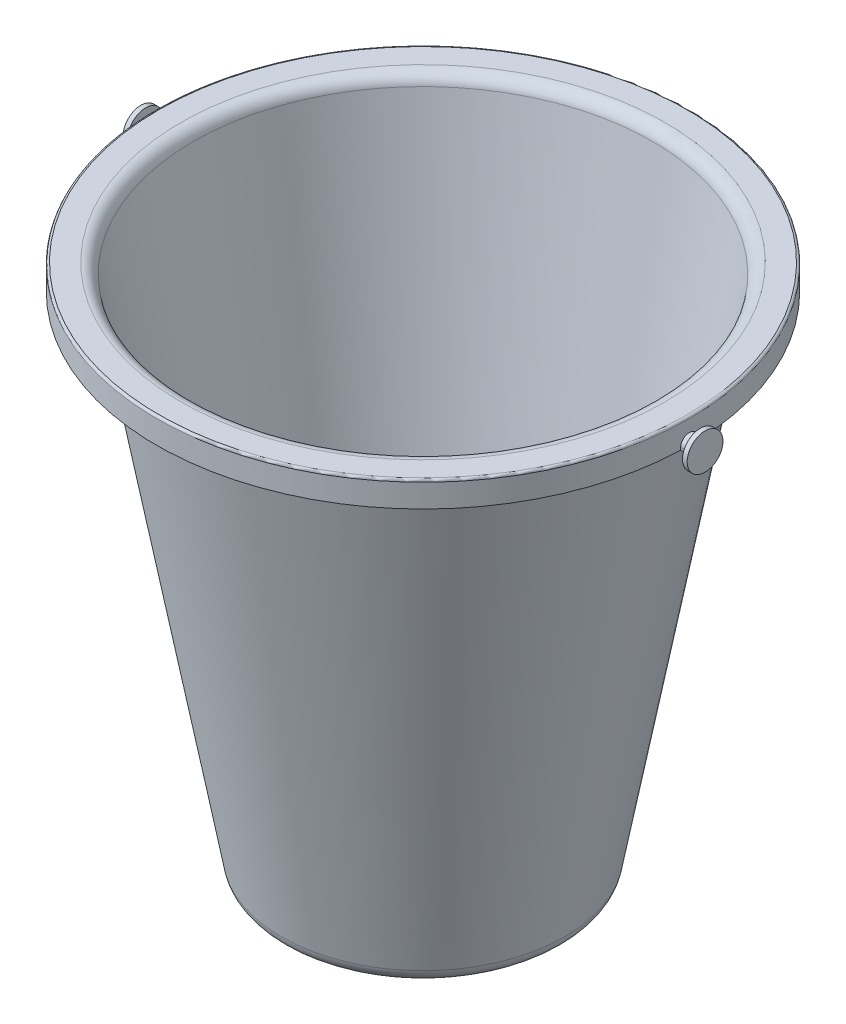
ISO-10303-21;
HEADER;
FILE_DESCRIPTION(('STEP AP214'),'2;1');
FILE_NAME('part.step','',(''),(''),'','','');
FILE_SCHEMA(('AUTOMOTIVE_DESIGN { 1 0 10303 214 1 1 1 1 }'));
ENDSEC;
DATA;
#1=APPLICATION_CONTEXT('core data for automotive mechanical design processes');
#2=APPLICATION_PROTOCOL_DEFINITION('international standard','automotive_design',2000,#1);
#3=PRODUCT_CONTEXT('',#1,'mechanical');
#4=PRODUCT('Part','Part','',(#3));
#5=PRODUCT_RELATED_PRODUCT_CATEGORY('part','',(#4));
#6=PRODUCT_DEFINITION_FORMATION('','',#4);
#7=PRODUCT_DEFINITION_CONTEXT('part definition',#1,'design');
#8=PRODUCT_DEFINITION('design','',#6,#7);
#9=PRODUCT_DEFINITION_SHAPE('','',#8);
#10=(LENGTH_UNIT() NAMED_UNIT(*) SI_UNIT(.MILLI.,.METRE.));
#11=(NAMED_UNIT(*) PLANE_ANGLE_UNIT() SI_UNIT($,.RADIAN.));
#12=(NAMED_UNIT(*) SI_UNIT($,.STERADIAN.) SOLID_ANGLE_UNIT());
#13=UNCERTAINTY_MEASURE_WITH_UNIT(LENGTH_MEASURE(1.E-05),#10,'distance_accuracy_value','');
#14=(GEOMETRIC_REPRESENTATION_CONTEXT(3) GLOBAL_UNCERTAINTY_ASSIGNED_CONTEXT((#13)) GLOBAL_UNIT_ASSIGNED_CONTEXT((#10,
#11,#12)) REPRESENTATION_CONTEXT('',''));
#15=CARTESIAN_POINT('',(0.,0.,0.));
#16=DIRECTION('',(0.,0.,1.));
#17=DIRECTION('',(1.,0.,0.));
#18=AXIS2_PLACEMENT_3D('',#15,#16,#17);
#19=CARTESIAN_POINT('',(0.,187.325,0.));
#20=DIRECTION('',(0.,1.,0.));
#21=DIRECTION('',(-1.,0.,0.));
#22=AXIS2_PLACEMENT_3D('',#19,#20,#21);
#23=CYLINDRICAL_SURFACE('',#22,94.45625);
#24=CARTESIAN_POINT('',(0.,186.53125,0.));
#25=DIRECTION('',(0.,-1.,0.));
#26=DIRECTION('',(1.,0.,0.));
#27=AXIS2_PLACEMENT_3D('',#24,#25,#26);
#28=CIRCLE('',#27,94.45625);
#29=CARTESIAN_POINT('',(94.45625,186.53125,0.));
#30=VERTEX_POINT('',#29);
#31=EDGE_CURVE('E628',#30,#30,#28,.T.);
#32=ORIENTED_EDGE('',*,*,#31,.T.);
#33=EDGE_LOOP('',(#32));
#34=FACE_BOUND('',#33,.T.);
#35=DIRECTION('',(0.,1.,0.));
#36=VECTOR('',#35,1.);
#37=CARTESIAN_POINT('',(-94.4070593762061,187.325,-3.04799999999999));
#38=LINE('',#37,#36);
#39=CARTESIAN_POINT('',(-94.407059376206,178.308,-3.048));
#40=VERTEX_POINT('',#39);
#41=CARTESIAN_POINT('',(-94.4070593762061,179.197,-3.048));
#42=VERTEX_POINT('',#41);
#43=EDGE_CURVE('E301',#40,#42,#38,.T.);
#44=ORIENTED_EDGE('',*,*,#43,.T.);
#45=CARTESIAN_POINT('',(-94.4070593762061,179.197,-3.048));
#46=CARTESIAN_POINT('',(-94.4070582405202,179.282703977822,-3.04800823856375));
#47=CARTESIAN_POINT('',(-94.4071760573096,179.368404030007,-3.04438528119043));
#48=CARTESIAN_POINT('',(-94.4076412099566,179.539190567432,-3.02994073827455));
#49=CARTESIAN_POINT('',(-94.4079885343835,179.624277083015,-3.01911951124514));
#50=CARTESIAN_POINT('',(-94.4089039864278,179.793178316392,-2.99035259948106));
#51=CARTESIAN_POINT('',(-94.4094719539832,179.876993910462,-2.97241207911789));
#52=CARTESIAN_POINT('',(-94.4108115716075,180.042794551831,-2.92955247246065));
#53=CARTESIAN_POINT('',(-94.4115832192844,180.124779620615,-2.90463346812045));
#54=CARTESIAN_POINT('',(-94.4141738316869,180.367194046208,-2.81961208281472));
#55=CARTESIAN_POINT('',(-94.4162688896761,180.524155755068,-2.74923280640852));
#56=CARTESIAN_POINT('',(-94.4209573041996,180.823918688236,-2.5831831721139));
#57=CARTESIAN_POINT('',(-94.4235505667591,180.966722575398,-2.48751758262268));
#58=CARTESIAN_POINT('',(-94.4289448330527,181.234320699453,-2.27353665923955));
#59=CARTESIAN_POINT('',(-94.4317459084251,181.359108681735,-2.1552134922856));
#60=CARTESIAN_POINT('',(-94.4372397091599,181.587065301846,-1.89928130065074));
#61=CARTESIAN_POINT('',(-94.4399324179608,181.690230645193,-1.76166934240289));
#62=CARTESIAN_POINT('',(-94.4449060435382,181.872014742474,-1.47104710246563));
#63=CARTESIAN_POINT('',(-94.4471868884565,181.950629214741,-1.31803414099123));
#64=CARTESIAN_POINT('',(-94.4510788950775,182.081045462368,-1.00098294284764));
#65=CARTESIAN_POINT('',(-94.4526901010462,182.132849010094,-0.83694543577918));
#66=CARTESIAN_POINT('',(-94.4550609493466,182.20816424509,-0.50255049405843));
#67=CARTESIAN_POINT('',(-94.4558208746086,182.23168533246,-0.332195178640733));
#68=CARTESIAN_POINT('',(-94.4564044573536,182.249796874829,0.0100517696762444));
#69=CARTESIAN_POINT('',(-94.4562280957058,182.244386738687,0.181943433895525));
#70=CARTESIAN_POINT('',(-94.4549591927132,182.204796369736,0.522310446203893));
#71=CARTESIAN_POINT('',(-94.4538670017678,182.170627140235,0.690787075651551));
#72=CARTESIAN_POINT('',(-94.4508899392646,182.074505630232,1.01961091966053));
#73=CARTESIAN_POINT('',(-94.44900506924,182.012553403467,1.17995814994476));
#74=CARTESIAN_POINT('',(-94.4446544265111,181.862610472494,1.48801084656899));
#75=CARTESIAN_POINT('',(-94.4421885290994,181.774614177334,1.63571358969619));
#76=CARTESIAN_POINT('',(-94.4369538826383,181.575089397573,1.91424670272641));
#77=CARTESIAN_POINT('',(-94.4341851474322,181.463561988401,2.04507784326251));
#78=CARTESIAN_POINT('',(-94.4286555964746,181.220096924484,2.28620861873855));
#79=CARTESIAN_POINT('',(-94.4258947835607,181.088152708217,2.39650162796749));
#80=CARTESIAN_POINT('',(-94.4206923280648,180.8075645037,2.59340744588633));
#81=CARTESIAN_POINT('',(-94.4182507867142,180.658915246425,2.68001275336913));
#82=CARTESIAN_POINT('',(-94.4139620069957,180.349113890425,2.82707973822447));
#83=CARTESIAN_POINT('',(-94.412115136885,180.18795412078,2.88752522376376));
#84=CARTESIAN_POINT('',(-94.4092290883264,179.857891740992,2.98040639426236));
#85=CARTESIAN_POINT('',(-94.4081886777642,179.689001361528,3.0128848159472));
#86=CARTESIAN_POINT('',(-94.4074253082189,179.465318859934,3.03664619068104));
#87=CARTESIAN_POINT('',(-94.4072881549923,179.411696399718,3.04090610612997));
#88=CARTESIAN_POINT('',(-94.4071053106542,179.304389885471,3.04657912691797));
#89=CARTESIAN_POINT('',(-94.4070594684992,179.250706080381,3.04799693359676));
#90=CARTESIAN_POINT('',(-94.4070593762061,179.197,3.048));
#91=B_SPLINE_CURVE_WITH_KNOTS('',3,(#45,#46,#47,#48,#49,#50,#51,#52,#53,#54,#55,#56,#57,#58,#59,
#60,#61,#62,#63,#64,#65,#66,#67,#68,#69,#70,#71,#72,#73,#74,#75,#76,#77,#78,#79,#80,#81,#82,#83,
#84,#85,#86,#87,#88,#89,#90),.UNSPECIFIED.,.F.,.F.,(4,2,2,2,2,2,2,2,2,2,2,2,2,2,2,2,2,2,2,2,2,2,
4),(0.,0.257028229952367,0.514043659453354,0.770872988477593,1.0276993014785,1.54113213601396,
2.05446821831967,2.56798209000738,3.08157414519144,3.59525572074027,4.10890333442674,
4.62238018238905,5.13586752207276,5.64915848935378,6.16244846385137,6.67584870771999,
7.18922549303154,7.70276761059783,8.21647216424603,8.73049422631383,9.24372940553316,
9.40505145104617,9.56610642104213),.UNSPECIFIED.);
#92=CARTESIAN_POINT('',(-94.407059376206,179.197,3.048));
#93=VERTEX_POINT('',#92);
#94=EDGE_CURVE('E336',#42,#93,#91,.T.);
#95=ORIENTED_EDGE('',*,*,#94,.T.);
#96=DIRECTION('',(0.,1.,0.));
#97=VECTOR('',#96,1.);
#98=CARTESIAN_POINT('',(-94.4070593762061,187.325,3.04799999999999));
#99=LINE('',#98,#97);
#100=CARTESIAN_POINT('',(-94.4070593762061,178.308,3.04799999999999));
#101=VERTEX_POINT('',#100);
#102=EDGE_CURVE('E313',#93,#101,#99,.F.);
#103=ORIENTED_EDGE('',*,*,#102,.T.);
#104=CARTESIAN_POINT('',(0.,178.308,0.));
#105=DIRECTION('',(0.,1.,0.));
#106=DIRECTION('',(-1.,0.,0.));
#107=AXIS2_PLACEMENT_3D('',#104,#105,#106);
#108=CIRCLE('',#107,94.45625);
#109=CARTESIAN_POINT('',(94.4070593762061,178.308,3.04799999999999));
#110=VERTEX_POINT('',#109);
#111=EDGE_CURVE('E680',#101,#110,#108,.T.);
#112=ORIENTED_EDGE('',*,*,#111,.T.);
#113=DIRECTION('',(0.,1.,0.));
#114=VECTOR('',#113,1.);
#115=CARTESIAN_POINT('',(94.4070593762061,187.325,3.04799999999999));
#116=LINE('',#115,#114);
#117=CARTESIAN_POINT('',(94.4070593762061,179.197,3.048));
#118=VERTEX_POINT('',#117);
#119=EDGE_CURVE('E749',#118,#110,#116,.F.);
#120=ORIENTED_EDGE('',*,*,#119,.F.);
#121=CARTESIAN_POINT('',(94.4070593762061,179.197,-3.048));
#122=CARTESIAN_POINT('',(94.4070582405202,179.282703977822,-3.04800823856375));
#123=CARTESIAN_POINT('',(94.4071760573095,179.368404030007,-3.04438528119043));
#124=CARTESIAN_POINT('',(94.4076412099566,179.539190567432,-3.02994073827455));
#125=CARTESIAN_POINT('',(94.4079885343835,179.624277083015,-3.01911951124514));
#126=CARTESIAN_POINT('',(94.4089039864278,179.793178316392,-2.99035259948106));
#127=CARTESIAN_POINT('',(94.4094719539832,179.876993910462,-2.97241207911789));
#128=CARTESIAN_POINT('',(94.4108115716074,180.042794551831,-2.92955247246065));
#129=CARTESIAN_POINT('',(94.4115832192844,180.124779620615,-2.90463346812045));
#130=CARTESIAN_POINT('',(94.4141738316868,180.367194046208,-2.81961208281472));
#131=CARTESIAN_POINT('',(94.4162688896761,180.524155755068,-2.74923280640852));
#132=CARTESIAN_POINT('',(94.4209573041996,180.823918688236,-2.5831831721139));
#133=CARTESIAN_POINT('',(94.4235505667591,180.966722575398,-2.48751758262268));
#134=CARTESIAN_POINT('',(94.4289448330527,181.234320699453,-2.27353665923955));
#135=CARTESIAN_POINT('',(94.4317459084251,181.359108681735,-2.1552134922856));
#136=CARTESIAN_POINT('',(94.4372397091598,181.587065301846,-1.89928130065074));
#137=CARTESIAN_POINT('',(94.4399324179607,181.690230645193,-1.76166934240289));
#138=CARTESIAN_POINT('',(94.4449060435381,181.872014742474,-1.47104710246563));
#139=CARTESIAN_POINT('',(94.4471868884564,181.950629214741,-1.31803414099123));
#140=CARTESIAN_POINT('',(94.4510788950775,182.081045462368,-1.00098294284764));
#141=CARTESIAN_POINT('',(94.4526901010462,182.132849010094,-0.83694543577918));
#142=CARTESIAN_POINT('',(94.4550609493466,182.20816424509,-0.50255049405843));
#143=CARTESIAN_POINT('',(94.4558208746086,182.23168533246,-0.332195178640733));
#144=CARTESIAN_POINT('',(94.4564044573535,182.249796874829,0.0100517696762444));
#145=CARTESIAN_POINT('',(94.4562280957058,182.244386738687,0.181943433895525));
#146=CARTESIAN_POINT('',(94.4549591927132,182.204796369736,0.522310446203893));
#147=CARTESIAN_POINT('',(94.4538670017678,182.170627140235,0.690787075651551));
#148=CARTESIAN_POINT('',(94.4508899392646,182.074505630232,1.01961091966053));
#149=CARTESIAN_POINT('',(94.44900506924,182.012553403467,1.17995814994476));
#150=CARTESIAN_POINT('',(94.4446544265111,181.862610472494,1.48801084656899));
#151=CARTESIAN_POINT('',(94.4421885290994,181.774614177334,1.63571358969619));
#152=CARTESIAN_POINT('',(94.4369538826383,181.575089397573,1.91424670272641));
#153=CARTESIAN_POINT('',(94.4341851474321,181.463561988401,2.04507784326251));
#154=CARTESIAN_POINT('',(94.4286555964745,181.220096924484,2.28620861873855));
#155=CARTESIAN_POINT('',(94.4258947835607,181.088152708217,2.39650162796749));
#156=CARTESIAN_POINT('',(94.4206923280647,180.8075645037,2.59340744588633));
#157=CARTESIAN_POINT('',(94.4182507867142,180.658915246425,2.68001275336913));
#158=CARTESIAN_POINT('',(94.4139620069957,180.349113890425,2.82707973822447));
#159=CARTESIAN_POINT('',(94.412115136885,180.18795412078,2.88752522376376));
#160=CARTESIAN_POINT('',(94.4092290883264,179.857891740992,2.98040639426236));
#161=CARTESIAN_POINT('',(94.4081886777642,179.689001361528,3.0128848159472));
#162=CARTESIAN_POINT('',(94.4074253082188,179.465318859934,3.03664619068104));
#163=CARTESIAN_POINT('',(94.4072881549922,179.411696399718,3.04090610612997));
#164=CARTESIAN_POINT('',(94.4071053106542,179.304389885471,3.04657912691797));
#165=CARTESIAN_POINT('',(94.4070594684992,179.250706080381,3.04799693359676));
#166=CARTESIAN_POINT('',(94.407059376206,179.197,3.048));
#167=B_SPLINE_CURVE_WITH_KNOTS('',3,(#121,#122,#123,#124,#125,#126,#127,#128,#129,#130,#131,
#132,#133,#134,#135,#136,#137,#138,#139,#140,#141,#142,#143,#144,#145,#146,#147,#148,#149,#150,
#151,#152,#153,#154,#155,#156,#157,#158,#159,#160,#161,#162,#163,#164,#165,#166),.UNSPECIFIED.,
.F.,.F.,(4,2,2,2,2,2,2,2,2,2,2,2,2,2,2,2,2,2,2,2,2,2,4),(0.,0.257028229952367,0.514043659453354,
0.770872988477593,1.0276993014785,1.54113213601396,2.05446821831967,2.56798209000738,
3.08157414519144,3.59525572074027,4.10890333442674,4.62238018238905,5.13586752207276,
5.64915848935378,6.16244846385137,6.67584870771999,7.18922549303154,7.70276761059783,
8.21647216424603,8.73049422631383,9.24372940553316,9.40505145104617,9.56610642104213),.UNSPECIFIED.);
#168=CARTESIAN_POINT('',(94.407059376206,179.197,-3.048));
#169=VERTEX_POINT('',#168);
#170=EDGE_CURVE('E743',#169,#118,#167,.T.);
#171=ORIENTED_EDGE('',*,*,#170,.F.);
#172=DIRECTION('',(0.,1.,0.));
#173=VECTOR('',#172,1.);
#174=CARTESIAN_POINT('',(94.4070593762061,187.325,-3.04799999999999));
#175=LINE('',#174,#173);
#176=CARTESIAN_POINT('',(94.4070593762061,178.308,-3.04799999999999));
#177=VERTEX_POINT('',#176);
#178=EDGE_CURVE('E698',#177,#169,#175,.T.);
#179=ORIENTED_EDGE('',*,*,#178,.F.);
#180=EDGE_CURVE('E684',#177,#40,#108,.T.);
#181=ORIENTED_EDGE('',*,*,#180,.T.);
#182=EDGE_LOOP('',(#44,#95,#103,#112,#120,#171,#179,#181));
#183=FACE_BOUND('',#182,.T.);
#184=ADVANCED_FACE('F36',(#34,#183),#23,.T.);
#185=DIRECTION('',(0.,1.,0.));
#186=VECTOR('',#185,1.);
#187=CARTESIAN_POINT('',(-94.4395143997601,187.325,1.77799999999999));
#188=LINE('',#187,#186);
#189=CARTESIAN_POINT('',(-94.4395143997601,178.308,1.77799999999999));
#190=VERTEX_POINT('',#189);
#191=CARTESIAN_POINT('',(-94.4395143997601,179.197,1.77799999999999));
#192=VERTEX_POINT('',#191);
#193=EDGE_CURVE('E308',#190,#192,#188,.T.);
#194=ORIENTED_EDGE('',*,*,#193,.T.);
#195=CARTESIAN_POINT('',(-94.4395143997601,179.197,1.77799999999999));
#196=CARTESIAN_POINT('',(-94.439514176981,179.247017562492,1.77799967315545));
#197=CARTESIAN_POINT('',(-94.4395541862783,179.297011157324,1.77588808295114));
#198=CARTESIAN_POINT('',(-94.439712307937,179.396640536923,1.76746412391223));
#199=CARTESIAN_POINT('',(-94.4398304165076,179.446276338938,1.76115195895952));
#200=CARTESIAN_POINT('',(-94.4402978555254,179.594031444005,1.7359738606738));
#201=CARTESIAN_POINT('',(-94.4407603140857,179.691160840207,1.71086616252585));
#202=CARTESIAN_POINT('',(-94.441935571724,179.879820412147,1.64470400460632));
#203=CARTESIAN_POINT('',(-94.4426484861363,179.971347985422,1.60364219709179));
#204=CARTESIAN_POINT('',(-94.4442440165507,180.146206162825,1.50674316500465));
#205=CARTESIAN_POINT('',(-94.445126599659,180.229538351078,1.45090880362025));
#206=CARTESIAN_POINT('',(-94.4469622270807,180.385655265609,1.326038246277));
#207=CARTESIAN_POINT('',(-94.4479152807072,180.458438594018,1.25700030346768));
#208=CARTESIAN_POINT('',(-94.449784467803,180.591394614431,1.10767429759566));
#209=CARTESIAN_POINT('',(-94.450700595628,180.651565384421,1.02738452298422));
#210=CARTESIAN_POINT('',(-94.4523925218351,180.757574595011,0.857838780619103));
#211=CARTESIAN_POINT('',(-94.4531683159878,180.803412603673,0.768582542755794));
#212=CARTESIAN_POINT('',(-94.4544920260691,180.879449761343,0.583645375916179));
#213=CARTESIAN_POINT('',(-94.4550399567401,180.909649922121,0.487964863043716));
#214=CARTESIAN_POINT('',(-94.455846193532,180.953555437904,0.292900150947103));
#215=CARTESIAN_POINT('',(-94.4561045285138,180.967262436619,0.193516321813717));
#216=CARTESIAN_POINT('',(-94.4563025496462,180.977797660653,-0.0061445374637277));
#217=CARTESIAN_POINT('',(-94.456242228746,180.974625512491,-0.106421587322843));
#218=CARTESIAN_POINT('',(-94.4558097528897,180.951493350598,-0.305005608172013));
#219=CARTESIAN_POINT('',(-94.4554376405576,180.931535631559,-0.403312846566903));
#220=CARTESIAN_POINT('',(-94.4544235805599,180.875402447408,-0.595180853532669));
#221=CARTESIAN_POINT('',(-94.4537816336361,180.839227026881,-0.68874163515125));
#222=CARTESIAN_POINT('',(-94.4523001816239,180.751681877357,-0.868470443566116));
#223=CARTESIAN_POINT('',(-94.4514606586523,180.700310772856,-0.954637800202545));
#224=CARTESIAN_POINT('',(-94.4496787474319,180.583836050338,-1.11712167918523));
#225=CARTESIAN_POINT('',(-94.4487363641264,180.518733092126,-1.19343867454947));
#226=CARTESIAN_POINT('',(-94.4468548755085,180.376640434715,-1.3340633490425));
#227=CARTESIAN_POINT('',(-94.4459157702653,180.299650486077,-1.39837077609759));
#228=CARTESIAN_POINT('',(-94.444146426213,180.135936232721,-1.51316827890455));
#229=CARTESIAN_POINT('',(-94.4433162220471,180.049208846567,-1.56365396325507));
#230=CARTESIAN_POINT('',(-94.4418582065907,179.86847047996,-1.64937223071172));
#231=CARTESIAN_POINT('',(-94.4412305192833,179.774455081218,-1.68459547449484));
#232=CARTESIAN_POINT('',(-94.4402499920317,179.581916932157,-1.73870354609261));
#233=CARTESIAN_POINT('',(-94.439896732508,179.483401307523,-1.75761332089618));
#234=CARTESIAN_POINT('',(-94.4396380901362,179.35302495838,-1.77141879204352));
#235=CARTESIAN_POINT('',(-94.4395917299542,179.32184364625,-1.7738880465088));
#236=CARTESIAN_POINT('',(-94.4395299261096,179.259445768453,-1.7771763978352));
#237=CARTESIAN_POINT('',(-94.4395144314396,179.228229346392,-1.7779982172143));
#238=CARTESIAN_POINT('',(-94.4395143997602,179.197,-1.77799999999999));
#239=B_SPLINE_CURVE_WITH_KNOTS('',3,(#195,#196,#197,#198,#199,#200,#201,#202,#203,#204,#205,
#206,#207,#208,#209,#210,#211,#212,#213,#214,#215,#216,#217,#218,#219,#220,#221,#222,#223,#224,
#225,#226,#227,#228,#229,#230,#231,#232,#233,#234,#235,#236,#237,#238),.UNSPECIFIED.,.F.,.F.,(4,
2,2,2,2,2,2,2,2,2,2,2,2,2,2,2,2,2,2,2,2,4),(0.,0.149960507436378,0.299913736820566,
0.599339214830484,0.898902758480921,1.19840828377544,1.49795346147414,1.79754425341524,
2.0971440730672,2.396724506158,2.69627508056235,2.99583228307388,3.29534854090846,
3.59486397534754,3.89440653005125,4.19393469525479,4.49346914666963,4.79309865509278,
5.09291125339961,5.39226455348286,5.48607108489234,5.57972246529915),.UNSPECIFIED.);
#240=CARTESIAN_POINT('',(-94.451447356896,180.698341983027,0.9525));
#241=VERTEX_POINT('',#240);
#242=EDGE_CURVE('E307',#192,#241,#239,.T.);
#243=ORIENTED_EDGE('',*,*,#242,.T.);
#244=DIRECTION('',(0.,1.,0.));
#245=VECTOR('',#244,1.);
#246=CARTESIAN_POINT('',(-94.451447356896,187.325,0.9525));
#247=LINE('',#246,#245);
#248=CARTESIAN_POINT('',(-94.451447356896,178.308,0.9525));
#249=VERTEX_POINT('',#248);
#250=EDGE_CURVE('E478',#241,#249,#247,.F.);
#251=ORIENTED_EDGE('',*,*,#250,.T.);
#252=EDGE_CURVE('E675',#249,#190,#108,.T.);
#253=ORIENTED_EDGE('',*,*,#252,.T.);
#254=EDGE_LOOP('',(#194,#243,#251,#253));
#255=FACE_BOUND('',#254,.T.);
#256=ADVANCED_FACE('F363',(#255),#23,.T.);
#257=CARTESIAN_POINT('',(-94.451447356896,180.698341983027,-0.9525));
#258=VERTEX_POINT('',#257);
#259=CARTESIAN_POINT('',(-94.4395143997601,179.197,-1.77799999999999));
#260=VERTEX_POINT('',#259);
#261=EDGE_CURVE('E287',#258,#260,#239,.T.);
#262=ORIENTED_EDGE('',*,*,#261,.T.);
#263=DIRECTION('',(0.,1.,0.));
#264=VECTOR('',#263,1.);
#265=CARTESIAN_POINT('',(-94.4395143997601,187.325,-1.77799999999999));
#266=LINE('',#265,#264);
#267=CARTESIAN_POINT('',(-94.4395143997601,178.308,-1.77799999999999));
#268=VERTEX_POINT('',#267);
#269=EDGE_CURVE('E292',#260,#268,#266,.F.);
#270=ORIENTED_EDGE('',*,*,#269,.T.);
#271=CARTESIAN_POINT('',(-94.451447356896,178.308,-0.9525));
#272=VERTEX_POINT('',#271);
#273=EDGE_CURVE('E679',#268,#272,#108,.T.);
#274=ORIENTED_EDGE('',*,*,#273,.T.);
#275=DIRECTION('',(0.,1.,0.));
#276=VECTOR('',#275,1.);
#277=CARTESIAN_POINT('',(-94.451447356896,187.325,-0.9525));
#278=LINE('',#277,#276);
#279=EDGE_CURVE('E306',#258,#272,#278,.F.);
#280=ORIENTED_EDGE('',*,*,#279,.F.);
#281=EDGE_LOOP('',(#262,#270,#274,#280));
#282=FACE_BOUND('',#281,.T.);
#283=ADVANCED_FACE('F304',(#282),#23,.T.);
#284=CARTESIAN_POINT('',(0.,0.,-0.9525));
#285=DIRECTION('',(0.,0.,1.));
#286=DIRECTION('',(-1.,0.,0.));
#287=AXIS2_PLACEMENT_3D('',#284,#285,#286);
#288=PLANE('',#287);
#289=DIRECTION('',(-1.,0.,0.));
#290=VECTOR('',#289,1.);
#291=CARTESIAN_POINT('',(100.0135,180.698341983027,-0.9525));
#292=LINE('',#291,#290);
#293=CARTESIAN_POINT('',(-98.3615,180.698341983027,-0.9525));
#294=VERTEX_POINT('',#293);
#295=EDGE_CURVE('E819',#258,#294,#292,.T.);
#296=ORIENTED_EDGE('',*,*,#295,.F.);
#297=ORIENTED_EDGE('',*,*,#279,.T.);
#298=DIRECTION('',(1.,0.,0.));
#299=VECTOR('',#298,1.);
#300=CARTESIAN_POINT('',(93.18625,178.308,-0.9525));
#301=LINE('',#300,#299);
#302=CARTESIAN_POINT('',(-93.1813819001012,178.308,-0.9525));
#303=VERTEX_POINT('',#302);
#304=EDGE_CURVE('E1377',#272,#303,#301,.T.);
#305=ORIENTED_EDGE('',*,*,#304,.T.);
#306=DIRECTION('',(0.,1.,0.));
#307=VECTOR('',#306,1.);
#308=CARTESIAN_POINT('',(-93.1813819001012,187.325,-0.9525));
#309=LINE('',#308,#307);
#310=CARTESIAN_POINT('',(-93.1813819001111,185.658124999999,-0.9525));
#311=VERTEX_POINT('',#310);
#312=EDGE_CURVE('E485',#303,#311,#309,.T.);
#313=ORIENTED_EDGE('',*,*,#312,.T.);
#314=CARTESIAN_POINT('',(-93.0717371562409,185.931995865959,-0.9525));
#315=CARTESIAN_POINT('',(-93.056351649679,185.948129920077,-0.9525));
#316=CARTESIAN_POINT('',(-93.0395923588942,185.962976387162,-0.9525));
#317=CARTESIAN_POINT('',(-93.0038048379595,185.989656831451,-0.9525));
#318=CARTESIAN_POINT('',(-92.9847738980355,186.001487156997,-0.9525));
#319=CARTESIAN_POINT('',(-92.9450030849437,186.021779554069,-0.9525));
#320=CARTESIAN_POINT('',(-92.9242640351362,186.030243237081,-0.9525));
#321=CARTESIAN_POINT('',(-92.8816650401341,186.043566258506,-0.9525));
#322=CARTESIAN_POINT('',(-92.8598053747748,186.048426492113,-0.9525));
#323=CARTESIAN_POINT('',(-92.8155772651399,186.054409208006,-0.9525));
#324=CARTESIAN_POINT('',(-92.7932087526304,186.055531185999,-0.9525));
#325=CARTESIAN_POINT('',(-92.7485999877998,186.054003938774,-0.9525));
#326=CARTESIAN_POINT('',(-92.7263597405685,186.051354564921,-0.9525));
#327=CARTESIAN_POINT('',(-92.6826397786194,186.042359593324,-0.9525));
#328=CARTESIAN_POINT('',(-92.6611600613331,186.036014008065,-0.9525));
#329=CARTESIAN_POINT('',(-92.6195709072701,186.019806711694,-0.9525));
#330=CARTESIAN_POINT('',(-92.5994614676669,186.009945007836,-0.9525));
#331=CARTESIAN_POINT('',(-92.5611840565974,185.986985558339,-0.9525));
#332=CARTESIAN_POINT('',(-92.5430160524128,185.973887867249,-0.9525));
#333=CARTESIAN_POINT('',(-92.5091369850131,185.944828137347,-0.9525));
#334=CARTESIAN_POINT('',(-92.4934259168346,185.928866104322,-0.9525));
#335=CARTESIAN_POINT('',(-92.4649074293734,185.894531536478,-0.9525));
#336=CARTESIAN_POINT('',(-92.4520998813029,185.876159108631,-0.9525));
#337=CARTESIAN_POINT('',(-92.4297512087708,185.837524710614,-0.9525));
#338=CARTESIAN_POINT('',(-92.4202100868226,185.817262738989,-0.9525));
#339=CARTESIAN_POINT('',(-92.4046656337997,185.775425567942,-0.9525));
#340=CARTESIAN_POINT('',(-92.3986621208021,185.753850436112,-0.9525));
#341=CARTESIAN_POINT('',(-92.390362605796,185.709998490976,-0.9525));
#342=CARTESIAN_POINT('',(-92.3880666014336,185.687721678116,-0.9525));
#343=CARTESIAN_POINT('',(-92.3872473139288,185.643099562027,-0.9525));
#344=CARTESIAN_POINT('',(-92.3887238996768,185.620754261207,-0.9525));
#345=CARTESIAN_POINT('',(-92.3954075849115,185.576628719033,-0.9525));
#346=CARTESIAN_POINT('',(-92.4006146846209,185.554848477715,-0.9525));
#347=CARTESIAN_POINT('',(-92.4146115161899,185.51247139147,-0.9525));
#348=CARTESIAN_POINT('',(-92.4234012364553,185.491874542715,-0.9525));
#349=CARTESIAN_POINT('',(-92.4443137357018,185.452448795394,-0.9525));
#350=CARTESIAN_POINT('',(-92.45643651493,185.433619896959,-0.9525));
#351=CARTESIAN_POINT('',(-92.4836713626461,185.398263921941,-0.9525));
#352=CARTESIAN_POINT('',(-92.4987835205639,185.381736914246,-0.9525));
#353=CARTESIAN_POINT('',(-92.5315678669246,185.351454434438,-0.9525));
#354=CARTESIAN_POINT('',(-92.5492400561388,185.337698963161,-0.9525));
#355=CARTESIAN_POINT('',(-92.58664374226,185.313349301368,-0.9525));
#356=CARTESIAN_POINT('',(-92.6063753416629,185.302755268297,-0.9525));
#357=CARTESIAN_POINT('',(-92.6473370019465,185.285030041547,-0.9525));
#358=CARTESIAN_POINT('',(-92.6685670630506,185.277898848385,-0.9525));
#359=CARTESIAN_POINT('',(-92.7119240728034,185.267301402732,-0.9525));
#360=CARTESIAN_POINT('',(-92.7340510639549,185.263835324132,-0.9525));
#361=CARTESIAN_POINT('',(-92.7785729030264,185.260667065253,-0.9525));
#362=CARTESIAN_POINT('',(-92.8009677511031,185.260964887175,-0.9525));
#363=CARTESIAN_POINT('',(-92.8453901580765,185.265316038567,-0.9525));
#364=CARTESIAN_POINT('',(-92.8674177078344,185.269369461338,-0.9525));
#365=CARTESIAN_POINT('',(-92.9104796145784,185.281116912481,-0.9525));
#366=CARTESIAN_POINT('',(-92.9315139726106,185.288810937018,-0.9525));
#367=CARTESIAN_POINT('',(-92.9719921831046,185.30762114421,-0.9525));
#368=CARTESIAN_POINT('',(-92.9914360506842,185.318737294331,-0.9525));
#369=CARTESIAN_POINT('',(-93.0281815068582,185.344076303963,-0.9525));
#370=CARTESIAN_POINT('',(-93.0454830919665,185.358299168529,-0.9525));
#371=CARTESIAN_POINT('',(-93.0774520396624,185.38944724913,-0.9525));
#372=CARTESIAN_POINT('',(-93.0921195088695,185.406372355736,-0.9525));
#373=CARTESIAN_POINT('',(-93.1184046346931,185.442444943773,-0.9525));
#374=CARTESIAN_POINT('',(-93.130022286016,185.461592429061,-0.9525));
#375=CARTESIAN_POINT('',(-93.1498775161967,185.501565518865,-0.9525));
#376=CARTESIAN_POINT('',(-93.1581152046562,185.52239106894,-0.9525));
#377=CARTESIAN_POINT('',(-93.1709768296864,185.565128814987,-0.9525));
#378=CARTESIAN_POINT('',(-93.1756009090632,185.587040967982,-0.9525));
#379=CARTESIAN_POINT('',(-93.1811042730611,185.631327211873,-0.9525));
#380=CARTESIAN_POINT('',(-93.1819841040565,185.653701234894,-0.9525));
#381=CARTESIAN_POINT('',(-93.179974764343,185.698285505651,-0.9525));
#382=CARTESIAN_POINT('',(-93.1770846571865,185.720495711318,-0.9525));
#383=CARTESIAN_POINT('',(-93.1676154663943,185.764123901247,-0.9525));
#384=CARTESIAN_POINT('',(-93.1610346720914,185.785541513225,-0.9525));
#385=CARTESIAN_POINT('',(-93.1443733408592,185.826948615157,-0.9525));
#386=CARTESIAN_POINT('',(-93.1342970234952,185.846939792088,-0.9525));
#387=CARTESIAN_POINT('',(-93.1153326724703,185.877798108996,-0.9525));
#388=CARTESIAN_POINT('',(-93.1074170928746,185.889274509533,-0.9525));
#389=CARTESIAN_POINT('',(-93.0904254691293,185.911333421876,-0.9525));
#390=CARTESIAN_POINT('',(-93.081349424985,185.921915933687,-0.9525));
#391=CARTESIAN_POINT('',(-93.0717371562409,185.931995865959,-0.9525));
#392=B_SPLINE_CURVE_WITH_KNOTS('',3,(#314,#315,#316,#317,#318,#319,#320,#321,#322,#323,#324,
#325,#326,#327,#328,#329,#330,#331,#332,#333,#334,#335,#336,#337,#338,#339,#340,#341,#342,#343,
#344,#345,#346,#347,#348,#349,#350,#351,#352,#353,#354,#355,#356,#357,#358,#359,#360,#361,#362,
#363,#364,#365,#366,#367,#368,#369,#370,#371,#372,#373,#374,#375,#376,#377,#378,#379,#380,#381,
#382,#383,#384,#385,#386,#387,#388,#389,#390,#391),.UNSPECIFIED.,.T.,.F.,(4,2,2,2,2,2,2,2,2,2,2,
2,2,2,2,2,2,2,2,2,2,2,2,2,2,2,2,2,2,2,2,2,2,2,2,2,2,2,4),(0.,0.0668310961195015,
0.133742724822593,0.200622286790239,0.267485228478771,0.334357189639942,0.401231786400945,
0.468106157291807,0.534980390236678,0.601853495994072,0.668726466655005,0.735596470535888,
0.802466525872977,0.869333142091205,0.936199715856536,1.00306396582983,1.0699282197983,
1.13679225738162,1.20365629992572,1.27052234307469,1.33738840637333,1.40425779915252,
1.47112720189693,1.53799977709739,1.60487239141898,1.67174666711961,1.73862087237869,
1.80549444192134,1.87236812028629,1.93923909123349,2.00611017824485,2.07297909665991,
2.1398453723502,2.20670189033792,2.27357501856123,2.34047916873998,2.40730283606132,
2.4490563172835,2.49080979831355),.UNSPECIFIED.);
#393=CARTESIAN_POINT('',(-92.7844860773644,186.055,-0.9525));
#394=VERTEX_POINT('',#393);
#395=EDGE_CURVE('E427',#311,#394,#392,.T.);
#396=ORIENTED_EDGE('',*,*,#395,.T.);
#397=DIRECTION('',(1.,0.,0.));
#398=VECTOR('',#397,1.);
#399=CARTESIAN_POINT('',(-83.1701878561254,186.055,-0.9525));
#400=LINE('',#399,#398);
#401=CARTESIAN_POINT('',(-85.812867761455,186.055,-0.9525));
#402=VERTEX_POINT('',#401);
#403=EDGE_CURVE('E651',#394,#402,#400,.T.);
#404=ORIENTED_EDGE('',*,*,#403,.T.);
#405=CARTESIAN_POINT('',(-85.0522988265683,185.962569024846,-0.9525));
#406=CARTESIAN_POINT('',(-84.8791365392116,185.919841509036,-0.9525));
#407=CARTESIAN_POINT('',(-84.7094562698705,185.862459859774,-0.9525));
#408=CARTESIAN_POINT('',(-84.3819979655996,185.719972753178,-0.9525));
#409=CARTESIAN_POINT('',(-84.224234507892,185.634833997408,-0.9525));
#410=CARTESIAN_POINT('',(-83.9253052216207,185.439305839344,-0.9525));
#411=CARTESIAN_POINT('',(-83.784131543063,185.328928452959,-0.9525));
#412=CARTESIAN_POINT('',(-83.5223597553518,185.086067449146,-0.9525));
#413=CARTESIAN_POINT('',(-83.4017565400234,184.953589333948,-0.9525));
#414=CARTESIAN_POINT('',(-83.1844935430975,184.670257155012,-0.9525));
#415=CARTESIAN_POINT('',(-83.0878352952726,184.519401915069,-0.9525));
#416=CARTESIAN_POINT('',(-82.9212155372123,184.20359839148,-0.9525));
#417=CARTESIAN_POINT('',(-82.851255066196,184.038649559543,-0.9525));
#418=CARTESIAN_POINT('',(-82.7400273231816,183.699360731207,-0.9525));
#419=CARTESIAN_POINT('',(-82.6987577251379,183.525021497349,-0.9525));
#420=CARTESIAN_POINT('',(-82.6460747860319,183.171889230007,-0.9525));
#421=CARTESIAN_POINT('',(-82.6346613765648,182.99309620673,-0.9525));
#422=CARTESIAN_POINT('',(-82.6420146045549,182.636138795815,-0.9525));
#423=CARTESIAN_POINT('',(-82.6607800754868,182.457974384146,-0.9525));
#424=CARTESIAN_POINT('',(-82.7279558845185,182.107325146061,-0.9525));
#425=CARTESIAN_POINT('',(-82.7763661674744,181.93484030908,-0.9525));
#426=CARTESIAN_POINT('',(-82.9014569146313,181.600445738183,-0.9525));
#427=CARTESIAN_POINT('',(-82.9781374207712,181.438536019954,-0.9525));
#428=CARTESIAN_POINT('',(-83.1575913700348,181.129887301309,-0.9525));
#429=CARTESIAN_POINT('',(-83.2603648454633,180.983148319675,-0.9525));
#430=CARTESIAN_POINT('',(-83.4890916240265,180.708999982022,-0.9525));
#431=CARTESIAN_POINT('',(-83.6150458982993,180.581591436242,-0.9525));
#432=CARTESIAN_POINT('',(-83.886555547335,180.349727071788,-0.9525));
#433=CARTESIAN_POINT('',(-84.0321109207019,180.245271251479,-0.9525));
#434=CARTESIAN_POINT('',(-84.3387007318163,180.062270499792,-0.9525));
#435=CARTESIAN_POINT('',(-84.4997361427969,179.983727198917,-0.9525));
#436=CARTESIAN_POINT('',(-84.8327071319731,179.854789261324,-0.9525));
#437=CARTESIAN_POINT('',(-85.0046427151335,179.804394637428,-0.9525));
#438=CARTESIAN_POINT('',(-85.3545432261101,179.733182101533,-0.9525));
#439=CARTESIAN_POINT('',(-85.5325084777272,179.712365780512,-0.9525));
#440=CARTESIAN_POINT('',(-85.8894078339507,179.700905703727,-0.9525));
#441=CARTESIAN_POINT('',(-86.0683419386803,179.710261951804,-0.9525));
#442=CARTESIAN_POINT('',(-86.4221035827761,179.758882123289,-0.9525));
#443=CARTESIAN_POINT('',(-86.5969310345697,179.798146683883,-0.9525));
#444=CARTESIAN_POINT('',(-86.9375123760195,179.9054700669,-0.9525));
#445=CARTESIAN_POINT('',(-87.1032662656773,179.973528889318,-0.9525));
#446=CARTESIAN_POINT('',(-87.4209917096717,180.136507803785,-0.9525));
#447=CARTESIAN_POINT('',(-87.5729635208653,180.231427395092,-0.9525));
#448=CARTESIAN_POINT('',(-87.8588134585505,180.445434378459,-0.9525));
#449=CARTESIAN_POINT('',(-87.9926915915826,180.564521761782,-0.9525));
#450=CARTESIAN_POINT('',(-88.2385467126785,180.823477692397,-0.9525));
#451=CARTESIAN_POINT('',(-88.3505247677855,180.963345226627,-0.9525));
#452=CARTESIAN_POINT('',(-88.5494082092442,181.259895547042,-0.9525));
#453=CARTESIAN_POINT('',(-88.6363135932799,181.41657833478,-0.9525));
#454=CARTESIAN_POINT('',(-88.7825795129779,181.74230180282,-0.9525));
#455=CARTESIAN_POINT('',(-88.8419416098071,181.91134178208,-0.9525));
#456=CARTESIAN_POINT('',(-88.9314424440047,182.256988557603,-0.9525));
#457=CARTESIAN_POINT('',(-88.9615812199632,182.433595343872,-0.9525));
#458=CARTESIAN_POINT('',(-88.9917789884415,182.789354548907,-0.9525));
#459=CARTESIAN_POINT('',(-88.9918392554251,182.968506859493,-0.9525));
#460=CARTESIAN_POINT('',(-88.9618814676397,183.324279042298,-0.9525));
#461=CARTESIAN_POINT('',(-88.9318633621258,183.500898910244,-0.9525));
#462=CARTESIAN_POINT('',(-88.8426017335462,183.84658997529,-0.9525));
#463=CARTESIAN_POINT('',(-88.7833585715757,184.01566126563,-0.9525));
#464=CARTESIAN_POINT('',(-88.6373290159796,184.341458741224,-0.9525));
#465=CARTESIAN_POINT('',(-88.550542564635,184.498184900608,-0.9525));
#466=CARTESIAN_POINT('',(-88.351886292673,184.794849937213,-0.9525));
#467=CARTESIAN_POINT('',(-88.240015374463,184.934788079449,-0.9525));
#468=CARTESIAN_POINT('',(-87.9943729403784,185.193892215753,-0.9525));
#469=CARTESIAN_POINT('',(-87.860602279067,185.313059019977,-0.9525));
#470=CARTESIAN_POINT('',(-87.5749639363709,185.52724011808,-0.9525));
#471=CARTESIAN_POINT('',(-87.4230972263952,185.622255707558,-0.9525));
#472=CARTESIAN_POINT('',(-87.1055252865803,185.785466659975,-0.9525));
#473=CARTESIAN_POINT('',(-86.9398166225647,185.85365534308,-0.9525));
#474=CARTESIAN_POINT('',(-86.5992300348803,185.961275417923,-0.9525));
#475=CARTESIAN_POINT('',(-86.4243472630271,186.00069143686,-0.9525));
#476=CARTESIAN_POINT('',(-86.0705907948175,186.049545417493,-0.9525));
#477=CARTESIAN_POINT('',(-85.8917221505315,186.059019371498,-0.9525));
#478=CARTESIAN_POINT('',(-85.6020411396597,186.049958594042,-0.9525));
#479=CARTESIAN_POINT('',(-85.4908626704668,186.040595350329,-0.9525));
#480=CARTESIAN_POINT('',(-85.2701023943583,186.01025233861,-0.9525));
#481=CARTESIAN_POINT('',(-85.1605205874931,185.98927257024,-0.9525));
#482=CARTESIAN_POINT('',(-85.0522988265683,185.962569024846,-0.9525));
#483=B_SPLINE_CURVE_WITH_KNOTS('',3,(#405,#406,#407,#408,#409,#410,#411,#412,#413,#414,#415,
#416,#417,#418,#419,#420,#421,#422,#423,#424,#425,#426,#427,#428,#429,#430,#431,#432,#433,#434,
#435,#436,#437,#438,#439,#440,#441,#442,#443,#444,#445,#446,#447,#448,#449,#450,#451,#452,#453,
#454,#455,#456,#457,#458,#459,#460,#461,#462,#463,#464,#465,#466,#467,#468,#469,#470,#471,#472,
#473,#474,#475,#476,#477,#478,#479,#480,#481,#482),.UNSPECIFIED.,.T.,.F.,(4,2,2,2,2,2,2,2,2,2,2,
2,2,2,2,2,2,2,2,2,2,2,2,2,2,2,2,2,2,2,2,2,2,2,2,2,2,2,4),(0.,0.534660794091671,1.06996536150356,
1.60501560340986,2.13993283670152,2.67488432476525,3.20985663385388,3.74478556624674,
4.27971327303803,4.8146203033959,5.34952633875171,5.88443316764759,6.41934065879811,
6.95427056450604,7.48920043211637,8.02416395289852,8.55912771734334,9.09412025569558,
9.62911286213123,10.1641168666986,10.6991208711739,11.2341149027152,11.769108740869,
12.3040765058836,12.839044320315,13.3739818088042,13.9089185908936,14.4438327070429,
14.9787477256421,15.5136561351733,16.0485656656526,16.5834986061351,17.1184106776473,
17.653294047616,18.1883105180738,18.7236126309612,19.2582710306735,19.5924196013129,
19.9265681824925),.UNSPECIFIED.);
#484=CARTESIAN_POINT('',(-82.6892644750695,183.450065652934,-0.9525));
#485=VERTEX_POINT('',#484);
#486=EDGE_CURVE('E435',#402,#485,#483,.T.);
#487=ORIENTED_EDGE('',*,*,#486,.T.);
#488=CARTESIAN_POINT('',(-83.9965053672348,190.612002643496,-0.9525));
#489=CARTESIAN_POINT('',(-83.2137104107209,186.323325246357,-0.9525));
#490=CARTESIAN_POINT('',(-82.4309139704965,182.034648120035,-0.9525));
#491=CARTESIAN_POINT('',(-80.8653181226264,173.457294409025,-0.9525));
#492=CARTESIAN_POINT('',(-80.0825187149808,169.168617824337,-0.9525));
#493=CARTESIAN_POINT('',(-79.2997178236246,164.879941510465,-0.9525));
#494=B_SPLINE_CURVE_WITH_KNOTS('',3,(#488,#489,#490,#491,#492,#493),.UNSPECIFIED.,.F.,.F.,(4,2,
4),(0.,13.0785968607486,26.1571937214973),.UNSPECIFIED.);
#495=CARTESIAN_POINT('',(-81.4960063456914,176.912615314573,-0.9525));
#496=VERTEX_POINT('',#495);
#497=EDGE_CURVE('E439',#485,#496,#494,.T.);
#498=ORIENTED_EDGE('',*,*,#497,.T.);
#499=DIRECTION('',(-0.95611536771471,-0.292990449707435,0.));
#500=VECTOR('',#499,1.);
#501=CARTESIAN_POINT('',(-81.5012775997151,176.911,-0.9525));
#502=LINE('',#501,#500);
#503=CARTESIAN_POINT('',(-81.5012775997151,176.911,-0.9525));
#504=VERTEX_POINT('',#503);
#505=EDGE_CURVE('E660',#496,#504,#502,.T.);
#506=ORIENTED_EDGE('',*,*,#505,.T.);
#507=DIRECTION('',(-1.,0.,0.));
#508=VECTOR('',#507,1.);
#509=CARTESIAN_POINT('',(-100.0125,176.911,-0.9525));
#510=LINE('',#509,#508);
#511=CARTESIAN_POINT('',(-98.3615,176.911,-0.9525));
#512=VERTEX_POINT('',#511);
#513=EDGE_CURVE('E653',#504,#512,#510,.T.);
#514=ORIENTED_EDGE('',*,*,#513,.T.);
#515=DIRECTION('',(0.,1.,0.));
#516=VECTOR('',#515,1.);
#517=CARTESIAN_POINT('',(-98.3615,0.,-0.9525));
#518=LINE('',#517,#516);
#519=EDGE_CURVE('E786',#512,#294,#518,.T.);
#520=ORIENTED_EDGE('',*,*,#519,.T.);
#521=EDGE_LOOP('',(#296,#297,#305,#313,#396,#404,#487,#498,#506,#514,#520));
#522=FACE_BOUND('',#521,.T.);
#523=ADVANCED_FACE('F407',(#522),#288,.F.);
#524=CARTESIAN_POINT('',(0.,0.,0.9525));
#525=DIRECTION('',(0.,0.,1.));
#526=DIRECTION('',(-1.,0.,0.));
#527=AXIS2_PLACEMENT_3D('',#524,#525,#526);
#528=PLANE('',#527);
#529=ORIENTED_EDGE('',*,*,#250,.F.);
#530=DIRECTION('',(-1.,0.,0.));
#531=VECTOR('',#530,1.);
#532=CARTESIAN_POINT('',(100.0135,180.698341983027,0.9525));
#533=LINE('',#532,#531);
#534=CARTESIAN_POINT('',(-98.3615,180.698341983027,0.9525));
#535=VERTEX_POINT('',#534);
#536=EDGE_CURVE('E825',#241,#535,#533,.T.);
#537=ORIENTED_EDGE('',*,*,#536,.T.);
#538=DIRECTION('',(0.,1.,0.));
#539=VECTOR('',#538,1.);
#540=CARTESIAN_POINT('',(-98.3615,0.,0.9525));
#541=LINE('',#540,#539);
#542=CARTESIAN_POINT('',(-98.3615,176.911,0.9525));
#543=VERTEX_POINT('',#542);
#544=EDGE_CURVE('E791',#543,#535,#541,.T.);
#545=ORIENTED_EDGE('',*,*,#544,.F.);
#546=DIRECTION('',(-1.,0.,0.));
#547=VECTOR('',#546,1.);
#548=CARTESIAN_POINT('',(-100.0125,176.911,0.9525));
#549=LINE('',#548,#547);
#550=CARTESIAN_POINT('',(-81.5012775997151,176.911,0.9525));
#551=VERTEX_POINT('',#550);
#552=EDGE_CURVE('E648',#551,#543,#549,.T.);
#553=ORIENTED_EDGE('',*,*,#552,.F.);
#554=DIRECTION('',(-0.95611536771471,-0.292990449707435,0.));
#555=VECTOR('',#554,1.);
#556=CARTESIAN_POINT('',(-81.5012775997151,176.911,0.9525));
#557=LINE('',#556,#555);
#558=CARTESIAN_POINT('',(-81.4960063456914,176.912615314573,0.9525));
#559=VERTEX_POINT('',#558);
#560=EDGE_CURVE('E645',#559,#551,#557,.T.);
#561=ORIENTED_EDGE('',*,*,#560,.F.);
#562=CARTESIAN_POINT('',(-83.9965053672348,190.612002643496,0.9525));
#563=CARTESIAN_POINT('',(-83.2137104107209,186.323325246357,0.9525));
#564=CARTESIAN_POINT('',(-82.4309139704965,182.034648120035,0.9525));
#565=CARTESIAN_POINT('',(-80.8653181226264,173.457294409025,0.9525));
#566=CARTESIAN_POINT('',(-80.0825187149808,169.168617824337,0.9525));
#567=CARTESIAN_POINT('',(-79.2997178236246,164.879941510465,0.9525));
#568=B_SPLINE_CURVE_WITH_KNOTS('',3,(#562,#563,#564,#565,#566,#567),.UNSPECIFIED.,.F.,.F.,(4,2,
4),(0.,13.0785968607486,26.1571937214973),.UNSPECIFIED.);
#569=CARTESIAN_POINT('',(-82.6892644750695,183.450065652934,0.9525));
#570=VERTEX_POINT('',#569);
#571=EDGE_CURVE('E477',#570,#559,#568,.T.);
#572=ORIENTED_EDGE('',*,*,#571,.F.);
#573=CARTESIAN_POINT('',(-85.0522988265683,185.962569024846,0.9525));
#574=CARTESIAN_POINT('',(-84.8791365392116,185.919841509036,0.9525));
#575=CARTESIAN_POINT('',(-84.7094562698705,185.862459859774,0.9525));
#576=CARTESIAN_POINT('',(-84.3819979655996,185.719972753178,0.9525));
#577=CARTESIAN_POINT('',(-84.224234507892,185.634833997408,0.9525));
#578=CARTESIAN_POINT('',(-83.9253052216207,185.439305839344,0.9525));
#579=CARTESIAN_POINT('',(-83.784131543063,185.328928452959,0.9525));
#580=CARTESIAN_POINT('',(-83.5223597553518,185.086067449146,0.9525));
#581=CARTESIAN_POINT('',(-83.4017565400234,184.953589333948,0.9525));
#582=CARTESIAN_POINT('',(-83.1844935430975,184.670257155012,0.9525));
#583=CARTESIAN_POINT('',(-83.0878352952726,184.519401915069,0.9525));
#584=CARTESIAN_POINT('',(-82.9212155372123,184.20359839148,0.9525));
#585=CARTESIAN_POINT('',(-82.851255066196,184.038649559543,0.9525));
#586=CARTESIAN_POINT('',(-82.7400273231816,183.699360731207,0.9525));
#587=CARTESIAN_POINT('',(-82.6987577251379,183.525021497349,0.9525));
#588=CARTESIAN_POINT('',(-82.6460747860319,183.171889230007,0.9525));
#589=CARTESIAN_POINT('',(-82.6346613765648,182.99309620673,0.9525));
#590=CARTESIAN_POINT('',(-82.6420146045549,182.636138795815,0.9525));
#591=CARTESIAN_POINT('',(-82.6607800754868,182.457974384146,0.9525));
#592=CARTESIAN_POINT('',(-82.7279558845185,182.107325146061,0.9525));
#593=CARTESIAN_POINT('',(-82.7763661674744,181.93484030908,0.9525));
#594=CARTESIAN_POINT('',(-82.9014569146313,181.600445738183,0.9525));
#595=CARTESIAN_POINT('',(-82.9781374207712,181.438536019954,0.9525));
#596=CARTESIAN_POINT('',(-83.1575913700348,181.129887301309,0.9525));
#597=CARTESIAN_POINT('',(-83.2603648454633,180.983148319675,0.9525));
#598=CARTESIAN_POINT('',(-83.4890916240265,180.708999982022,0.9525));
#599=CARTESIAN_POINT('',(-83.6150458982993,180.581591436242,0.9525));
#600=CARTESIAN_POINT('',(-83.886555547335,180.349727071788,0.9525));
#601=CARTESIAN_POINT('',(-84.0321109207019,180.245271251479,0.9525));
#602=CARTESIAN_POINT('',(-84.3387007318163,180.062270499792,0.9525));
#603=CARTESIAN_POINT('',(-84.4997361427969,179.983727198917,0.9525));
#604=CARTESIAN_POINT('',(-84.8327071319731,179.854789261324,0.9525));
#605=CARTESIAN_POINT('',(-85.0046427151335,179.804394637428,0.9525));
#606=CARTESIAN_POINT('',(-85.3545432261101,179.733182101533,0.9525));
#607=CARTESIAN_POINT('',(-85.5325084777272,179.712365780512,0.9525));
#608=CARTESIAN_POINT('',(-85.8894078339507,179.700905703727,0.9525));
#609=CARTESIAN_POINT('',(-86.0683419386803,179.710261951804,0.9525));
#610=CARTESIAN_POINT('',(-86.4221035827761,179.758882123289,0.9525));
#611=CARTESIAN_POINT('',(-86.5969310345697,179.798146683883,0.9525));
#612=CARTESIAN_POINT('',(-86.9375123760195,179.9054700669,0.9525));
#613=CARTESIAN_POINT('',(-87.1032662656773,179.973528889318,0.9525));
#614=CARTESIAN_POINT('',(-87.4209917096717,180.136507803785,0.9525));
#615=CARTESIAN_POINT('',(-87.5729635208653,180.231427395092,0.9525));
#616=CARTESIAN_POINT('',(-87.8588134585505,180.445434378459,0.9525));
#617=CARTESIAN_POINT('',(-87.9926915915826,180.564521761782,0.9525));
#618=CARTESIAN_POINT('',(-88.2385467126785,180.823477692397,0.9525));
#619=CARTESIAN_POINT('',(-88.3505247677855,180.963345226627,0.9525));
#620=CARTESIAN_POINT('',(-88.5494082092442,181.259895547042,0.9525));
#621=CARTESIAN_POINT('',(-88.6363135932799,181.41657833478,0.9525));
#622=CARTESIAN_POINT('',(-88.7825795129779,181.74230180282,0.9525));
#623=CARTESIAN_POINT('',(-88.8419416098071,181.91134178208,0.9525));
#624=CARTESIAN_POINT('',(-88.9314424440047,182.256988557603,0.9525));
#625=CARTESIAN_POINT('',(-88.9615812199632,182.433595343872,0.9525));
#626=CARTESIAN_POINT('',(-88.9917789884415,182.789354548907,0.9525));
#627=CARTESIAN_POINT('',(-88.9918392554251,182.968506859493,0.9525));
#628=CARTESIAN_POINT('',(-88.9618814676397,183.324279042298,0.9525));
#629=CARTESIAN_POINT('',(-88.9318633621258,183.500898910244,0.9525));
#630=CARTESIAN_POINT('',(-88.8426017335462,183.84658997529,0.9525));
#631=CARTESIAN_POINT('',(-88.7833585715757,184.01566126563,0.9525));
#632=CARTESIAN_POINT('',(-88.6373290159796,184.341458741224,0.9525));
#633=CARTESIAN_POINT('',(-88.550542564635,184.498184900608,0.9525));
#634=CARTESIAN_POINT('',(-88.351886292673,184.794849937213,0.9525));
#635=CARTESIAN_POINT('',(-88.240015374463,184.934788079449,0.9525));
#636=CARTESIAN_POINT('',(-87.9943729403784,185.193892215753,0.9525));
#637=CARTESIAN_POINT('',(-87.860602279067,185.313059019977,0.9525));
#638=CARTESIAN_POINT('',(-87.5749639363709,185.52724011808,0.9525));
#639=CARTESIAN_POINT('',(-87.4230972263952,185.622255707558,0.9525));
#640=CARTESIAN_POINT('',(-87.1055252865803,185.785466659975,0.9525));
#641=CARTESIAN_POINT('',(-86.9398166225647,185.85365534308,0.9525));
#642=CARTESIAN_POINT('',(-86.5992300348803,185.961275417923,0.9525));
#643=CARTESIAN_POINT('',(-86.4243472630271,186.00069143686,0.9525));
#644=CARTESIAN_POINT('',(-86.0705907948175,186.049545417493,0.9525));
#645=CARTESIAN_POINT('',(-85.8917221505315,186.059019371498,0.9525));
#646=CARTESIAN_POINT('',(-85.6020411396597,186.049958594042,0.9525));
#647=CARTESIAN_POINT('',(-85.4908626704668,186.040595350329,0.9525));
#648=CARTESIAN_POINT('',(-85.2701023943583,186.01025233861,0.9525));
#649=CARTESIAN_POINT('',(-85.1605205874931,185.98927257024,0.9525));
#650=CARTESIAN_POINT('',(-85.0522988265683,185.962569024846,0.9525));
#651=B_SPLINE_CURVE_WITH_KNOTS('',3,(#573,#574,#575,#576,#577,#578,#579,#580,#581,#582,#583,
#584,#585,#586,#587,#588,#589,#590,#591,#592,#593,#594,#595,#596,#597,#598,#599,#600,#601,#602,
#603,#604,#605,#606,#607,#608,#609,#610,#611,#612,#613,#614,#615,#616,#617,#618,#619,#620,#621,
#622,#623,#624,#625,#626,#627,#628,#629,#630,#631,#632,#633,#634,#635,#636,#637,#638,#639,#640,
#641,#642,#643,#644,#645,#646,#647,#648,#649,#650),.UNSPECIFIED.,.T.,.F.,(4,2,2,2,2,2,2,2,2,2,2,
2,2,2,2,2,2,2,2,2,2,2,2,2,2,2,2,2,2,2,2,2,2,2,2,2,2,2,4),(0.,0.534660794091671,1.06996536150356,
1.60501560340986,2.13993283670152,2.67488432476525,3.20985663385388,3.74478556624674,
4.27971327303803,4.8146203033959,5.34952633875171,5.88443316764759,6.41934065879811,
6.95427056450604,7.48920043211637,8.02416395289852,8.55912771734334,9.09412025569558,
9.62911286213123,10.1641168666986,10.6991208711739,11.2341149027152,11.769108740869,
12.3040765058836,12.839044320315,13.3739818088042,13.9089185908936,14.4438327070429,
14.9787477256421,15.5136561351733,16.0485656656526,16.5834986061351,17.1184106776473,
17.653294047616,18.1883105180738,18.7236126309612,19.2582710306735,19.5924196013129,
19.9265681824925),.UNSPECIFIED.);
#652=CARTESIAN_POINT('',(-85.812867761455,186.055,0.9525));
#653=VERTEX_POINT('',#652);
#654=EDGE_CURVE('E471',#653,#570,#651,.T.);
#655=ORIENTED_EDGE('',*,*,#654,.F.);
#656=DIRECTION('',(1.,0.,0.));
#657=VECTOR('',#656,1.);
#658=CARTESIAN_POINT('',(-83.1701878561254,186.055,0.9525));
#659=LINE('',#658,#657);
#660=CARTESIAN_POINT('',(-92.7844860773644,186.055,0.9525));
#661=VERTEX_POINT('',#660);
#662=EDGE_CURVE('E638',#661,#653,#659,.T.);
#663=ORIENTED_EDGE('',*,*,#662,.F.);
#664=CARTESIAN_POINT('',(-93.0717371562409,185.931995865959,0.9525));
#665=CARTESIAN_POINT('',(-93.056351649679,185.948129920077,0.9525));
#666=CARTESIAN_POINT('',(-93.0395923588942,185.962976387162,0.9525));
#667=CARTESIAN_POINT('',(-93.0038048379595,185.989656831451,0.9525));
#668=CARTESIAN_POINT('',(-92.9847738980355,186.001487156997,0.9525));
#669=CARTESIAN_POINT('',(-92.9450030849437,186.021779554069,0.9525));
#670=CARTESIAN_POINT('',(-92.9242640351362,186.030243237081,0.9525));
#671=CARTESIAN_POINT('',(-92.8816650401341,186.043566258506,0.9525));
#672=CARTESIAN_POINT('',(-92.8598053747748,186.048426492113,0.9525));
#673=CARTESIAN_POINT('',(-92.8155772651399,186.054409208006,0.9525));
#674=CARTESIAN_POINT('',(-92.7932087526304,186.055531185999,0.9525));
#675=CARTESIAN_POINT('',(-92.7485999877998,186.054003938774,0.9525));
#676=CARTESIAN_POINT('',(-92.7263597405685,186.051354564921,0.9525));
#677=CARTESIAN_POINT('',(-92.6826397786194,186.042359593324,0.9525));
#678=CARTESIAN_POINT('',(-92.6611600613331,186.036014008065,0.9525));
#679=CARTESIAN_POINT('',(-92.6195709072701,186.019806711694,0.9525));
#680=CARTESIAN_POINT('',(-92.5994614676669,186.009945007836,0.9525));
#681=CARTESIAN_POINT('',(-92.5611840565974,185.986985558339,0.9525));
#682=CARTESIAN_POINT('',(-92.5430160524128,185.973887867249,0.9525));
#683=CARTESIAN_POINT('',(-92.5091369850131,185.944828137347,0.9525));
#684=CARTESIAN_POINT('',(-92.4934259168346,185.928866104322,0.9525));
#685=CARTESIAN_POINT('',(-92.4649074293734,185.894531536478,0.9525));
#686=CARTESIAN_POINT('',(-92.4520998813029,185.876159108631,0.9525));
#687=CARTESIAN_POINT('',(-92.4297512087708,185.837524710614,0.9525));
#688=CARTESIAN_POINT('',(-92.4202100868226,185.817262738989,0.9525));
#689=CARTESIAN_POINT('',(-92.4046656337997,185.775425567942,0.9525));
#690=CARTESIAN_POINT('',(-92.3986621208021,185.753850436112,0.9525));
#691=CARTESIAN_POINT('',(-92.390362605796,185.709998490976,0.9525));
#692=CARTESIAN_POINT('',(-92.3880666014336,185.687721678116,0.9525));
#693=CARTESIAN_POINT('',(-92.3872473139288,185.643099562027,0.9525));
#694=CARTESIAN_POINT('',(-92.3887238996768,185.620754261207,0.9525));
#695=CARTESIAN_POINT('',(-92.3954075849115,185.576628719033,0.9525));
#696=CARTESIAN_POINT('',(-92.4006146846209,185.554848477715,0.9525));
#697=CARTESIAN_POINT('',(-92.4146115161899,185.51247139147,0.9525));
#698=CARTESIAN_POINT('',(-92.4234012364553,185.491874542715,0.9525));
#699=CARTESIAN_POINT('',(-92.4443137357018,185.452448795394,0.9525));
#700=CARTESIAN_POINT('',(-92.45643651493,185.433619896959,0.9525));
#701=CARTESIAN_POINT('',(-92.4836713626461,185.398263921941,0.9525));
#702=CARTESIAN_POINT('',(-92.4987835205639,185.381736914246,0.9525));
#703=CARTESIAN_POINT('',(-92.5315678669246,185.351454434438,0.9525));
#704=CARTESIAN_POINT('',(-92.5492400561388,185.337698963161,0.9525));
#705=CARTESIAN_POINT('',(-92.58664374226,185.313349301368,0.9525));
#706=CARTESIAN_POINT('',(-92.6063753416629,185.302755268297,0.9525));
#707=CARTESIAN_POINT('',(-92.6473370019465,185.285030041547,0.9525));
#708=CARTESIAN_POINT('',(-92.6685670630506,185.277898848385,0.9525));
#709=CARTESIAN_POINT('',(-92.7119240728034,185.267301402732,0.9525));
#710=CARTESIAN_POINT('',(-92.7340510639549,185.263835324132,0.9525));
#711=CARTESIAN_POINT('',(-92.7785729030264,185.260667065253,0.9525));
#712=CARTESIAN_POINT('',(-92.8009677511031,185.260964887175,0.9525));
#713=CARTESIAN_POINT('',(-92.8453901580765,185.265316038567,0.9525));
#714=CARTESIAN_POINT('',(-92.8674177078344,185.269369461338,0.9525));
#715=CARTESIAN_POINT('',(-92.9104796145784,185.281116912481,0.9525));
#716=CARTESIAN_POINT('',(-92.9315139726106,185.288810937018,0.9525));
#717=CARTESIAN_POINT('',(-92.9719921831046,185.30762114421,0.9525));
#718=CARTESIAN_POINT('',(-92.9914360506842,185.318737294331,0.9525));
#719=CARTESIAN_POINT('',(-93.0281815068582,185.344076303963,0.9525));
#720=CARTESIAN_POINT('',(-93.0454830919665,185.358299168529,0.9525));
#721=CARTESIAN_POINT('',(-93.0774520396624,185.38944724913,0.9525));
#722=CARTESIAN_POINT('',(-93.0921195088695,185.406372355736,0.9525));
#723=CARTESIAN_POINT('',(-93.1184046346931,185.442444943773,0.9525));
#724=CARTESIAN_POINT('',(-93.130022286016,185.461592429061,0.9525));
#725=CARTESIAN_POINT('',(-93.1498775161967,185.501565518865,0.9525));
#726=CARTESIAN_POINT('',(-93.1581152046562,185.52239106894,0.9525));
#727=CARTESIAN_POINT('',(-93.1709768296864,185.565128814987,0.9525));
#728=CARTESIAN_POINT('',(-93.1756009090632,185.587040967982,0.9525));
#729=CARTESIAN_POINT('',(-93.1811042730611,185.631327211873,0.9525));
#730=CARTESIAN_POINT('',(-93.1819841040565,185.653701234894,0.9525));
#731=CARTESIAN_POINT('',(-93.179974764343,185.698285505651,0.9525));
#732=CARTESIAN_POINT('',(-93.1770846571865,185.720495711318,0.9525));
#733=CARTESIAN_POINT('',(-93.1676154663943,185.764123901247,0.9525));
#734=CARTESIAN_POINT('',(-93.1610346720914,185.785541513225,0.9525));
#735=CARTESIAN_POINT('',(-93.1443733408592,185.826948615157,0.9525));
#736=CARTESIAN_POINT('',(-93.1342970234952,185.846939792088,0.9525));
#737=CARTESIAN_POINT('',(-93.1153326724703,185.877798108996,0.9525));
#738=CARTESIAN_POINT('',(-93.1074170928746,185.889274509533,0.9525));
#739=CARTESIAN_POINT('',(-93.0904254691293,185.911333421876,0.9525));
#740=CARTESIAN_POINT('',(-93.081349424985,185.921915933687,0.9525));
#741=CARTESIAN_POINT('',(-93.0717371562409,185.931995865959,0.9525));
#742=B_SPLINE_CURVE_WITH_KNOTS('',3,(#664,#665,#666,#667,#668,#669,#670,#671,#672,#673,#674,
#675,#676,#677,#678,#679,#680,#681,#682,#683,#684,#685,#686,#687,#688,#689,#690,#691,#692,#693,
#694,#695,#696,#697,#698,#699,#700,#701,#702,#703,#704,#705,#706,#707,#708,#709,#710,#711,#712,
#713,#714,#715,#716,#717,#718,#719,#720,#721,#722,#723,#724,#725,#726,#727,#728,#729,#730,#731,
#732,#733,#734,#735,#736,#737,#738,#739,#740,#741),.UNSPECIFIED.,.T.,.F.,(4,2,2,2,2,2,2,2,2,2,2,
2,2,2,2,2,2,2,2,2,2,2,2,2,2,2,2,2,2,2,2,2,2,2,2,2,2,2,4),(0.,0.0668310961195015,
0.133742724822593,0.200622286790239,0.267485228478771,0.334357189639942,0.401231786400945,
0.468106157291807,0.534980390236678,0.601853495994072,0.668726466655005,0.735596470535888,
0.802466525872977,0.869333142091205,0.936199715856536,1.00306396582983,1.0699282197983,
1.13679225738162,1.20365629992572,1.27052234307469,1.33738840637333,1.40425779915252,
1.47112720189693,1.53799977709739,1.60487239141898,1.67174666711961,1.73862087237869,
1.80549444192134,1.87236812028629,1.93923909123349,2.00611017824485,2.07297909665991,
2.1398453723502,2.20670189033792,2.27357501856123,2.34047916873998,2.40730283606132,
2.4490563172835,2.49080979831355),.UNSPECIFIED.);
#743=CARTESIAN_POINT('',(-93.1813819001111,185.658124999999,0.9525));
#744=VERTEX_POINT('',#743);
#745=EDGE_CURVE('E534',#744,#661,#742,.T.);
#746=ORIENTED_EDGE('',*,*,#745,.F.);
#747=DIRECTION('',(0.,1.,0.));
#748=VECTOR('',#747,1.);
#749=CARTESIAN_POINT('',(-93.1813819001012,187.325,0.9525));
#750=LINE('',#749,#748);
#751=CARTESIAN_POINT('',(-93.1813819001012,178.308,0.9525));
#752=VERTEX_POINT('',#751);
#753=EDGE_CURVE('E666',#752,#744,#750,.T.);
#754=ORIENTED_EDGE('',*,*,#753,.F.);
#755=DIRECTION('',(1.,0.,0.));
#756=VECTOR('',#755,1.);
#757=CARTESIAN_POINT('',(93.18625,178.308,0.9525));
#758=LINE('',#757,#756);
#759=EDGE_CURVE('E668',#249,#752,#758,.T.);
#760=ORIENTED_EDGE('',*,*,#759,.F.);
#761=EDGE_LOOP('',(#529,#537,#545,#553,#561,#572,#655,#663,#746,#754,#760));
#762=FACE_BOUND('',#761,.T.);
#763=ADVANCED_FACE('F402',(#762),#528,.T.);
#764=CARTESIAN_POINT('',(-98.3615,179.197,0.));
#765=DIRECTION('',(1.,0.,0.));
#766=DIRECTION('',(0.,0.,-1.));
#767=AXIS2_PLACEMENT_3D('',#764,#765,#766);
#768=PLANE('',#767);
#769=CARTESIAN_POINT('',(-98.3615,179.197,0.));
#770=DIRECTION('',(1.,0.,0.));
#771=DIRECTION('',(0.,0.,-1.));
#772=AXIS2_PLACEMENT_3D('',#769,#770,#771);
#773=CIRCLE('',#772,6.35);
#774=CARTESIAN_POINT('',(-98.3615,179.197,6.35));
#775=VERTEX_POINT('',#774);
#776=EDGE_CURVE('E888',#775,#775,#773,.T.);
#777=ORIENTED_EDGE('',*,*,#776,.T.);
#778=EDGE_LOOP('',(#777));
#779=FACE_BOUND('',#778,.T.);
#780=ORIENTED_EDGE('',*,*,#544,.T.);
#781=CARTESIAN_POINT('',(-98.3615,179.197,0.));
#782=DIRECTION('',(1.,0.,0.));
#783=DIRECTION('',(0.,0.,-1.));
#784=AXIS2_PLACEMENT_3D('',#781,#782,#783);
#785=CIRCLE('',#784,1.77799999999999);
#786=CARTESIAN_POINT('',(-98.3614999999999,179.197,1.77799999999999));
#787=VERTEX_POINT('',#786);
#788=EDGE_CURVE('E821',#535,#787,#785,.T.);
#789=ORIENTED_EDGE('',*,*,#788,.T.);
#790=DIRECTION('',(0.,-1.,0.));
#791=VECTOR('',#790,1.);
#792=CARTESIAN_POINT('',(-98.3615,179.197,1.77799999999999));
#793=LINE('',#792,#791);
#794=CARTESIAN_POINT('',(-98.3614999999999,178.308,1.77799999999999));
#795=VERTEX_POINT('',#794);
#796=EDGE_CURVE('E827',#787,#795,#793,.T.);
#797=ORIENTED_EDGE('',*,*,#796,.T.);
#798=DIRECTION('',(0.,0.,1.));
#799=VECTOR('',#798,1.);
#800=CARTESIAN_POINT('',(-98.3615,178.308,0.));
#801=LINE('',#800,#799);
#802=CARTESIAN_POINT('',(-98.3614999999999,178.308,3.048));
#803=VERTEX_POINT('',#802);
#804=EDGE_CURVE('E829',#795,#803,#801,.T.);
#805=ORIENTED_EDGE('',*,*,#804,.T.);
#806=DIRECTION('',(0.,1.,0.));
#807=VECTOR('',#806,1.);
#808=CARTESIAN_POINT('',(-98.3615,179.197,3.048));
#809=LINE('',#808,#807);
#810=CARTESIAN_POINT('',(-98.3614999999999,179.197,3.048));
#811=VERTEX_POINT('',#810);
#812=EDGE_CURVE('E834',#803,#811,#809,.T.);
#813=ORIENTED_EDGE('',*,*,#812,.T.);
#814=CARTESIAN_POINT('',(-98.3615,179.197,0.));
#815=DIRECTION('',(1.,0.,0.));
#816=DIRECTION('',(0.,0.,-1.));
#817=AXIS2_PLACEMENT_3D('',#814,#815,#816);
#818=CIRCLE('',#817,3.048);
#819=CARTESIAN_POINT('',(-98.3614999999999,179.197,-3.048));
#820=VERTEX_POINT('',#819);
#821=EDGE_CURVE('E716',#811,#820,#818,.F.);
#822=ORIENTED_EDGE('',*,*,#821,.T.);
#823=DIRECTION('',(0.,-1.,0.));
#824=VECTOR('',#823,1.);
#825=CARTESIAN_POINT('',(-98.3615,179.197,-3.048));
#826=LINE('',#825,#824);
#827=CARTESIAN_POINT('',(-98.3614999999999,178.308,-3.048));
#828=VERTEX_POINT('',#827);
#829=EDGE_CURVE('E712',#820,#828,#826,.T.);
#830=ORIENTED_EDGE('',*,*,#829,.T.);
#831=DIRECTION('',(0.,0.,1.));
#832=VECTOR('',#831,1.);
#833=CARTESIAN_POINT('',(-98.3615,178.308,0.));
#834=LINE('',#833,#832);
#835=CARTESIAN_POINT('',(-98.3614999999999,178.308,-1.77799999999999));
#836=VERTEX_POINT('',#835);
#837=EDGE_CURVE('E703',#828,#836,#834,.T.);
#838=ORIENTED_EDGE('',*,*,#837,.T.);
#839=DIRECTION('',(0.,1.,0.));
#840=VECTOR('',#839,1.);
#841=CARTESIAN_POINT('',(-98.3615,179.197,-1.77799999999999));
#842=LINE('',#841,#840);
#843=CARTESIAN_POINT('',(-98.3615,179.197,-1.77799999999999));
#844=VERTEX_POINT('',#843);
#845=EDGE_CURVE('E311',#836,#844,#842,.T.);
#846=ORIENTED_EDGE('',*,*,#845,.T.);
#847=EDGE_CURVE('E290',#844,#294,#785,.T.);
#848=ORIENTED_EDGE('',*,*,#847,.T.);
#849=ORIENTED_EDGE('',*,*,#519,.F.);
#850=DIRECTION('',(0.,0.,-1.));
#851=VECTOR('',#850,1.);
#852=CARTESIAN_POINT('',(-98.3615,176.911,-0.9525));
#853=LINE('',#852,#851);
#854=EDGE_CURVE('E11',#543,#512,#853,.T.);
#855=ORIENTED_EDGE('',*,*,#854,.F.);
#856=EDGE_LOOP('',(#780,#789,#797,#805,#813,#822,#830,#838,#846,#848,#849,#855));
#857=FACE_BOUND('',#856,.T.);
#858=ADVANCED_FACE('F393',(#779,#857),#768,.T.);
#859=CARTESIAN_POINT('',(94.4395143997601,179.197,1.77799999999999));
#860=CARTESIAN_POINT('',(94.439514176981,179.247017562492,1.77799967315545));
#861=CARTESIAN_POINT('',(94.4395541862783,179.297011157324,1.77588808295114));
#862=CARTESIAN_POINT('',(94.4397123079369,179.396640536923,1.76746412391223));
#863=CARTESIAN_POINT('',(94.4398304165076,179.446276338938,1.76115195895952));
#864=CARTESIAN_POINT('',(94.4402978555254,179.594031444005,1.7359738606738));
#865=CARTESIAN_POINT('',(94.4407603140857,179.691160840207,1.71086616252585));
#866=CARTESIAN_POINT('',(94.441935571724,179.879820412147,1.64470400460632));
#867=CARTESIAN_POINT('',(94.4426484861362,179.971347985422,1.60364219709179));
#868=CARTESIAN_POINT('',(94.4442440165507,180.146206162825,1.50674316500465));
#869=CARTESIAN_POINT('',(94.4451265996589,180.229538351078,1.45090880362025));
#870=CARTESIAN_POINT('',(94.4469622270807,180.385655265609,1.326038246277));
#871=CARTESIAN_POINT('',(94.4479152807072,180.458438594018,1.25700030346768));
#872=CARTESIAN_POINT('',(94.4497844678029,180.591394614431,1.10767429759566));
#873=CARTESIAN_POINT('',(94.4507005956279,180.651565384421,1.02738452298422));
#874=CARTESIAN_POINT('',(94.4523925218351,180.757574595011,0.857838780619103));
#875=CARTESIAN_POINT('',(94.4531683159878,180.803412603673,0.768582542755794));
#876=CARTESIAN_POINT('',(94.4544920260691,180.879449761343,0.583645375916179));
#877=CARTESIAN_POINT('',(94.4550399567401,180.909649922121,0.487964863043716));
#878=CARTESIAN_POINT('',(94.455846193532,180.953555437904,0.292900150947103));
#879=CARTESIAN_POINT('',(94.4561045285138,180.967262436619,0.193516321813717));
#880=CARTESIAN_POINT('',(94.4563025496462,180.977797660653,-0.00614453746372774));
#881=CARTESIAN_POINT('',(94.456242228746,180.974625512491,-0.106421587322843));
#882=CARTESIAN_POINT('',(94.4558097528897,180.951493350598,-0.305005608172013));
#883=CARTESIAN_POINT('',(94.4554376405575,180.931535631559,-0.403312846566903));
#884=CARTESIAN_POINT('',(94.4544235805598,180.875402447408,-0.595180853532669));
#885=CARTESIAN_POINT('',(94.4537816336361,180.839227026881,-0.68874163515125));
#886=CARTESIAN_POINT('',(94.4523001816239,180.751681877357,-0.868470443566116));
#887=CARTESIAN_POINT('',(94.4514606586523,180.700310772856,-0.954637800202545));
#888=CARTESIAN_POINT('',(94.4496787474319,180.583836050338,-1.11712167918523));
#889=CARTESIAN_POINT('',(94.4487363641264,180.518733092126,-1.19343867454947));
#890=CARTESIAN_POINT('',(94.4468548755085,180.376640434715,-1.3340633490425));
#891=CARTESIAN_POINT('',(94.4459157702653,180.299650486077,-1.39837077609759));
#892=CARTESIAN_POINT('',(94.444146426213,180.135936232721,-1.51316827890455));
#893=CARTESIAN_POINT('',(94.443316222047,180.049208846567,-1.56365396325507));
#894=CARTESIAN_POINT('',(94.4418582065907,179.86847047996,-1.64937223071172));
#895=CARTESIAN_POINT('',(94.4412305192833,179.774455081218,-1.68459547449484));
#896=CARTESIAN_POINT('',(94.4402499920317,179.581916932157,-1.73870354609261));
#897=CARTESIAN_POINT('',(94.4398967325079,179.483401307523,-1.75761332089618));
#898=CARTESIAN_POINT('',(94.4396380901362,179.35302495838,-1.77141879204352));
#899=CARTESIAN_POINT('',(94.4395917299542,179.32184364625,-1.7738880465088));
#900=CARTESIAN_POINT('',(94.4395299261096,179.259445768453,-1.7771763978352));
#901=CARTESIAN_POINT('',(94.4395144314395,179.228229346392,-1.7779982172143));
#902=CARTESIAN_POINT('',(94.4395143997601,179.197,-1.77799999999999));
#903=B_SPLINE_CURVE_WITH_KNOTS('',3,(#859,#860,#861,#862,#863,#864,#865,#866,#867,#868,#869,
#870,#871,#872,#873,#874,#875,#876,#877,#878,#879,#880,#881,#882,#883,#884,#885,#886,#887,#888,
#889,#890,#891,#892,#893,#894,#895,#896,#897,#898,#899,#900,#901,#902),.UNSPECIFIED.,.F.,.F.,(4,
2,2,2,2,2,2,2,2,2,2,2,2,2,2,2,2,2,2,2,2,4),(0.,0.149960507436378,0.299913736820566,
0.599339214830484,0.898902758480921,1.19840828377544,1.49795346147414,1.79754425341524,
2.0971440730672,2.396724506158,2.69627508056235,2.99583228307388,3.29534854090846,
3.59486397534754,3.89440653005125,4.19393469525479,4.49346914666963,4.79309865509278,
5.09291125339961,5.39226455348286,5.48607108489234,5.57972246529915),.UNSPECIFIED.);
#904=CARTESIAN_POINT('',(94.4395143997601,179.197,1.77799999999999));
#905=VERTEX_POINT('',#904);
#906=CARTESIAN_POINT('',(94.451447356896,180.698341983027,0.952499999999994));
#907=VERTEX_POINT('',#906);
#908=EDGE_CURVE('E725',#905,#907,#903,.T.);
#909=ORIENTED_EDGE('',*,*,#908,.F.);
#910=DIRECTION('',(0.,1.,0.));
#911=VECTOR('',#910,1.);
#912=CARTESIAN_POINT('',(94.4395143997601,187.325,1.77799999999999));
#913=LINE('',#912,#911);
#914=CARTESIAN_POINT('',(94.4395143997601,178.308,1.77799999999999));
#915=VERTEX_POINT('',#914);
#916=EDGE_CURVE('E732',#915,#905,#913,.T.);
#917=ORIENTED_EDGE('',*,*,#916,.F.);
#918=CARTESIAN_POINT('',(94.451447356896,178.308,0.9525));
#919=VERTEX_POINT('',#918);
#920=EDGE_CURVE('E683',#915,#919,#108,.T.);
#921=ORIENTED_EDGE('',*,*,#920,.T.);
#922=DIRECTION('',(0.,1.,0.));
#923=VECTOR('',#922,1.);
#924=CARTESIAN_POINT('',(94.451447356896,187.325,0.9525));
#925=LINE('',#924,#923);
#926=EDGE_CURVE('E579',#919,#907,#925,.T.);
#927=ORIENTED_EDGE('',*,*,#926,.T.);
#928=EDGE_LOOP('',(#909,#917,#921,#927));
#929=FACE_BOUND('',#928,.T.);
#930=ADVANCED_FACE('F379',(#929),#23,.T.);
#931=CARTESIAN_POINT('',(0.,0.,-0.9525));
#932=DIRECTION('',(0.,0.,1.));
#933=DIRECTION('',(1.,0.,0.));
#934=AXIS2_PLACEMENT_3D('',#931,#932,#933);
#935=PLANE('',#934);
#936=DIRECTION('',(0.,1.,0.));
#937=VECTOR('',#936,1.);
#938=CARTESIAN_POINT('',(94.451447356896,187.325,-0.9525));
#939=LINE('',#938,#937);
#940=CARTESIAN_POINT('',(94.451447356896,178.308,-0.9525));
#941=VERTEX_POINT('',#940);
#942=CARTESIAN_POINT('',(94.451447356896,180.698341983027,-0.952500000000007));
#943=VERTEX_POINT('',#942);
#944=EDGE_CURVE('E590',#941,#943,#939,.T.);
#945=ORIENTED_EDGE('',*,*,#944,.T.);
#946=DIRECTION('',(1.,0.,0.));
#947=VECTOR('',#946,1.);
#948=CARTESIAN_POINT('',(-100.0135,180.698341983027,-0.9525));
#949=LINE('',#948,#947);
#950=CARTESIAN_POINT('',(98.3615,180.698341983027,-0.9525));
#951=VERTEX_POINT('',#950);
#952=EDGE_CURVE('E804',#943,#951,#949,.T.);
#953=ORIENTED_EDGE('',*,*,#952,.T.);
#954=DIRECTION('',(0.,1.,0.));
#955=VECTOR('',#954,1.);
#956=CARTESIAN_POINT('',(98.3615,0.,-0.9525));
#957=LINE('',#956,#955);
#958=CARTESIAN_POINT('',(98.3615,176.911,-0.9525));
#959=VERTEX_POINT('',#958);
#960=EDGE_CURVE('E796',#959,#951,#957,.T.);
#961=ORIENTED_EDGE('',*,*,#960,.F.);
#962=DIRECTION('',(1.,0.,0.));
#963=VECTOR('',#962,1.);
#964=CARTESIAN_POINT('',(100.0125,176.911,-0.9525));
#965=LINE('',#964,#963);
#966=CARTESIAN_POINT('',(81.5012775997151,176.911,-0.9525));
#967=VERTEX_POINT('',#966);
#968=EDGE_CURVE('E560',#967,#959,#965,.T.);
#969=ORIENTED_EDGE('',*,*,#968,.F.);
#970=DIRECTION('',(0.95611536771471,-0.292990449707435,0.));
#971=VECTOR('',#970,1.);
#972=CARTESIAN_POINT('',(81.5012775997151,176.911,-0.9525));
#973=LINE('',#972,#971);
#974=CARTESIAN_POINT('',(81.4960063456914,176.912615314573,-0.9525));
#975=VERTEX_POINT('',#974);
#976=EDGE_CURVE('E552',#975,#967,#973,.T.);
#977=ORIENTED_EDGE('',*,*,#976,.F.);
#978=CARTESIAN_POINT('',(79.2997178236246,164.879941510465,-0.9525));
#979=CARTESIAN_POINT('',(80.0825187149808,169.168617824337,-0.9525));
#980=CARTESIAN_POINT('',(80.8653181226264,173.457294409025,-0.9525));
#981=CARTESIAN_POINT('',(82.4309139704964,182.034648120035,-0.9525));
#982=CARTESIAN_POINT('',(83.2137104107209,186.323325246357,-0.9525));
#983=CARTESIAN_POINT('',(83.9965053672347,190.612002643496,-0.9525));
#984=B_SPLINE_CURVE_WITH_KNOTS('',3,(#978,#979,#980,#981,#982,#983),.UNSPECIFIED.,.F.,.F.,(4,2,
4),(0.,13.0785968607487,26.1571937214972),.UNSPECIFIED.);
#985=CARTESIAN_POINT('',(82.6892644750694,183.450065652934,-0.9525));
#986=VERTEX_POINT('',#985);
#987=EDGE_CURVE('E505',#975,#986,#984,.T.);
#988=ORIENTED_EDGE('',*,*,#987,.T.);
#989=CARTESIAN_POINT('',(82.8543055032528,184.032671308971,-0.9525));
#990=CARTESIAN_POINT('',(82.9190629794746,184.198840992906,-0.9525));
#991=CARTESIAN_POINT('',(82.9979012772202,184.359662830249,-0.9525));
#992=CARTESIAN_POINT('',(83.1815284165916,184.665919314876,-0.9525));
#993=CARTESIAN_POINT('',(83.2863484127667,184.811335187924,-0.9525));
#994=CARTESIAN_POINT('',(83.5188774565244,185.082444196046,-0.9525));
#995=CARTESIAN_POINT('',(83.6465754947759,185.208146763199,-0.9525));
#996=CARTESIAN_POINT('',(83.9212278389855,185.436294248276,-0.9525));
#997=CARTESIAN_POINT('',(84.0681773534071,185.538744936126,-0.9525));
#998=CARTESIAN_POINT('',(84.3772118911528,185.717541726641,-0.9525));
#999=CARTESIAN_POINT('',(84.5392991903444,185.793883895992,-0.9525));
#1000=CARTESIAN_POINT('',(84.8739957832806,185.918276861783,-0.9525));
#1001=CARTESIAN_POINT('',(85.0466054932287,185.966326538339,-0.9525));
#1002=CARTESIAN_POINT('',(85.3974477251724,186.032767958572,-0.9525));
#1003=CARTESIAN_POINT('',(85.575680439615,186.051158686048,-0.9525));
#1004=CARTESIAN_POINT('',(85.932703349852,186.057756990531,-0.9525));
#1005=CARTESIAN_POINT('',(86.1114935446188,186.045964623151,-0.9525));
#1006=CARTESIAN_POINT('',(86.4645604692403,185.992530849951,-0.9525));
#1007=CARTESIAN_POINT('',(86.6388371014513,185.95088879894,-0.9525));
#1008=CARTESIAN_POINT('',(86.9779251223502,185.838936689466,-0.9525));
#1009=CARTESIAN_POINT('',(87.1427365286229,185.768626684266,-0.9525));
#1010=CARTESIAN_POINT('',(87.4582122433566,185.601335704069,-0.9525));
#1011=CARTESIAN_POINT('',(87.6088768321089,185.504355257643,-0.9525));
#1012=CARTESIAN_POINT('',(87.8917850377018,185.286475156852,-0.9525));
#1013=CARTESIAN_POINT('',(88.024028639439,185.165575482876,-0.9525));
#1014=CARTESIAN_POINT('',(88.266333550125,184.903295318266,-0.9525));
#1015=CARTESIAN_POINT('',(88.3763959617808,184.761915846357,-0.9525));
#1016=CARTESIAN_POINT('',(88.5712213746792,184.462684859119,-0.9525));
#1017=CARTESIAN_POINT('',(88.6559843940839,184.304833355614,-0.9525));
#1018=CARTESIAN_POINT('',(88.7977999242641,183.977148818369,-0.9525));
#1019=CARTESIAN_POINT('',(88.8548540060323,183.807316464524,-0.9525));
#1020=CARTESIAN_POINT('',(88.9396386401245,183.46048349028,-0.9525));
#1021=CARTESIAN_POINT('',(88.9673691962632,183.283482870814,-0.9525));
#1022=CARTESIAN_POINT('',(88.9927187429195,182.927345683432,-0.9525));
#1023=CARTESIAN_POINT('',(88.9903389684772,182.748209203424,-0.9525));
#1024=CARTESIAN_POINT('',(88.9555384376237,182.392878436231,-0.9525));
#1025=CARTESIAN_POINT('',(88.9231176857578,182.216684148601,-0.9525));
#1026=CARTESIAN_POINT('',(88.8291562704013,181.872240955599,-0.9525));
#1027=CARTESIAN_POINT('',(88.7676158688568,181.703991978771,-0.9525));
#1028=CARTESIAN_POINT('',(88.6171626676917,181.380213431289,-0.9525));
#1029=CARTESIAN_POINT('',(88.5282498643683,181.224683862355,-0.9525));
#1030=CARTESIAN_POINT('',(88.3255735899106,180.930754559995,-0.9525));
#1031=CARTESIAN_POINT('',(88.2118094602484,180.792355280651,-0.9525));
#1032=CARTESIAN_POINT('',(87.962661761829,180.536619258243,-0.9525));
#1033=CARTESIAN_POINT('',(87.8272781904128,180.419282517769,-0.9525));
#1034=CARTESIAN_POINT('',(87.5387273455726,180.208995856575,-0.9525));
#1035=CARTESIAN_POINT('',(87.3855591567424,180.116047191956,-0.9525));
#1036=CARTESIAN_POINT('',(87.0657926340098,179.957182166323,-0.9525));
#1037=CARTESIAN_POINT('',(86.8991942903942,179.89126582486,-0.9525));
#1038=CARTESIAN_POINT('',(86.5572866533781,179.788332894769,-0.9525));
#1039=CARTESIAN_POINT('',(86.3819768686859,179.751317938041,-0.9525));
#1040=CARTESIAN_POINT('',(86.027631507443,179.707244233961,-0.9525));
#1041=CARTESIAN_POINT('',(85.848595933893,179.700185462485,-0.9525));
#1042=CARTESIAN_POINT('',(85.4918741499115,179.716224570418,-0.9525));
#1043=CARTESIAN_POINT('',(85.3141879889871,179.739323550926,-0.9525));
#1044=CARTESIAN_POINT('',(84.965215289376,179.81502462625,-0.9525));
#1045=CARTESIAN_POINT('',(84.7939287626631,179.867626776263,-0.9525));
#1046=CARTESIAN_POINT('',(84.4626184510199,180.000841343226,-0.9525));
#1047=CARTESIAN_POINT('',(84.3025946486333,180.081453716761,-0.9525));
#1048=CARTESIAN_POINT('',(83.9983523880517,180.26840116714,-0.9525));
#1049=CARTESIAN_POINT('',(83.8541339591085,180.374736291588,-0.9525));
#1050=CARTESIAN_POINT('',(83.5856003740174,180.610108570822,-0.9525));
#1051=CARTESIAN_POINT('',(83.4612848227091,180.739145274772,-0.9525));
#1052=CARTESIAN_POINT('',(83.236088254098,181.016254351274,-0.9525));
#1053=CARTESIAN_POINT('',(83.1352063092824,181.164325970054,-0.9525));
#1054=CARTESIAN_POINT('',(82.9597497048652,181.475277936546,-0.9525));
#1055=CARTESIAN_POINT('',(82.8851706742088,181.638155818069,-0.9525));
#1056=CARTESIAN_POINT('',(82.7644005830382,181.974166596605,-0.9525));
#1057=CARTESIAN_POINT('',(82.7182165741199,182.147302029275,-0.9525));
#1058=CARTESIAN_POINT('',(82.6555584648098,182.498926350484,-0.9525));
#1059=CARTESIAN_POINT('',(82.639096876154,182.677417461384,-0.9525));
#1060=CARTESIAN_POINT('',(82.6364146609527,183.034479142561,-0.9525));
#1061=CARTESIAN_POINT('',(82.6501576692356,183.213049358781,-0.9525));
#1062=CARTESIAN_POINT('',(82.6966074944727,183.49905970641,-0.9525));
#1063=CARTESIAN_POINT('',(82.7202645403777,183.608049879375,-0.9525));
#1064=CARTESIAN_POINT('',(82.7788841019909,183.822946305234,-0.9525));
#1065=CARTESIAN_POINT('',(82.8138466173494,183.928852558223,-0.9525));
#1066=CARTESIAN_POINT('',(82.8543055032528,184.032671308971,-0.9525));
#1067=B_SPLINE_CURVE_WITH_KNOTS('',3,(#989,#990,#991,#992,#993,#994,#995,#996,#997,#998,#999,
#1000,#1001,#1002,#1003,#1004,#1005,#1006,#1007,#1008,#1009,#1010,#1011,#1012,#1013,#1014,#1015,
#1016,#1017,#1018,#1019,#1020,#1021,#1022,#1023,#1024,#1025,#1026,#1027,#1028,#1029,#1030,#1031,
#1032,#1033,#1034,#1035,#1036,#1037,#1038,#1039,#1040,#1041,#1042,#1043,#1044,#1045,#1046,#1047,
#1048,#1049,#1050,#1051,#1052,#1053,#1054,#1055,#1056,#1057,#1058,#1059,#1060,#1061,#1062,#1063,
#1064,#1065,#1066),.UNSPECIFIED.,.T.,.F.,(4,2,2,2,2,2,2,2,2,2,2,2,2,2,2,2,2,2,2,2,2,2,2,2,2,2,2,
2,2,2,2,2,2,2,2,2,2,2,4),(0.,0.53461948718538,1.0698831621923,1.60488994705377,2.1397638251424,
2.67471824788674,3.20969384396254,3.74468776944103,4.27968070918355,4.81468521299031,
5.34968872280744,5.88468163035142,6.41967497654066,6.95464171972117,7.48960807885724,
8.02454410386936,8.55948005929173,9.0943940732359,9.62930800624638,10.164217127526,
10.6991263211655,11.2340496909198,11.7689731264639,12.3039241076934,12.8388754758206,
13.3738570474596,13.9088381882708,14.4438388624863,14.9788405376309,15.5138413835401,
16.0488432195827,16.5838344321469,17.1188044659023,17.6536855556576,18.1886994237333,
18.7239384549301,19.2585334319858,19.5925506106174,19.9265677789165),.UNSPECIFIED.);
#1068=CARTESIAN_POINT('',(85.8128677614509,186.055,-0.9525));
#1069=VERTEX_POINT('',#1068);
#1070=EDGE_CURVE('E465',#986,#1069,#1067,.T.);
#1071=ORIENTED_EDGE('',*,*,#1070,.T.);
#1072=DIRECTION('',(-1.,0.,0.));
#1073=VECTOR('',#1072,1.);
#1074=CARTESIAN_POINT('',(83.1701878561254,186.055,-0.9525));
#1075=LINE('',#1074,#1073);
#1076=CARTESIAN_POINT('',(92.7844860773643,186.055,-0.9525));
#1077=VERTEX_POINT('',#1076);
#1078=EDGE_CURVE('E563',#1077,#1069,#1075,.T.);
#1079=ORIENTED_EDGE('',*,*,#1078,.F.);
#1080=CARTESIAN_POINT('',(92.4099158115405,185.789356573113,-0.9525));
#1081=CARTESIAN_POINT('',(92.4172884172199,185.810394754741,-0.9525));
#1082=CARTESIAN_POINT('',(92.426443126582,185.830825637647,-0.9525));
#1083=CARTESIAN_POINT('',(92.4480608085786,185.869877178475,-0.9525));
#1084=CARTESIAN_POINT('',(92.4605277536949,185.888495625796,-0.9525));
#1085=CARTESIAN_POINT('',(92.4884061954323,185.923367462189,-0.9525));
#1086=CARTESIAN_POINT('',(92.5038162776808,185.939621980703,-0.9525));
#1087=CARTESIAN_POINT('',(92.5371424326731,185.96930864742,-0.9525));
#1088=CARTESIAN_POINT('',(92.5550578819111,185.982741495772,-0.9525));
#1089=CARTESIAN_POINT('',(92.5928920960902,186.006411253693,-0.9525));
#1090=CARTESIAN_POINT('',(92.6128111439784,186.016647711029,-0.9525));
#1091=CARTESIAN_POINT('',(92.6540857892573,186.033631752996,-0.9525));
#1092=CARTESIAN_POINT('',(92.6754414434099,186.040379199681,-0.9525));
#1093=CARTESIAN_POINT('',(92.718983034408,186.050193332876,-0.9525));
#1094=CARTESIAN_POINT('',(92.7411689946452,186.053259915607,-0.9525));
#1095=CARTESIAN_POINT('',(92.7857408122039,186.055624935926,-0.9525));
#1096=CARTESIAN_POINT('',(92.8081266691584,186.054923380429,-0.9525));
#1097=CARTESIAN_POINT('',(92.8524634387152,186.049771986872,-0.9525));
#1098=CARTESIAN_POINT('',(92.8744143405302,186.045322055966,-0.9525));
#1099=CARTESIAN_POINT('',(92.9172574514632,186.032800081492,-0.9525));
#1100=CARTESIAN_POINT('',(92.9381496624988,186.024728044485,-0.9525));
#1101=CARTESIAN_POINT('',(92.97828210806,186.005191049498,-0.9525));
#1102=CARTESIAN_POINT('',(92.99752236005,185.993726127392,-0.9525));
#1103=CARTESIAN_POINT('',(93.0338049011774,185.967728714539,-0.9525));
#1104=CARTESIAN_POINT('',(93.0508471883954,185.953196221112,-0.9525));
#1105=CARTESIAN_POINT('',(93.0822492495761,185.921476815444,-0.9525));
#1106=CARTESIAN_POINT('',(93.0966091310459,185.904290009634,-0.9525));
#1107=CARTESIAN_POINT('',(93.1222394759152,185.867749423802,-0.9525));
#1108=CARTESIAN_POINT('',(93.1335099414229,185.84839564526,-0.9525));
#1109=CARTESIAN_POINT('',(93.1526409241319,185.808071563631,-0.9525));
#1110=CARTESIAN_POINT('',(93.1605016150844,185.787101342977,-0.9525));
#1111=CARTESIAN_POINT('',(93.1725906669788,185.744138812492,-0.9525));
#1112=CARTESIAN_POINT('',(93.1768190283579,185.722146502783,-0.9525));
#1113=CARTESIAN_POINT('',(93.181523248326,185.677765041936,-0.9525));
#1114=CARTESIAN_POINT('',(93.1819992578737,185.655375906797,-0.9525));
#1115=CARTESIAN_POINT('',(93.1791856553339,185.610835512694,-0.9525));
#1116=CARTESIAN_POINT('',(93.1758960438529,185.588684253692,-0.9525));
#1117=CARTESIAN_POINT('',(93.1656446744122,185.545248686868,-0.9525));
#1118=CARTESIAN_POINT('',(93.1586829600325,185.52396436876,-0.9525));
#1119=CARTESIAN_POINT('',(93.1412850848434,185.482866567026,-0.9525));
#1120=CARTESIAN_POINT('',(93.1308489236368,185.463053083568,-0.9525));
#1121=CARTESIAN_POINT('',(93.106798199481,185.425458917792,-0.9525));
#1122=CARTESIAN_POINT('',(93.0931835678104,185.40767827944,-0.9525));
#1123=CARTESIAN_POINT('',(93.0631625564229,185.374654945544,-0.9525));
#1124=CARTESIAN_POINT('',(93.0467561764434,185.35941225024,-0.9525));
#1125=CARTESIAN_POINT('',(93.011616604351,185.331896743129,-0.9525));
#1126=CARTESIAN_POINT('',(92.9928833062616,185.319624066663,-0.9525));
#1127=CARTESIAN_POINT('',(92.9536222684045,185.298397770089,-0.9525));
#1128=CARTESIAN_POINT('',(92.9330945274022,185.289444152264,-0.9525));
#1129=CARTESIAN_POINT('',(92.8908262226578,185.275109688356,-0.9525));
#1130=CARTESIAN_POINT('',(92.869085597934,185.269729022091,-0.9525));
#1131=CARTESIAN_POINT('',(92.825009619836,185.262693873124,-0.9525));
#1132=CARTESIAN_POINT('',(92.80267426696,185.261039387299,-0.9525));
#1133=CARTESIAN_POINT('',(92.7580420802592,185.261503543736,-0.9525));
#1134=CARTESIAN_POINT('',(92.7357452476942,185.263622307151,-0.9525));
#1135=CARTESIAN_POINT('',(92.6918237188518,185.271573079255,-0.9525));
#1136=CARTESIAN_POINT('',(92.6701990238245,185.277405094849,-0.9525));
#1137=CARTESIAN_POINT('',(92.6282357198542,185.292616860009,-0.9525));
#1138=CARTESIAN_POINT('',(92.6078971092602,185.30199660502,-0.9525));
#1139=CARTESIAN_POINT('',(92.5690833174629,185.324037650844,-0.9525));
#1140=CARTESIAN_POINT('',(92.5506081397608,185.336698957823,-0.9525));
#1141=CARTESIAN_POINT('',(92.5160460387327,185.364943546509,-0.9525));
#1142=CARTESIAN_POINT('',(92.4999590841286,185.380526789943,-0.9525));
#1143=CARTESIAN_POINT('',(92.4706305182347,185.414172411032,-0.9525));
#1144=CARTESIAN_POINT('',(92.457388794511,185.432234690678,-0.9525));
#1145=CARTESIAN_POINT('',(92.4341276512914,185.470322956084,-0.9525));
#1146=CARTESIAN_POINT('',(92.4241077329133,185.490348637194,-0.9525));
#1147=CARTESIAN_POINT('',(92.4075699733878,185.531803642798,-0.9525));
#1148=CARTESIAN_POINT('',(92.4010530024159,185.55323331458,-0.9525));
#1149=CARTESIAN_POINT('',(92.3917073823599,185.596889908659,-0.9525));
#1150=CARTESIAN_POINT('',(92.3888803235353,185.619117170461,-0.9525));
#1151=CARTESIAN_POINT('',(92.3870037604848,185.663712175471,-0.9525));
#1152=CARTESIAN_POINT('',(92.3879497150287,185.686079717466,-0.9525));
#1153=CARTESIAN_POINT('',(92.3925178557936,185.722011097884,-0.9525));
#1154=CARTESIAN_POINT('',(92.395002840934,185.735729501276,-0.9525));
#1155=CARTESIAN_POINT('',(92.4013985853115,185.76282982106,-0.9525));
#1156=CARTESIAN_POINT('',(92.4053093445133,185.77621173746,-0.9525));
#1157=CARTESIAN_POINT('',(92.4099158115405,185.789356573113,-0.9525));
#1158=B_SPLINE_CURVE_WITH_KNOTS('',3,(#1080,#1081,#1082,#1083,#1084,#1085,#1086,#1087,#1088,
#1089,#1090,#1091,#1092,#1093,#1094,#1095,#1096,#1097,#1098,#1099,#1100,#1101,#1102,#1103,#1104,
#1105,#1106,#1107,#1108,#1109,#1110,#1111,#1112,#1113,#1114,#1115,#1116,#1117,#1118,#1119,#1120,
#1121,#1122,#1123,#1124,#1125,#1126,#1127,#1128,#1129,#1130,#1131,#1132,#1133,#1134,#1135,#1136,
#1137,#1138,#1139,#1140,#1141,#1142,#1143,#1144,#1145,#1146,#1147,#1148,#1149,#1150,#1151,#1152,
#1153,#1154,#1155,#1156,#1157),.UNSPECIFIED.,.T.,.F.,(4,2,2,2,2,2,2,2,2,2,2,2,2,2,2,2,2,2,2,2,2,
2,2,2,2,2,2,2,2,2,2,2,2,2,2,2,2,2,4),(0.,0.0668269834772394,0.133734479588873,0.200609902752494,
0.267468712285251,0.33433697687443,0.40120788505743,0.468080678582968,0.534953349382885,
0.601827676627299,0.668701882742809,0.735575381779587,0.802448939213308,0.869319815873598,
0.936190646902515,1.00305807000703,1.06992548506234,1.13679020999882,1.20365492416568,
1.27051884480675,1.33738277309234,1.40424814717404,1.47111352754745,1.53798195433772,
1.60485042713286,1.67172226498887,1.73859404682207,1.80546797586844,1.87234202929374,
1.93921599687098,2.00609009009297,2.07296330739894,2.1398338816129,2.20669409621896,
2.27357091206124,2.34047654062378,2.40730166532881,2.4490557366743,2.49080980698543),.UNSPECIFIED.);
#1159=CARTESIAN_POINT('',(93.1813819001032,185.658125,-0.9525));
#1160=VERTEX_POINT('',#1159);
#1161=EDGE_CURVE('E522',#1077,#1160,#1158,.T.);
#1162=ORIENTED_EDGE('',*,*,#1161,.T.);
#1163=DIRECTION('',(0.,1.,0.));
#1164=VECTOR('',#1163,1.);
#1165=CARTESIAN_POINT('',(93.1813819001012,187.325,-0.9525));
#1166=LINE('',#1165,#1164);
#1167=CARTESIAN_POINT('',(93.1813819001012,178.308,-0.9525));
#1168=VERTEX_POINT('',#1167);
#1169=EDGE_CURVE('E585',#1160,#1168,#1166,.F.);
#1170=ORIENTED_EDGE('',*,*,#1169,.T.);
#1171=DIRECTION('',(1.,0.,0.));
#1172=VECTOR('',#1171,1.);
#1173=CARTESIAN_POINT('',(93.18625,178.308,-0.9525));
#1174=LINE('',#1173,#1172);
#1175=EDGE_CURVE('E587',#1168,#941,#1174,.T.);
#1176=ORIENTED_EDGE('',*,*,#1175,.T.);
#1177=EDGE_LOOP('',(#945,#953,#961,#969,#977,#988,#1071,#1079,#1162,#1170,#1176));
#1178=FACE_BOUND('',#1177,.T.);
#1179=ADVANCED_FACE('F392',(#1178),#935,.F.);
#1180=CARTESIAN_POINT('',(0.,0.,0.9525));
#1181=DIRECTION('',(0.,0.,1.));
#1182=DIRECTION('',(1.,0.,0.));
#1183=AXIS2_PLACEMENT_3D('',#1180,#1181,#1182);
#1184=PLANE('',#1183);
#1185=DIRECTION('',(1.,0.,0.));
#1186=VECTOR('',#1185,1.);
#1187=CARTESIAN_POINT('',(-100.0135,180.698341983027,0.9525));
#1188=LINE('',#1187,#1186);
#1189=CARTESIAN_POINT('',(98.3615,180.698341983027,0.9525));
#1190=VERTEX_POINT('',#1189);
#1191=EDGE_CURVE('E872',#907,#1190,#1188,.T.);
#1192=ORIENTED_EDGE('',*,*,#1191,.F.);
#1193=ORIENTED_EDGE('',*,*,#926,.F.);
#1194=DIRECTION('',(1.,0.,0.));
#1195=VECTOR('',#1194,1.);
#1196=CARTESIAN_POINT('',(93.18625,178.308,0.9525));
#1197=LINE('',#1196,#1195);
#1198=CARTESIAN_POINT('',(93.1813819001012,178.308,0.9525));
#1199=VERTEX_POINT('',#1198);
#1200=EDGE_CURVE('E577',#1199,#919,#1197,.T.);
#1201=ORIENTED_EDGE('',*,*,#1200,.F.);
#1202=DIRECTION('',(0.,1.,0.));
#1203=VECTOR('',#1202,1.);
#1204=CARTESIAN_POINT('',(93.1813819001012,187.325,0.9525));
#1205=LINE('',#1204,#1203);
#1206=CARTESIAN_POINT('',(93.1813819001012,185.658125,0.9525));
#1207=VERTEX_POINT('',#1206);
#1208=EDGE_CURVE('E574',#1207,#1199,#1205,.F.);
#1209=ORIENTED_EDGE('',*,*,#1208,.F.);
#1210=CARTESIAN_POINT('',(92.4099158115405,185.789356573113,0.9525));
#1211=CARTESIAN_POINT('',(92.4172884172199,185.810394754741,0.9525));
#1212=CARTESIAN_POINT('',(92.426443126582,185.830825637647,0.9525));
#1213=CARTESIAN_POINT('',(92.4480608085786,185.869877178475,0.9525));
#1214=CARTESIAN_POINT('',(92.4605277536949,185.888495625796,0.9525));
#1215=CARTESIAN_POINT('',(92.4884061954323,185.923367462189,0.9525));
#1216=CARTESIAN_POINT('',(92.5038162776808,185.939621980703,0.9525));
#1217=CARTESIAN_POINT('',(92.5371424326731,185.96930864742,0.9525));
#1218=CARTESIAN_POINT('',(92.5550578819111,185.982741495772,0.9525));
#1219=CARTESIAN_POINT('',(92.5928920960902,186.006411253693,0.9525));
#1220=CARTESIAN_POINT('',(92.6128111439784,186.016647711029,0.9525));
#1221=CARTESIAN_POINT('',(92.6540857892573,186.033631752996,0.9525));
#1222=CARTESIAN_POINT('',(92.6754414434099,186.040379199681,0.9525));
#1223=CARTESIAN_POINT('',(92.718983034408,186.050193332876,0.9525));
#1224=CARTESIAN_POINT('',(92.7411689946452,186.053259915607,0.9525));
#1225=CARTESIAN_POINT('',(92.7857408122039,186.055624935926,0.9525));
#1226=CARTESIAN_POINT('',(92.8081266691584,186.054923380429,0.9525));
#1227=CARTESIAN_POINT('',(92.8524634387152,186.049771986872,0.9525));
#1228=CARTESIAN_POINT('',(92.8744143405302,186.045322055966,0.9525));
#1229=CARTESIAN_POINT('',(92.9172574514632,186.032800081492,0.9525));
#1230=CARTESIAN_POINT('',(92.9381496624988,186.024728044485,0.9525));
#1231=CARTESIAN_POINT('',(92.97828210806,186.005191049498,0.9525));
#1232=CARTESIAN_POINT('',(92.99752236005,185.993726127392,0.9525));
#1233=CARTESIAN_POINT('',(93.0338049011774,185.967728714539,0.9525));
#1234=CARTESIAN_POINT('',(93.0508471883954,185.953196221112,0.9525));
#1235=CARTESIAN_POINT('',(93.0822492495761,185.921476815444,0.9525));
#1236=CARTESIAN_POINT('',(93.0966091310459,185.904290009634,0.9525));
#1237=CARTESIAN_POINT('',(93.1222394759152,185.867749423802,0.9525));
#1238=CARTESIAN_POINT('',(93.1335099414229,185.84839564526,0.9525));
#1239=CARTESIAN_POINT('',(93.1526409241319,185.808071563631,0.9525));
#1240=CARTESIAN_POINT('',(93.1605016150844,185.787101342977,0.9525));
#1241=CARTESIAN_POINT('',(93.1725906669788,185.744138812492,0.9525));
#1242=CARTESIAN_POINT('',(93.1768190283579,185.722146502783,0.9525));
#1243=CARTESIAN_POINT('',(93.181523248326,185.677765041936,0.9525));
#1244=CARTESIAN_POINT('',(93.1819992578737,185.655375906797,0.9525));
#1245=CARTESIAN_POINT('',(93.1791856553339,185.610835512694,0.9525));
#1246=CARTESIAN_POINT('',(93.1758960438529,185.588684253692,0.9525));
#1247=CARTESIAN_POINT('',(93.1656446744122,185.545248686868,0.9525));
#1248=CARTESIAN_POINT('',(93.1586829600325,185.52396436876,0.9525));
#1249=CARTESIAN_POINT('',(93.1412850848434,185.482866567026,0.9525));
#1250=CARTESIAN_POINT('',(93.1308489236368,185.463053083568,0.9525));
#1251=CARTESIAN_POINT('',(93.106798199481,185.425458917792,0.9525));
#1252=CARTESIAN_POINT('',(93.0931835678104,185.40767827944,0.9525));
#1253=CARTESIAN_POINT('',(93.0631625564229,185.374654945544,0.9525));
#1254=CARTESIAN_POINT('',(93.0467561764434,185.35941225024,0.9525));
#1255=CARTESIAN_POINT('',(93.011616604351,185.331896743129,0.9525));
#1256=CARTESIAN_POINT('',(92.9928833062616,185.319624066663,0.9525));
#1257=CARTESIAN_POINT('',(92.9536222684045,185.298397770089,0.9525));
#1258=CARTESIAN_POINT('',(92.9330945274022,185.289444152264,0.9525));
#1259=CARTESIAN_POINT('',(92.8908262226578,185.275109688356,0.9525));
#1260=CARTESIAN_POINT('',(92.869085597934,185.269729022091,0.9525));
#1261=CARTESIAN_POINT('',(92.825009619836,185.262693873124,0.9525));
#1262=CARTESIAN_POINT('',(92.80267426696,185.261039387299,0.9525));
#1263=CARTESIAN_POINT('',(92.7580420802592,185.261503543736,0.9525));
#1264=CARTESIAN_POINT('',(92.7357452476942,185.263622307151,0.9525));
#1265=CARTESIAN_POINT('',(92.6918237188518,185.271573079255,0.9525));
#1266=CARTESIAN_POINT('',(92.6701990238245,185.277405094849,0.9525));
#1267=CARTESIAN_POINT('',(92.6282357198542,185.292616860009,0.9525));
#1268=CARTESIAN_POINT('',(92.6078971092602,185.30199660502,0.9525));
#1269=CARTESIAN_POINT('',(92.5690833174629,185.324037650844,0.9525));
#1270=CARTESIAN_POINT('',(92.5506081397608,185.336698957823,0.9525));
#1271=CARTESIAN_POINT('',(92.5160460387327,185.364943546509,0.9525));
#1272=CARTESIAN_POINT('',(92.4999590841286,185.380526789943,0.9525));
#1273=CARTESIAN_POINT('',(92.4706305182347,185.414172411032,0.9525));
#1274=CARTESIAN_POINT('',(92.457388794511,185.432234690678,0.9525));
#1275=CARTESIAN_POINT('',(92.4341276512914,185.470322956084,0.9525));
#1276=CARTESIAN_POINT('',(92.4241077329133,185.490348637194,0.9525));
#1277=CARTESIAN_POINT('',(92.4075699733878,185.531803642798,0.9525));
#1278=CARTESIAN_POINT('',(92.4010530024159,185.55323331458,0.9525));
#1279=CARTESIAN_POINT('',(92.3917073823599,185.596889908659,0.9525));
#1280=CARTESIAN_POINT('',(92.3888803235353,185.619117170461,0.9525));
#1281=CARTESIAN_POINT('',(92.3870037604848,185.663712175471,0.9525));
#1282=CARTESIAN_POINT('',(92.3879497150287,185.686079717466,0.9525));
#1283=CARTESIAN_POINT('',(92.3925178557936,185.722011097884,0.9525));
#1284=CARTESIAN_POINT('',(92.395002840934,185.735729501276,0.9525));
#1285=CARTESIAN_POINT('',(92.4013985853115,185.76282982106,0.9525));
#1286=CARTESIAN_POINT('',(92.4053093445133,185.77621173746,0.9525));
#1287=CARTESIAN_POINT('',(92.4099158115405,185.789356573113,0.9525));
#1288=B_SPLINE_CURVE_WITH_KNOTS('',3,(#1210,#1211,#1212,#1213,#1214,#1215,#1216,#1217,#1218,
#1219,#1220,#1221,#1222,#1223,#1224,#1225,#1226,#1227,#1228,#1229,#1230,#1231,#1232,#1233,#1234,
#1235,#1236,#1237,#1238,#1239,#1240,#1241,#1242,#1243,#1244,#1245,#1246,#1247,#1248,#1249,#1250,
#1251,#1252,#1253,#1254,#1255,#1256,#1257,#1258,#1259,#1260,#1261,#1262,#1263,#1264,#1265,#1266,
#1267,#1268,#1269,#1270,#1271,#1272,#1273,#1274,#1275,#1276,#1277,#1278,#1279,#1280,#1281,#1282,
#1283,#1284,#1285,#1286,#1287),.UNSPECIFIED.,.T.,.F.,(4,2,2,2,2,2,2,2,2,2,2,2,2,2,2,2,2,2,2,2,2,
2,2,2,2,2,2,2,2,2,2,2,2,2,2,2,2,2,4),(0.,0.0668269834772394,0.133734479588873,0.200609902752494,
0.267468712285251,0.33433697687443,0.40120788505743,0.468080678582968,0.534953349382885,
0.601827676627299,0.668701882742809,0.735575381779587,0.802448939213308,0.869319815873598,
0.936190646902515,1.00305807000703,1.06992548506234,1.13679020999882,1.20365492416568,
1.27051884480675,1.33738277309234,1.40424814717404,1.47111352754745,1.53798195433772,
1.60485042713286,1.67172226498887,1.73859404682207,1.80546797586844,1.87234202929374,
1.93921599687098,2.00609009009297,2.07296330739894,2.1398338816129,2.20669409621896,
2.27357091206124,2.34047654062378,2.40730166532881,2.4490557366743,2.49080980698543),.UNSPECIFIED.);
#1289=CARTESIAN_POINT('',(92.7844860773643,186.055,0.9525));
#1290=VERTEX_POINT('',#1289);
#1291=EDGE_CURVE('E528',#1290,#1207,#1288,.T.);
#1292=ORIENTED_EDGE('',*,*,#1291,.F.);
#1293=DIRECTION('',(-1.,0.,0.));
#1294=VECTOR('',#1293,1.);
#1295=CARTESIAN_POINT('',(83.1701878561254,186.055,0.9525));
#1296=LINE('',#1295,#1294);
#1297=CARTESIAN_POINT('',(85.8128677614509,186.055,0.9525));
#1298=VERTEX_POINT('',#1297);
#1299=EDGE_CURVE('E561',#1290,#1298,#1296,.T.);
#1300=ORIENTED_EDGE('',*,*,#1299,.T.);
#1301=CARTESIAN_POINT('',(82.8543055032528,184.032671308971,0.9525));
#1302=CARTESIAN_POINT('',(82.9190629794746,184.198840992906,0.9525));
#1303=CARTESIAN_POINT('',(82.9979012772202,184.359662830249,0.9525));
#1304=CARTESIAN_POINT('',(83.1815284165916,184.665919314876,0.9525));
#1305=CARTESIAN_POINT('',(83.2863484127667,184.811335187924,0.9525));
#1306=CARTESIAN_POINT('',(83.5188774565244,185.082444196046,0.9525));
#1307=CARTESIAN_POINT('',(83.6465754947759,185.208146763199,0.9525));
#1308=CARTESIAN_POINT('',(83.9212278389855,185.436294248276,0.9525));
#1309=CARTESIAN_POINT('',(84.0681773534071,185.538744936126,0.9525));
#1310=CARTESIAN_POINT('',(84.3772118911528,185.717541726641,0.9525));
#1311=CARTESIAN_POINT('',(84.5392991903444,185.793883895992,0.9525));
#1312=CARTESIAN_POINT('',(84.8739957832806,185.918276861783,0.9525));
#1313=CARTESIAN_POINT('',(85.0466054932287,185.966326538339,0.9525));
#1314=CARTESIAN_POINT('',(85.3974477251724,186.032767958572,0.9525));
#1315=CARTESIAN_POINT('',(85.575680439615,186.051158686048,0.9525));
#1316=CARTESIAN_POINT('',(85.932703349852,186.057756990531,0.9525));
#1317=CARTESIAN_POINT('',(86.1114935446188,186.045964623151,0.9525));
#1318=CARTESIAN_POINT('',(86.4645604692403,185.992530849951,0.9525));
#1319=CARTESIAN_POINT('',(86.6388371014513,185.95088879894,0.9525));
#1320=CARTESIAN_POINT('',(86.9779251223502,185.838936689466,0.9525));
#1321=CARTESIAN_POINT('',(87.1427365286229,185.768626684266,0.9525));
#1322=CARTESIAN_POINT('',(87.4582122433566,185.601335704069,0.9525));
#1323=CARTESIAN_POINT('',(87.6088768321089,185.504355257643,0.9525));
#1324=CARTESIAN_POINT('',(87.8917850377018,185.286475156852,0.9525));
#1325=CARTESIAN_POINT('',(88.024028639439,185.165575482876,0.9525));
#1326=CARTESIAN_POINT('',(88.266333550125,184.903295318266,0.9525));
#1327=CARTESIAN_POINT('',(88.3763959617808,184.761915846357,0.9525));
#1328=CARTESIAN_POINT('',(88.5712213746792,184.462684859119,0.9525));
#1329=CARTESIAN_POINT('',(88.6559843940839,184.304833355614,0.9525));
#1330=CARTESIAN_POINT('',(88.7977999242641,183.977148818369,0.9525));
#1331=CARTESIAN_POINT('',(88.8548540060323,183.807316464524,0.9525));
#1332=CARTESIAN_POINT('',(88.9396386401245,183.46048349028,0.9525));
#1333=CARTESIAN_POINT('',(88.9673691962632,183.283482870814,0.9525));
#1334=CARTESIAN_POINT('',(88.9927187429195,182.927345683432,0.9525));
#1335=CARTESIAN_POINT('',(88.9903389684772,182.748209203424,0.9525));
#1336=CARTESIAN_POINT('',(88.9555384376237,182.392878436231,0.9525));
#1337=CARTESIAN_POINT('',(88.9231176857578,182.216684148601,0.9525));
#1338=CARTESIAN_POINT('',(88.8291562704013,181.872240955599,0.9525));
#1339=CARTESIAN_POINT('',(88.7676158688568,181.703991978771,0.9525));
#1340=CARTESIAN_POINT('',(88.6171626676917,181.380213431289,0.9525));
#1341=CARTESIAN_POINT('',(88.5282498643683,181.224683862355,0.9525));
#1342=CARTESIAN_POINT('',(88.3255735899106,180.930754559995,0.9525));
#1343=CARTESIAN_POINT('',(88.2118094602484,180.792355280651,0.9525));
#1344=CARTESIAN_POINT('',(87.962661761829,180.536619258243,0.9525));
#1345=CARTESIAN_POINT('',(87.8272781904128,180.419282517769,0.9525));
#1346=CARTESIAN_POINT('',(87.5387273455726,180.208995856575,0.9525));
#1347=CARTESIAN_POINT('',(87.3855591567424,180.116047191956,0.9525));
#1348=CARTESIAN_POINT('',(87.0657926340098,179.957182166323,0.9525));
#1349=CARTESIAN_POINT('',(86.8991942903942,179.89126582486,0.9525));
#1350=CARTESIAN_POINT('',(86.5572866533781,179.788332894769,0.9525));
#1351=CARTESIAN_POINT('',(86.3819768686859,179.751317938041,0.9525));
#1352=CARTESIAN_POINT('',(86.027631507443,179.707244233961,0.9525));
#1353=CARTESIAN_POINT('',(85.848595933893,179.700185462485,0.9525));
#1354=CARTESIAN_POINT('',(85.4918741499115,179.716224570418,0.9525));
#1355=CARTESIAN_POINT('',(85.3141879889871,179.739323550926,0.9525));
#1356=CARTESIAN_POINT('',(84.965215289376,179.81502462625,0.9525));
#1357=CARTESIAN_POINT('',(84.7939287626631,179.867626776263,0.9525));
#1358=CARTESIAN_POINT('',(84.4626184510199,180.000841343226,0.9525));
#1359=CARTESIAN_POINT('',(84.3025946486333,180.081453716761,0.9525));
#1360=CARTESIAN_POINT('',(83.9983523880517,180.26840116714,0.9525));
#1361=CARTESIAN_POINT('',(83.8541339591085,180.374736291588,0.9525));
#1362=CARTESIAN_POINT('',(83.5856003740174,180.610108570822,0.9525));
#1363=CARTESIAN_POINT('',(83.4612848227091,180.739145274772,0.9525));
#1364=CARTESIAN_POINT('',(83.236088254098,181.016254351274,0.9525));
#1365=CARTESIAN_POINT('',(83.1352063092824,181.164325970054,0.9525));
#1366=CARTESIAN_POINT('',(82.9597497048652,181.475277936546,0.9525));
#1367=CARTESIAN_POINT('',(82.8851706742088,181.638155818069,0.9525));
#1368=CARTESIAN_POINT('',(82.7644005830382,181.974166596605,0.9525));
#1369=CARTESIAN_POINT('',(82.7182165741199,182.147302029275,0.9525));
#1370=CARTESIAN_POINT('',(82.6555584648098,182.498926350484,0.9525));
#1371=CARTESIAN_POINT('',(82.639096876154,182.677417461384,0.9525));
#1372=CARTESIAN_POINT('',(82.6364146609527,183.034479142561,0.9525));
#1373=CARTESIAN_POINT('',(82.6501576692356,183.213049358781,0.9525));
#1374=CARTESIAN_POINT('',(82.6966074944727,183.49905970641,0.9525));
#1375=CARTESIAN_POINT('',(82.7202645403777,183.608049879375,0.9525));
#1376=CARTESIAN_POINT('',(82.7788841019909,183.822946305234,0.9525));
#1377=CARTESIAN_POINT('',(82.8138466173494,183.928852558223,0.9525));
#1378=CARTESIAN_POINT('',(82.8543055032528,184.032671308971,0.9525));
#1379=B_SPLINE_CURVE_WITH_KNOTS('',3,(#1301,#1302,#1303,#1304,#1305,#1306,#1307,#1308,#1309,
#1310,#1311,#1312,#1313,#1314,#1315,#1316,#1317,#1318,#1319,#1320,#1321,#1322,#1323,#1324,#1325,
#1326,#1327,#1328,#1329,#1330,#1331,#1332,#1333,#1334,#1335,#1336,#1337,#1338,#1339,#1340,#1341,
#1342,#1343,#1344,#1345,#1346,#1347,#1348,#1349,#1350,#1351,#1352,#1353,#1354,#1355,#1356,#1357,
#1358,#1359,#1360,#1361,#1362,#1363,#1364,#1365,#1366,#1367,#1368,#1369,#1370,#1371,#1372,#1373,
#1374,#1375,#1376,#1377,#1378),.UNSPECIFIED.,.T.,.F.,(4,2,2,2,2,2,2,2,2,2,2,2,2,2,2,2,2,2,2,2,2,
2,2,2,2,2,2,2,2,2,2,2,2,2,2,2,2,2,4),(0.,0.53461948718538,1.0698831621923,1.60488994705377,
2.1397638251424,2.67471824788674,3.20969384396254,3.74468776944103,4.27968070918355,
4.81468521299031,5.34968872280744,5.88468163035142,6.41967497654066,6.95464171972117,
7.48960807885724,8.02454410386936,8.55948005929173,9.0943940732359,9.62930800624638,
10.164217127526,10.6991263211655,11.2340496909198,11.7689731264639,12.3039241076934,
12.8388754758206,13.3738570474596,13.9088381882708,14.4438388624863,14.9788405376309,
15.5138413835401,16.0488432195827,16.5838344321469,17.1188044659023,17.6536855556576,
18.1886994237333,18.7239384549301,19.2585334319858,19.5925506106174,19.9265677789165),.UNSPECIFIED.);
#1380=CARTESIAN_POINT('',(82.6892644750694,183.450065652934,0.9525));
#1381=VERTEX_POINT('',#1380);
#1382=EDGE_CURVE('E457',#1381,#1298,#1379,.T.);
#1383=ORIENTED_EDGE('',*,*,#1382,.F.);
#1384=CARTESIAN_POINT('',(79.2997178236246,164.879941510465,0.9525));
#1385=CARTESIAN_POINT('',(80.0825187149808,169.168617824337,0.9525));
#1386=CARTESIAN_POINT('',(80.8653181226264,173.457294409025,0.9525));
#1387=CARTESIAN_POINT('',(82.4309139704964,182.034648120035,0.9525));
#1388=CARTESIAN_POINT('',(83.2137104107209,186.323325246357,0.9525));
#1389=CARTESIAN_POINT('',(83.9965053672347,190.612002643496,0.9525));
#1390=B_SPLINE_CURVE_WITH_KNOTS('',3,(#1384,#1385,#1386,#1387,#1388,#1389),.UNSPECIFIED.,.F.,
.F.,(4,2,4),(0.,13.0785968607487,26.1571937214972),.UNSPECIFIED.);
#1391=CARTESIAN_POINT('',(81.4960063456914,176.912615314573,0.9525));
#1392=VERTEX_POINT('',#1391);
#1393=EDGE_CURVE('E499',#1392,#1381,#1390,.T.);
#1394=ORIENTED_EDGE('',*,*,#1393,.F.);
#1395=DIRECTION('',(0.95611536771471,-0.292990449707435,0.));
#1396=VECTOR('',#1395,1.);
#1397=CARTESIAN_POINT('',(81.5012775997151,176.911,0.9525));
#1398=LINE('',#1397,#1396);
#1399=CARTESIAN_POINT('',(81.5012775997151,176.911,0.9525));
#1400=VERTEX_POINT('',#1399);
#1401=EDGE_CURVE('E813',#1392,#1400,#1398,.T.);
#1402=ORIENTED_EDGE('',*,*,#1401,.T.);
#1403=DIRECTION('',(1.,0.,0.));
#1404=VECTOR('',#1403,1.);
#1405=CARTESIAN_POINT('',(100.0125,176.911,0.9525));
#1406=LINE('',#1405,#1404);
#1407=CARTESIAN_POINT('',(98.3615,176.911,0.9525));
#1408=VERTEX_POINT('',#1407);
#1409=EDGE_CURVE('E566',#1400,#1408,#1406,.T.);
#1410=ORIENTED_EDGE('',*,*,#1409,.T.);
#1411=DIRECTION('',(0.,1.,0.));
#1412=VECTOR('',#1411,1.);
#1413=CARTESIAN_POINT('',(98.3615,0.,0.9525));
#1414=LINE('',#1413,#1412);
#1415=EDGE_CURVE('E788',#1408,#1190,#1414,.T.);
#1416=ORIENTED_EDGE('',*,*,#1415,.T.);
#1417=EDGE_LOOP('',(#1192,#1193,#1201,#1209,#1292,#1300,#1383,#1394,#1402,#1410,#1416));
#1418=FACE_BOUND('',#1417,.T.);
#1419=ADVANCED_FACE('F399',(#1418),#1184,.T.);
#1420=CARTESIAN_POINT('',(100.0125,176.911,-0.9525));
#1421=DIRECTION('',(0.,-1.,0.));
#1422=DIRECTION('',(0.,0.,-1.));
#1423=AXIS2_PLACEMENT_3D('',#1420,#1421,#1422);
#1424=PLANE('',#1423);
#1425=ORIENTED_EDGE('',*,*,#968,.T.);
#1426=DIRECTION('',(0.,0.,1.));
#1427=VECTOR('',#1426,1.);
#1428=CARTESIAN_POINT('',(98.3615,176.911,-0.9525));
#1429=LINE('',#1428,#1427);
#1430=EDGE_CURVE('E44',#959,#1408,#1429,.T.);
#1431=ORIENTED_EDGE('',*,*,#1430,.T.);
#1432=ORIENTED_EDGE('',*,*,#1409,.F.);
#1433=DIRECTION('',(0.,0.,1.));
#1434=VECTOR('',#1433,1.);
#1435=CARTESIAN_POINT('',(81.5012775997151,176.911,-0.9525));
#1436=LINE('',#1435,#1434);
#1437=CARTESIAN_POINT('',(81.5012775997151,176.911,0.));
#1438=VERTEX_POINT('',#1437);
#1439=EDGE_CURVE('E572',#1438,#1400,#1436,.T.);
#1440=ORIENTED_EDGE('',*,*,#1439,.F.);
#1441=EDGE_CURVE('E554',#967,#1438,#1436,.T.);
#1442=ORIENTED_EDGE('',*,*,#1441,.F.);
#1443=EDGE_LOOP('',(#1425,#1431,#1432,#1440,#1442));
#1444=FACE_BOUND('',#1443,.T.);
#1445=ADVANCED_FACE('F492',(#1444),#1424,.T.);
#1446=CARTESIAN_POINT('',(0.,0.,0.));
#1447=DIRECTION('',(0.,1.,0.));
#1448=DIRECTION('',(-1.,0.,0.));
#1449=AXIS2_PLACEMENT_3D('',#1446,#1447,#1448);
#1450=CONICAL_SURFACE('',#1449,49.2125,0.180527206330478);
#1451=CARTESIAN_POINT('',(0.,5.20986869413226,0.));
#1452=DIRECTION('',(0.,-1.,0.));
#1453=DIRECTION('',(1.,0.,0.));
#1454=AXIS2_PLACEMENT_3D('',#1451,#1452,#1453);
#1455=CIRCLE('',#1454,50.1633752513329);
#1456=CARTESIAN_POINT('',(50.1633752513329,5.20986869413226,0.));
#1457=VERTEX_POINT('',#1456);
#1458=EDGE_CURVE('E1351',#1457,#1457,#1455,.F.);
#1459=ORIENTED_EDGE('',*,*,#1458,.T.);
#1460=EDGE_LOOP('',(#1459));
#1461=FACE_BOUND('',#1460,.T.);
#1462=ORIENTED_EDGE('',*,*,#497,.F.);
#1463=CARTESIAN_POINT('',(0.,183.450065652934,0.));
#1464=DIRECTION('',(0.,1.,0.));
#1465=DIRECTION('',(-1.,0.,0.));
#1466=AXIS2_PLACEMENT_3D('',#1463,#1464,#1465);
#1467=CIRCLE('',#1466,82.6947502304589);
#1468=EDGE_CURVE('E605',#485,#986,#1467,.F.);
#1469=ORIENTED_EDGE('',*,*,#1468,.T.);
#1470=ORIENTED_EDGE('',*,*,#987,.F.);
#1471=CARTESIAN_POINT('',(-4.82836242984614,203.365715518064,0.));
#1472=DIRECTION('',(-0.292990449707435,-0.95611536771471,0.));
#1473=DIRECTION('',(-0.95611536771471,0.292990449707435,0.));
#1474=AXIS2_PLACEMENT_3D('',#1471,#1472,#1473);
#1475=ELLIPSE('',#1474,90.2920745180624,86.194510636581);
#1476=EDGE_CURVE('E533',#975,#1438,#1475,.T.);
#1477=ORIENTED_EDGE('',*,*,#1476,.T.);
#1478=EDGE_CURVE('E527',#1438,#1392,#1475,.T.);
#1479=ORIENTED_EDGE('',*,*,#1478,.T.);
#1480=ORIENTED_EDGE('',*,*,#1393,.T.);
#1481=EDGE_CURVE('E608',#1381,#570,#1467,.F.);
#1482=ORIENTED_EDGE('',*,*,#1481,.T.);
#1483=ORIENTED_EDGE('',*,*,#571,.T.);
#1484=CARTESIAN_POINT('',(4.82836242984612,203.365715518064,0.));
#1485=DIRECTION('',(-0.292990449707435,0.95611536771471,0.));
#1486=DIRECTION('',(0.95611536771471,0.292990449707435,0.));
#1487=AXIS2_PLACEMENT_3D('',#1484,#1485,#1486);
#1488=ELLIPSE('',#1487,90.2920745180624,86.194510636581);
#1489=CARTESIAN_POINT('',(-81.5012775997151,176.911,0.));
#1490=VERTEX_POINT('',#1489);
#1491=EDGE_CURVE('E542',#1490,#559,#1488,.T.);
#1492=ORIENTED_EDGE('',*,*,#1491,.F.);
#1493=EDGE_CURVE('E817',#496,#1490,#1488,.T.);
#1494=ORIENTED_EDGE('',*,*,#1493,.F.);
#1495=EDGE_LOOP('',(#1462,#1469,#1470,#1477,#1479,#1480,#1482,#1483,#1492,#1494));
#1496=FACE_BOUND('',#1495,.T.);
#1497=ADVANCED_FACE('F486',(#1461,#1496),#1450,.T.);
#1498=CARTESIAN_POINT('',(83.1701878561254,186.055,0.));
#1499=DIRECTION('',(0.,1.,0.));
#1500=DIRECTION('',(-1.,0.,0.));
#1501=AXIS2_PLACEMENT_3D('',#1498,#1499,#1500);
#1502=PLANE('',#1501);
#1503=ORIENTED_EDGE('',*,*,#403,.F.);
#1504=CARTESIAN_POINT('',(0.,186.055,0.));
#1505=DIRECTION('',(0.,1.,0.));
#1506=DIRECTION('',(-1.,0.,0.));
#1507=AXIS2_PLACEMENT_3D('',#1504,#1505,#1506);
#1508=CIRCLE('',#1507,92.789375);
#1509=EDGE_CURVE('E603',#394,#1077,#1508,.F.);
#1510=ORIENTED_EDGE('',*,*,#1509,.T.);
#1511=ORIENTED_EDGE('',*,*,#1078,.T.);
#1512=CARTESIAN_POINT('',(0.,186.055,0.));
#1513=DIRECTION('',(0.,1.,0.));
#1514=DIRECTION('',(-1.,0.,0.));
#1515=AXIS2_PLACEMENT_3D('',#1512,#1513,#1514);
#1516=CIRCLE('',#1515,85.8181538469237);
#1517=EDGE_CURVE('E601',#1069,#402,#1516,.T.);
#1518=ORIENTED_EDGE('',*,*,#1517,.T.);
#1519=EDGE_LOOP('',(#1503,#1510,#1511,#1518));
#1520=FACE_BOUND('',#1519,.T.);
#1521=ADVANCED_FACE('F491',(#1520),#1502,.F.);
#1522=CARTESIAN_POINT('',(0.,187.325,0.));
#1523=DIRECTION('',(0.,1.,0.));
#1524=DIRECTION('',(-1.,0.,0.));
#1525=AXIS2_PLACEMENT_3D('',#1522,#1523,#1524);
#1526=CYLINDRICAL_SURFACE('',#1525,93.18625);
#1527=ORIENTED_EDGE('',*,*,#312,.F.);
#1528=CARTESIAN_POINT('',(0.,178.308,0.));
#1529=DIRECTION('',(0.,1.,0.));
#1530=DIRECTION('',(-1.,0.,0.));
#1531=AXIS2_PLACEMENT_3D('',#1528,#1529,#1530);
#1532=CIRCLE('',#1531,93.18625);
#1533=EDGE_CURVE('E1342',#1168,#303,#1532,.T.);
#1534=ORIENTED_EDGE('',*,*,#1533,.F.);
#1535=ORIENTED_EDGE('',*,*,#1169,.F.);
#1536=CARTESIAN_POINT('',(0.,185.658125,0.));
#1537=DIRECTION('',(0.,1.,0.));
#1538=DIRECTION('',(-1.,0.,0.));
#1539=AXIS2_PLACEMENT_3D('',#1536,#1537,#1538);
#1540=CIRCLE('',#1539,93.18625);
#1541=EDGE_CURVE('E615',#1160,#311,#1540,.T.);
#1542=ORIENTED_EDGE('',*,*,#1541,.T.);
#1543=EDGE_LOOP('',(#1527,#1534,#1535,#1542));
#1544=FACE_BOUND('',#1543,.T.);
#1545=ADVANCED_FACE('F388',(#1544),#1526,.F.);
#1546=CARTESIAN_POINT('',(93.18625,178.308,0.));
#1547=DIRECTION('',(0.,1.,0.));
#1548=DIRECTION('',(-1.,0.,0.));
#1549=AXIS2_PLACEMENT_3D('',#1546,#1547,#1548);
#1550=PLANE('',#1549);
#1551=ORIENTED_EDGE('',*,*,#304,.F.);
#1552=ORIENTED_EDGE('',*,*,#273,.F.);
#1553=DIRECTION('',(-1.,0.,0.));
#1554=VECTOR('',#1553,1.);
#1555=CARTESIAN_POINT('',(100.0135,178.308,-1.77799999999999));
#1556=LINE('',#1555,#1554);
#1557=EDGE_CURVE('E298',#268,#836,#1556,.T.);
#1558=ORIENTED_EDGE('',*,*,#1557,.T.);
#1559=ORIENTED_EDGE('',*,*,#837,.F.);
#1560=DIRECTION('',(-1.,0.,0.));
#1561=VECTOR('',#1560,1.);
#1562=CARTESIAN_POINT('',(100.0135,178.308,-3.048));
#1563=LINE('',#1562,#1561);
#1564=EDGE_CURVE('E342',#40,#828,#1563,.T.);
#1565=ORIENTED_EDGE('',*,*,#1564,.F.);
#1566=ORIENTED_EDGE('',*,*,#180,.F.);
#1567=DIRECTION('',(1.,0.,0.));
#1568=VECTOR('',#1567,1.);
#1569=CARTESIAN_POINT('',(-100.0135,178.308,-3.048));
#1570=LINE('',#1569,#1568);
#1571=CARTESIAN_POINT('',(98.3615,178.308,-3.048));
#1572=VERTEX_POINT('',#1571);
#1573=EDGE_CURVE('E59',#177,#1572,#1570,.T.);
#1574=ORIENTED_EDGE('',*,*,#1573,.T.);
#1575=DIRECTION('',(0.,0.,-1.));
#1576=VECTOR('',#1575,1.);
#1577=CARTESIAN_POINT('',(98.3615,178.308,0.));
#1578=LINE('',#1577,#1576);
#1579=CARTESIAN_POINT('',(98.3614999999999,178.308,-1.77799999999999));
#1580=VERTEX_POINT('',#1579);
#1581=EDGE_CURVE('E864',#1580,#1572,#1578,.T.);
#1582=ORIENTED_EDGE('',*,*,#1581,.F.);
#1583=DIRECTION('',(1.,0.,0.));
#1584=VECTOR('',#1583,1.);
#1585=CARTESIAN_POINT('',(-100.0135,178.308,-1.77799999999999));
#1586=LINE('',#1585,#1584);
#1587=CARTESIAN_POINT('',(94.4395143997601,178.308,-1.77799999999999));
#1588=VERTEX_POINT('',#1587);
#1589=EDGE_CURVE('E723',#1588,#1580,#1586,.T.);
#1590=ORIENTED_EDGE('',*,*,#1589,.F.);
#1591=EDGE_CURVE('E682',#941,#1588,#108,.T.);
#1592=ORIENTED_EDGE('',*,*,#1591,.F.);
#1593=ORIENTED_EDGE('',*,*,#1175,.F.);
#1594=ORIENTED_EDGE('',*,*,#1533,.T.);
#1595=EDGE_LOOP('',(#1551,#1552,#1558,#1559,#1565,#1566,#1574,#1582,#1590,#1592,#1593,#1594));
#1596=FACE_BOUND('',#1595,.T.);
#1597=ADVANCED_FACE('F377',(#1596),#1550,.F.);
#1598=DIRECTION('',(0.,1.,0.));
#1599=VECTOR('',#1598,1.);
#1600=CARTESIAN_POINT('',(94.4395143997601,187.325,-1.77799999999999));
#1601=LINE('',#1600,#1599);
#1602=CARTESIAN_POINT('',(94.4395143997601,179.197,-1.77799999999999));
#1603=VERTEX_POINT('',#1602);
#1604=EDGE_CURVE('E720',#1603,#1588,#1601,.F.);
#1605=ORIENTED_EDGE('',*,*,#1604,.F.);
#1606=EDGE_CURVE('E731',#943,#1603,#903,.T.);
#1607=ORIENTED_EDGE('',*,*,#1606,.F.);
#1608=ORIENTED_EDGE('',*,*,#944,.F.);
#1609=ORIENTED_EDGE('',*,*,#1591,.T.);
#1610=EDGE_LOOP('',(#1605,#1607,#1608,#1609));
#1611=FACE_BOUND('',#1610,.T.);
#1612=ADVANCED_FACE('F366',(#1611),#23,.T.);
#1613=CARTESIAN_POINT('',(0.,182.88,0.));
#1614=DIRECTION('',(0.,1.,0.));
#1615=DIRECTION('',(-1.,0.,0.));
#1616=AXIS2_PLACEMENT_3D('',#1613,#1614,#1615);
#1617=TOROIDAL_SURFACE('',#1616,85.8181538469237,3.175);
#1618=ORIENTED_EDGE('',*,*,#486,.F.);
#1619=ORIENTED_EDGE('',*,*,#1517,.F.);
#1620=ORIENTED_EDGE('',*,*,#1070,.F.);
#1621=ORIENTED_EDGE('',*,*,#1468,.F.);
#1622=EDGE_LOOP('',(#1618,#1619,#1620,#1621));
#1623=FACE_BOUND('',#1622,.T.);
#1624=ADVANCED_FACE('F376',(#1623),#1617,.F.);
#1625=CARTESIAN_POINT('',(0.,185.658125,0.));
#1626=DIRECTION('',(0.,1.,0.));
#1627=DIRECTION('',(-1.,0.,0.));
#1628=AXIS2_PLACEMENT_3D('',#1625,#1626,#1627);
#1629=TOROIDAL_SURFACE('',#1628,92.789375,0.396875);
#1630=ORIENTED_EDGE('',*,*,#395,.F.);
#1631=ORIENTED_EDGE('',*,*,#1541,.F.);
#1632=ORIENTED_EDGE('',*,*,#1161,.F.);
#1633=ORIENTED_EDGE('',*,*,#1509,.F.);
#1634=EDGE_LOOP('',(#1630,#1631,#1632,#1633));
#1635=FACE_BOUND('',#1634,.T.);
#1636=ADVANCED_FACE('F384',(#1635),#1629,.F.);
#1637=EDGE_CURVE('E618',#1290,#661,#1508,.F.);
#1638=ORIENTED_EDGE('',*,*,#1637,.T.);
#1639=ORIENTED_EDGE('',*,*,#662,.T.);
#1640=EDGE_CURVE('E606',#653,#1298,#1516,.T.);
#1641=ORIENTED_EDGE('',*,*,#1640,.T.);
#1642=ORIENTED_EDGE('',*,*,#1299,.F.);
#1643=EDGE_LOOP('',(#1638,#1639,#1641,#1642));
#1644=FACE_BOUND('',#1643,.T.);
#1645=ADVANCED_FACE('F494',(#1644),#1502,.F.);
#1646=EDGE_CURVE('E688',#752,#1199,#1532,.T.);
#1647=ORIENTED_EDGE('',*,*,#1646,.F.);
#1648=ORIENTED_EDGE('',*,*,#753,.T.);
#1649=EDGE_CURVE('E614',#744,#1207,#1540,.T.);
#1650=ORIENTED_EDGE('',*,*,#1649,.T.);
#1651=ORIENTED_EDGE('',*,*,#1208,.T.);
#1652=EDGE_LOOP('',(#1647,#1648,#1650,#1651));
#1653=FACE_BOUND('',#1652,.T.);
#1654=ADVANCED_FACE('F994',(#1653),#1526,.F.);
#1655=ORIENTED_EDGE('',*,*,#252,.F.);
#1656=ORIENTED_EDGE('',*,*,#759,.T.);
#1657=ORIENTED_EDGE('',*,*,#1646,.T.);
#1658=ORIENTED_EDGE('',*,*,#1200,.T.);
#1659=ORIENTED_EDGE('',*,*,#920,.F.);
#1660=DIRECTION('',(1.,0.,0.));
#1661=VECTOR('',#1660,1.);
#1662=CARTESIAN_POINT('',(-100.0135,178.308,1.77799999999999));
#1663=LINE('',#1662,#1661);
#1664=CARTESIAN_POINT('',(98.3614999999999,178.308,1.77799999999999));
#1665=VERTEX_POINT('',#1664);
#1666=EDGE_CURVE('E856',#915,#1665,#1663,.T.);
#1667=ORIENTED_EDGE('',*,*,#1666,.T.);
#1668=DIRECTION('',(0.,0.,-1.));
#1669=VECTOR('',#1668,1.);
#1670=CARTESIAN_POINT('',(98.3615,178.308,0.));
#1671=LINE('',#1670,#1669);
#1672=CARTESIAN_POINT('',(98.3614999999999,178.308,3.048));
#1673=VERTEX_POINT('',#1672);
#1674=EDGE_CURVE('E876',#1673,#1665,#1671,.T.);
#1675=ORIENTED_EDGE('',*,*,#1674,.F.);
#1676=DIRECTION('',(1.,0.,0.));
#1677=VECTOR('',#1676,1.);
#1678=CARTESIAN_POINT('',(-100.0135,178.308,3.048));
#1679=LINE('',#1678,#1677);
#1680=EDGE_CURVE('E850',#110,#1673,#1679,.T.);
#1681=ORIENTED_EDGE('',*,*,#1680,.F.);
#1682=ORIENTED_EDGE('',*,*,#111,.F.);
#1683=DIRECTION('',(-1.,0.,0.));
#1684=VECTOR('',#1683,1.);
#1685=CARTESIAN_POINT('',(100.0135,178.308,3.048));
#1686=LINE('',#1685,#1684);
#1687=EDGE_CURVE('E843',#101,#803,#1686,.T.);
#1688=ORIENTED_EDGE('',*,*,#1687,.T.);
#1689=ORIENTED_EDGE('',*,*,#804,.F.);
#1690=DIRECTION('',(-1.,0.,0.));
#1691=VECTOR('',#1690,1.);
#1692=CARTESIAN_POINT('',(100.0135,178.308,1.77799999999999));
#1693=LINE('',#1692,#1691);
#1694=EDGE_CURVE('E322',#190,#795,#1693,.T.);
#1695=ORIENTED_EDGE('',*,*,#1694,.F.);
#1696=EDGE_LOOP('',(#1655,#1656,#1657,#1658,#1659,#1667,#1675,#1681,#1682,#1688,#1689,#1695));
#1697=FACE_BOUND('',#1696,.T.);
#1698=ADVANCED_FACE('F389',(#1697),#1550,.F.);
#1699=ORIENTED_EDGE('',*,*,#1640,.F.);
#1700=ORIENTED_EDGE('',*,*,#654,.T.);
#1701=ORIENTED_EDGE('',*,*,#1481,.F.);
#1702=ORIENTED_EDGE('',*,*,#1382,.T.);
#1703=EDGE_LOOP('',(#1699,#1700,#1701,#1702));
#1704=FACE_BOUND('',#1703,.T.);
#1705=ADVANCED_FACE('F387',(#1704),#1617,.F.);
#1706=ORIENTED_EDGE('',*,*,#1649,.F.);
#1707=ORIENTED_EDGE('',*,*,#745,.T.);
#1708=ORIENTED_EDGE('',*,*,#1637,.F.);
#1709=ORIENTED_EDGE('',*,*,#1291,.T.);
#1710=EDGE_LOOP('',(#1706,#1707,#1708,#1709));
#1711=FACE_BOUND('',#1710,.T.);
#1712=ADVANCED_FACE('F449',(#1711),#1629,.F.);
#1713=CARTESIAN_POINT('',(0.,0.,0.));
#1714=DIRECTION('',(0.,1.,0.));
#1715=DIRECTION('',(-1.,0.,0.));
#1716=AXIS2_PLACEMENT_3D('',#1713,#1714,#1715);
#1717=PLANE('',#1716);
#1718=CARTESIAN_POINT('',(0.,0.,0.));
#1719=DIRECTION('',(0.,1.,0.));
#1720=DIRECTION('',(-1.,0.,0.));
#1721=AXIS2_PLACEMENT_3D('',#1718,#1719,#1720);
#1722=CIRCLE('',#1721,43.9165680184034);
#1723=CARTESIAN_POINT('',(-43.9165680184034,0.,0.));
#1724=VERTEX_POINT('',#1723);
#1725=EDGE_CURVE('E1354',#1724,#1724,#1722,.F.);
#1726=ORIENTED_EDGE('',*,*,#1725,.T.);
#1727=EDGE_LOOP('',(#1726));
#1728=FACE_BOUND('',#1727,.T.);
#1729=CARTESIAN_POINT('',(33.2705309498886,0.,-19.2087500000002));
#1730=DIRECTION('',(0.,1.,0.));
#1731=DIRECTION('',(-1.,0.,0.));
#1732=AXIS2_PLACEMENT_3D('',#1729,#1730,#1731);
#1733=CIRCLE('',#1732,3.49250000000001);
#1734=CARTESIAN_POINT('',(29.7780309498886,0.,-19.2087500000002));
#1735=VERTEX_POINT('',#1734);
#1736=EDGE_CURVE('E1341',#1735,#1735,#1733,.F.);
#1737=ORIENTED_EDGE('',*,*,#1736,.F.);
#1738=EDGE_LOOP('',(#1737));
#1739=FACE_BOUND('',#1738,.T.);
#1740=CARTESIAN_POINT('',(0.,0.,38.4175));
#1741=DIRECTION('',(0.,1.,0.));
#1742=DIRECTION('',(-1.,0.,0.));
#1743=AXIS2_PLACEMENT_3D('',#1740,#1741,#1742);
#1744=CIRCLE('',#1743,3.49250000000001);
#1745=CARTESIAN_POINT('',(-3.49250000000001,0.,38.4175));
#1746=VERTEX_POINT('',#1745);
#1747=EDGE_CURVE('E1338',#1746,#1746,#1744,.F.);
#1748=ORIENTED_EDGE('',*,*,#1747,.F.);
#1749=EDGE_LOOP('',(#1748));
#1750=FACE_BOUND('',#1749,.T.);
#1751=CARTESIAN_POINT('',(-33.2705309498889,0.,-19.2087499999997));
#1752=DIRECTION('',(0.,1.,0.));
#1753=DIRECTION('',(-1.,0.,0.));
#1754=AXIS2_PLACEMENT_3D('',#1751,#1752,#1753);
#1755=CIRCLE('',#1754,3.49250000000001);
#1756=CARTESIAN_POINT('',(-36.7630309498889,0.,-19.2087499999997));
#1757=VERTEX_POINT('',#1756);
#1758=EDGE_CURVE('E1345',#1757,#1757,#1755,.F.);
#1759=ORIENTED_EDGE('',*,*,#1758,.F.);
#1760=EDGE_LOOP('',(#1759));
#1761=FACE_BOUND('',#1760,.T.);
#1762=ADVANCED_FACE('F496',(#1728,#1739,#1750,#1761),#1717,.F.);
#1763=CARTESIAN_POINT('',(0.,187.325,0.));
#1764=DIRECTION('',(0.,-1.,0.));
#1765=DIRECTION('',(1.,0.,0.));
#1766=AXIS2_PLACEMENT_3D('',#1763,#1764,#1765);
#1767=PLANE('',#1766);
#1768=CARTESIAN_POINT('',(0.,187.325,0.));
#1769=DIRECTION('',(0.,-1.,0.));
#1770=DIRECTION('',(1.,0.,0.));
#1771=AXIS2_PLACEMENT_3D('',#1768,#1769,#1770);
#1772=CIRCLE('',#1771,93.6625);
#1773=CARTESIAN_POINT('',(93.6625,187.325,0.));
#1774=VERTEX_POINT('',#1773);
#1775=EDGE_CURVE('E626',#1774,#1774,#1772,.F.);
#1776=ORIENTED_EDGE('',*,*,#1775,.T.);
#1777=EDGE_LOOP('',(#1776));
#1778=FACE_BOUND('',#1777,.T.);
#1779=CARTESIAN_POINT('',(0.,187.325,0.));
#1780=DIRECTION('',(0.,-1.,0.));
#1781=DIRECTION('',(1.,0.,0.));
#1782=AXIS2_PLACEMENT_3D('',#1779,#1780,#1781);
#1783=CIRCLE('',#1782,85.8181538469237);
#1784=CARTESIAN_POINT('',(85.8181538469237,187.325,0.));
#1785=VERTEX_POINT('',#1784);
#1786=EDGE_CURVE('E623',#1785,#1785,#1783,.T.);
#1787=ORIENTED_EDGE('',*,*,#1786,.T.);
#1788=EDGE_LOOP('',(#1787));
#1789=FACE_BOUND('',#1788,.T.);
#1790=ADVANCED_FACE('F1217',(#1778,#1789),#1767,.F.);
#1791=CARTESIAN_POINT('',(0.,1.27,0.));
#1792=DIRECTION('',(0.,1.,0.));
#1793=DIRECTION('',(-1.,0.,0.));
#1794=AXIS2_PLACEMENT_3D('',#1791,#1792,#1793);
#1795=PLANE('',#1794);
#1796=CARTESIAN_POINT('',(0.,1.27,0.));
#1797=DIRECTION('',(0.,1.,0.));
#1798=DIRECTION('',(-1.,0.,0.));
#1799=AXIS2_PLACEMENT_3D('',#1796,#1797,#1798);
#1800=CIRCLE('',#1799,42.8573816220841);
#1801=CARTESIAN_POINT('',(-42.8573816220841,1.27,0.));
#1802=VERTEX_POINT('',#1801);
#1803=EDGE_CURVE('E1356',#1802,#1802,#1800,.T.);
#1804=ORIENTED_EDGE('',*,*,#1803,.T.);
#1805=EDGE_LOOP('',(#1804));
#1806=FACE_BOUND('',#1805,.T.);
#1807=ADVANCED_FACE('F1222',(#1806),#1795,.T.);
#1808=CARTESIAN_POINT('',(0.,0.228026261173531,0.));
#1809=DIRECTION('',(0.,1.,0.));
#1810=DIRECTION('',(-1.,0.,0.));
#1811=AXIS2_PLACEMENT_3D('',#1808,#1809,#1810);
#1812=CONICAL_SURFACE('',#1811,47.9631385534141,0.180527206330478);
#1813=CARTESIAN_POINT('',(0.,183.678091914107,0.));
#1814=DIRECTION('',(0.,1.,0.));
#1815=DIRECTION('',(-1.,0.,0.));
#1816=AXIS2_PLACEMENT_3D('',#1813,#1814,#1815);
#1817=CIRCLE('',#1816,81.445388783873);
#1818=CARTESIAN_POINT('',(-81.445388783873,183.678091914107,0.));
#1819=VERTEX_POINT('',#1818);
#1820=EDGE_CURVE('E620',#1819,#1819,#1817,.T.);
#1821=ORIENTED_EDGE('',*,*,#1820,.T.);
#1822=EDGE_LOOP('',(#1821));
#1823=FACE_BOUND('',#1822,.T.);
#1824=CARTESIAN_POINT('',(0.,6.47986869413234,0.));
#1825=DIRECTION('',(0.,1.,0.));
#1826=DIRECTION('',(-1.,0.,0.));
#1827=AXIS2_PLACEMENT_3D('',#1824,#1825,#1826);
#1828=CIRCLE('',#1827,49.1041888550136);
#1829=CARTESIAN_POINT('',(-49.1041888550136,6.47986869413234,0.));
#1830=VERTEX_POINT('',#1829);
#1831=EDGE_CURVE('E610',#1830,#1830,#1828,.F.);
#1832=ORIENTED_EDGE('',*,*,#1831,.T.);
#1833=EDGE_LOOP('',(#1832));
#1834=FACE_BOUND('',#1833,.T.);
#1835=ADVANCED_FACE('F1237',(#1823,#1834),#1812,.F.);
#1836=CARTESIAN_POINT('',(0.,0.,38.4175));
#1837=DIRECTION('',(0.,1.,0.));
#1838=DIRECTION('',(0.,0.,1.));
#1839=AXIS2_PLACEMENT_3D('',#1836,#1837,#1838);
#1840=DEGENERATE_TOROIDAL_SURFACE('',#1839,1.33350000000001,2.159,.T.);
#1841=ORIENTED_EDGE('',*,*,#1747,.T.);
#1842=EDGE_LOOP('',(#1841));
#1843=FACE_BOUND('',#1842,.T.);
#1844=CARTESIAN_POINT('',(0.,-2.159,38.4175));
#1845=DIRECTION('',(0.,1.,0.));
#1846=DIRECTION('',(0.,0.,1.));
#1847=AXIS2_PLACEMENT_3D('',#1844,#1845,#1846);
#1848=CIRCLE('',#1847,1.3335);
#1849=CARTESIAN_POINT('',(0.,-2.15900000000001,39.751));
#1850=VERTEX_POINT('',#1849);
#1851=EDGE_CURVE('E689',#1850,#1850,#1848,.T.);
#1852=ORIENTED_EDGE('',*,*,#1851,.T.);
#1853=EDGE_LOOP('',(#1852));
#1854=FACE_BOUND('',#1853,.T.);
#1855=ADVANCED_FACE('F1242',(#1843,#1854),#1840,.T.);
#1856=CARTESIAN_POINT('',(0.,-2.159,38.4175));
#1857=DIRECTION('',(0.,1.,0.));
#1858=DIRECTION('',(0.,0.,1.));
#1859=AXIS2_PLACEMENT_3D('',#1856,#1857,#1858);
#1860=PLANE('',#1859);
#1861=ORIENTED_EDGE('',*,*,#1851,.F.);
#1862=EDGE_LOOP('',(#1861));
#1863=FACE_BOUND('',#1862,.T.);
#1864=ADVANCED_FACE('F1315',(#1863),#1860,.F.);
#1865=CARTESIAN_POINT('',(33.2705309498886,0.,-19.2087500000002));
#1866=DIRECTION('',(0.,1.,0.));
#1867=DIRECTION('',(0.866025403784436,0.,-0.500000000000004));
#1868=AXIS2_PLACEMENT_3D('',#1865,#1866,#1867);
#1869=DEGENERATE_TOROIDAL_SURFACE('',#1868,1.33350000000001,2.159,.T.);
#1870=ORIENTED_EDGE('',*,*,#1736,.T.);
#1871=EDGE_LOOP('',(#1870));
#1872=FACE_BOUND('',#1871,.T.);
#1873=CARTESIAN_POINT('',(33.2705309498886,-2.159,-19.2087500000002));
#1874=DIRECTION('',(0.,1.,0.));
#1875=DIRECTION('',(0.866025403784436,0.,-0.500000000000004));
#1876=AXIS2_PLACEMENT_3D('',#1873,#1874,#1875);
#1877=CIRCLE('',#1876,1.3335);
#1878=CARTESIAN_POINT('',(34.4253758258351,-2.15900000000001,-19.8755000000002));
#1879=VERTEX_POINT('',#1878);
#1880=EDGE_CURVE('E693',#1879,#1879,#1877,.T.);
#1881=ORIENTED_EDGE('',*,*,#1880,.T.);
#1882=EDGE_LOOP('',(#1881));
#1883=FACE_BOUND('',#1882,.T.);
#1884=ADVANCED_FACE('F1306',(#1872,#1883),#1869,.T.);
#1885=CARTESIAN_POINT('',(33.2705309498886,-2.159,-19.2087500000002));
#1886=DIRECTION('',(0.,1.,0.));
#1887=DIRECTION('',(0.866025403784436,0.,-0.500000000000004));
#1888=AXIS2_PLACEMENT_3D('',#1885,#1886,#1887);
#1889=PLANE('',#1888);
#1890=ORIENTED_EDGE('',*,*,#1880,.F.);
#1891=EDGE_LOOP('',(#1890));
#1892=FACE_BOUND('',#1891,.T.);
#1893=ADVANCED_FACE('F1296',(#1892),#1889,.F.);
#1894=CARTESIAN_POINT('',(-33.2705309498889,0.,-19.2087499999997));
#1895=DIRECTION('',(0.,1.,0.));
#1896=DIRECTION('',(-0.866025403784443,0.,-0.499999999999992));
#1897=AXIS2_PLACEMENT_3D('',#1894,#1895,#1896);
#1898=DEGENERATE_TOROIDAL_SURFACE('',#1897,1.33350000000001,2.159,.T.);
#1899=ORIENTED_EDGE('',*,*,#1758,.T.);
#1900=EDGE_LOOP('',(#1899));
#1901=FACE_BOUND('',#1900,.T.);
#1902=CARTESIAN_POINT('',(-33.2705309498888,-2.15900000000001,-19.2087499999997));
#1903=DIRECTION('',(0.,1.,0.));
#1904=DIRECTION('',(-0.866025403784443,0.,-0.499999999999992));
#1905=AXIS2_PLACEMENT_3D('',#1902,#1903,#1904);
#1906=CIRCLE('',#1905,1.3335);
#1907=CARTESIAN_POINT('',(-34.4253758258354,-2.15900000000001,-19.8754999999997));
#1908=VERTEX_POINT('',#1907);
#1909=EDGE_CURVE('E511',#1908,#1908,#1906,.T.);
#1910=ORIENTED_EDGE('',*,*,#1909,.T.);
#1911=EDGE_LOOP('',(#1910));
#1912=FACE_BOUND('',#1911,.T.);
#1913=ADVANCED_FACE('F1286',(#1901,#1912),#1898,.T.);
#1914=CARTESIAN_POINT('',(-33.2705309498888,-2.159,-19.2087499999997));
#1915=DIRECTION('',(0.,1.,0.));
#1916=DIRECTION('',(-0.866025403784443,0.,-0.499999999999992));
#1917=AXIS2_PLACEMENT_3D('',#1914,#1915,#1916);
#1918=PLANE('',#1917);
#1919=ORIENTED_EDGE('',*,*,#1909,.F.);
#1920=EDGE_LOOP('',(#1919));
#1921=FACE_BOUND('',#1920,.T.);
#1922=ADVANCED_FACE('F1261',(#1921),#1918,.F.);
#1923=CARTESIAN_POINT('',(0.,6.35,0.));
#1924=DIRECTION('',(0.,1.,0.));
#1925=DIRECTION('',(-1.,0.,0.));
#1926=AXIS2_PLACEMENT_3D('',#1923,#1924,#1925);
#1927=TOROIDAL_SURFACE('',#1926,43.9165680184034,6.35);
#1928=ORIENTED_EDGE('',*,*,#1725,.F.);
#1929=EDGE_LOOP('',(#1928));
#1930=FACE_BOUND('',#1929,.T.);
#1931=ORIENTED_EDGE('',*,*,#1458,.F.);
#1932=EDGE_LOOP('',(#1931));
#1933=FACE_BOUND('',#1932,.T.);
#1934=ADVANCED_FACE('F1252',(#1930,#1933),#1927,.T.);
#1935=CARTESIAN_POINT('',(0.,7.62,0.));
#1936=DIRECTION('',(0.,1.,0.));
#1937=DIRECTION('',(-1.,0.,0.));
#1938=AXIS2_PLACEMENT_3D('',#1935,#1936,#1937);
#1939=TOROIDAL_SURFACE('',#1938,42.8573816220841,6.35);
#1940=ORIENTED_EDGE('',*,*,#1831,.F.);
#1941=EDGE_LOOP('',(#1940));
#1942=FACE_BOUND('',#1941,.T.);
#1943=ORIENTED_EDGE('',*,*,#1803,.F.);
#1944=EDGE_LOOP('',(#1943));
#1945=FACE_BOUND('',#1944,.T.);
#1946=ADVANCED_FACE('F451',(#1942,#1945),#1939,.F.);
#1947=CARTESIAN_POINT('',(0.,182.88,0.));
#1948=DIRECTION('',(0.,-1.,0.));
#1949=DIRECTION('',(1.,0.,0.));
#1950=AXIS2_PLACEMENT_3D('',#1947,#1948,#1949);
#1951=TOROIDAL_SURFACE('',#1950,85.8181538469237,4.445);
#1952=ORIENTED_EDGE('',*,*,#1786,.F.);
#1953=EDGE_LOOP('',(#1952));
#1954=FACE_BOUND('',#1953,.T.);
#1955=ORIENTED_EDGE('',*,*,#1820,.F.);
#1956=EDGE_LOOP('',(#1955));
#1957=FACE_BOUND('',#1956,.T.);
#1958=ADVANCED_FACE('F1210',(#1954,#1957),#1951,.T.);
#1959=CARTESIAN_POINT('',(0.,186.53125,0.));
#1960=DIRECTION('',(0.,-1.,0.));
#1961=DIRECTION('',(1.,0.,0.));
#1962=AXIS2_PLACEMENT_3D('',#1959,#1960,#1961);
#1963=TOROIDAL_SURFACE('',#1962,93.6625,0.79375);
#1964=ORIENTED_EDGE('',*,*,#31,.F.);
#1965=EDGE_LOOP('',(#1964));
#1966=FACE_BOUND('',#1965,.T.);
#1967=ORIENTED_EDGE('',*,*,#1775,.F.);
#1968=EDGE_LOOP('',(#1967));
#1969=FACE_BOUND('',#1968,.T.);
#1970=ADVANCED_FACE('F38',(#1966,#1969),#1963,.T.);
#1971=CARTESIAN_POINT('',(81.5012775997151,176.911,-0.9525));
#1972=DIRECTION('',(-0.292990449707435,-0.95611536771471,0.));
#1973=DIRECTION('',(0.95611536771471,-0.292990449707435,0.));
#1974=AXIS2_PLACEMENT_3D('',#1971,#1972,#1973);
#1975=PLANE('',#1974);
#1976=ORIENTED_EDGE('',*,*,#1476,.F.);
#1977=ORIENTED_EDGE('',*,*,#976,.T.);
#1978=ORIENTED_EDGE('',*,*,#1441,.T.);
#1979=EDGE_LOOP('',(#1976,#1977,#1978));
#1980=FACE_BOUND('',#1979,.T.);
#1981=ADVANCED_FACE('F551',(#1980),#1975,.T.);
#1982=ORIENTED_EDGE('',*,*,#1478,.F.);
#1983=ORIENTED_EDGE('',*,*,#1439,.T.);
#1984=ORIENTED_EDGE('',*,*,#1401,.F.);
#1985=EDGE_LOOP('',(#1982,#1983,#1984));
#1986=FACE_BOUND('',#1985,.T.);
#1987=ADVANCED_FACE('F812',(#1986),#1975,.T.);
#1988=CARTESIAN_POINT('',(-81.5012775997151,176.911,-0.9525));
#1989=DIRECTION('',(-0.292990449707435,0.95611536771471,0.));
#1990=DIRECTION('',(-0.95611536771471,-0.292990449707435,0.));
#1991=AXIS2_PLACEMENT_3D('',#1988,#1989,#1990);
#1992=PLANE('',#1991);
#1993=ORIENTED_EDGE('',*,*,#505,.F.);
#1994=ORIENTED_EDGE('',*,*,#1493,.T.);
#1995=DIRECTION('',(0.,0.,1.));
#1996=VECTOR('',#1995,1.);
#1997=CARTESIAN_POINT('',(-81.5012775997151,176.911,-0.9525));
#1998=LINE('',#1997,#1996);
#1999=EDGE_CURVE('E663',#504,#1490,#1998,.T.);
#2000=ORIENTED_EDGE('',*,*,#1999,.F.);
#2001=EDGE_LOOP('',(#1993,#1994,#2000));
#2002=FACE_BOUND('',#2001,.T.);
#2003=ADVANCED_FACE('F422',(#2002),#1992,.F.);
#2004=EDGE_CURVE('E662',#1490,#551,#1998,.T.);
#2005=ORIENTED_EDGE('',*,*,#2004,.F.);
#2006=ORIENTED_EDGE('',*,*,#1491,.T.);
#2007=ORIENTED_EDGE('',*,*,#560,.T.);
#2008=EDGE_LOOP('',(#2005,#2006,#2007));
#2009=FACE_BOUND('',#2008,.T.);
#2010=ADVANCED_FACE('F776',(#2009),#1992,.F.);
#2011=CARTESIAN_POINT('',(-100.0125,176.911,-0.9525));
#2012=DIRECTION('',(0.,1.,0.));
#2013=DIRECTION('',(0.,0.,1.));
#2014=AXIS2_PLACEMENT_3D('',#2011,#2012,#2013);
#2015=PLANE('',#2014);
#2016=ORIENTED_EDGE('',*,*,#552,.T.);
#2017=ORIENTED_EDGE('',*,*,#854,.T.);
#2018=ORIENTED_EDGE('',*,*,#513,.F.);
#2019=ORIENTED_EDGE('',*,*,#1999,.T.);
#2020=ORIENTED_EDGE('',*,*,#2004,.T.);
#2021=EDGE_LOOP('',(#2016,#2017,#2018,#2019,#2020));
#2022=FACE_BOUND('',#2021,.T.);
#2023=ADVANCED_FACE('F771',(#2022),#2015,.F.);
#2024=CARTESIAN_POINT('',(98.3615,179.197,0.));
#2025=DIRECTION('',(1.,0.,0.));
#2026=DIRECTION('',(0.,0.,-1.));
#2027=AXIS2_PLACEMENT_3D('',#2024,#2025,#2026);
#2028=CYLINDRICAL_SURFACE('',#2027,6.35);
#2029=CARTESIAN_POINT('',(98.3615,179.197,0.));
#2030=DIRECTION('',(1.,0.,0.));
#2031=DIRECTION('',(0.,0.,-1.));
#2032=AXIS2_PLACEMENT_3D('',#2029,#2030,#2031);
#2033=CIRCLE('',#2032,6.35);
#2034=CARTESIAN_POINT('',(98.3615,179.197,-6.35));
#2035=VERTEX_POINT('',#2034);
#2036=EDGE_CURVE('E781',#2035,#2035,#2033,.T.);
#2037=CARTESIAN_POINT('',(100.0125,179.197,0.));
#2038=DIRECTION('',(1.,0.,0.));
#2039=DIRECTION('',(0.,0.,-1.));
#2040=AXIS2_PLACEMENT_3D('',#2037,#2038,#2039);
#2041=CIRCLE('',#2040,6.35);
#2042=CARTESIAN_POINT('',(100.0125,179.197,-6.35));
#2043=VERTEX_POINT('',#2042);
#2044=EDGE_CURVE('E784',#2043,#2043,#2041,.T.);
#2045=CARTESIAN_POINT('',(98.3615,179.197,-6.35));
#2046=CARTESIAN_POINT('',(98.3786979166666,179.197,-6.35));
#2047=CARTESIAN_POINT('',(98.3958958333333,179.197,-6.35));
#2048=CARTESIAN_POINT('',(98.4302916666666,179.197,-6.35));
#2049=CARTESIAN_POINT('',(98.4474895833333,179.197,-6.35));
#2050=CARTESIAN_POINT('',(98.4818854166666,179.197,-6.35));
#2051=CARTESIAN_POINT('',(98.4990833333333,179.197,-6.35));
#2052=CARTESIAN_POINT('',(98.5334791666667,179.197,-6.35));
#2053=CARTESIAN_POINT('',(98.5506770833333,179.197,-6.35));
#2054=CARTESIAN_POINT('',(98.5850729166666,179.197,-6.35));
#2055=CARTESIAN_POINT('',(98.6022708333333,179.197,-6.35));
#2056=CARTESIAN_POINT('',(98.6366666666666,179.197,-6.35));
#2057=CARTESIAN_POINT('',(98.6538645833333,179.197,-6.35));
#2058=CARTESIAN_POINT('',(98.6882604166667,179.197,-6.35));
#2059=CARTESIAN_POINT('',(98.7054583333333,179.197,-6.35));
#2060=CARTESIAN_POINT('',(98.7398541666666,179.197,-6.35));
#2061=CARTESIAN_POINT('',(98.7570520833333,179.197,-6.35));
#2062=CARTESIAN_POINT('',(98.7914479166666,179.197,-6.35));
#2063=CARTESIAN_POINT('',(98.8086458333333,179.197,-6.35));
#2064=CARTESIAN_POINT('',(98.8430416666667,179.197,-6.35));
#2065=CARTESIAN_POINT('',(98.8602395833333,179.197,-6.35));
#2066=CARTESIAN_POINT('',(98.8946354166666,179.197,-6.35));
#2067=CARTESIAN_POINT('',(98.9118333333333,179.197,-6.35));
#2068=CARTESIAN_POINT('',(98.9462291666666,179.197,-6.35));
#2069=CARTESIAN_POINT('',(98.9634270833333,179.197,-6.35));
#2070=CARTESIAN_POINT('',(98.9978229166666,179.197,-6.35));
#2071=CARTESIAN_POINT('',(99.0150208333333,179.197,-6.35));
#2072=CARTESIAN_POINT('',(99.0494166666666,179.197,-6.35));
#2073=CARTESIAN_POINT('',(99.0666145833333,179.197,-6.35));
#2074=CARTESIAN_POINT('',(99.1010104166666,179.197,-6.35));
#2075=CARTESIAN_POINT('',(99.1182083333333,179.197,-6.35));
#2076=CARTESIAN_POINT('',(99.1526041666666,179.197,-6.35));
#2077=CARTESIAN_POINT('',(99.1698020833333,179.197,-6.35));
#2078=CARTESIAN_POINT('',(99.2041979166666,179.197,-6.35));
#2079=CARTESIAN_POINT('',(99.2213958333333,179.197,-6.35));
#2080=CARTESIAN_POINT('',(99.2557916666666,179.197,-6.35));
#2081=CARTESIAN_POINT('',(99.2729895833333,179.197,-6.35));
#2082=CARTESIAN_POINT('',(99.3073854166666,179.197,-6.35));
#2083=CARTESIAN_POINT('',(99.3245833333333,179.197,-6.35));
#2084=CARTESIAN_POINT('',(99.3589791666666,179.197,-6.35));
#2085=CARTESIAN_POINT('',(99.3761770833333,179.197,-6.35));
#2086=CARTESIAN_POINT('',(99.4105729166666,179.197,-6.35));
#2087=CARTESIAN_POINT('',(99.4277708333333,179.197,-6.35));
#2088=CARTESIAN_POINT('',(99.4621666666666,179.197,-6.35));
#2089=CARTESIAN_POINT('',(99.4793645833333,179.197,-6.35));
#2090=CARTESIAN_POINT('',(99.5137604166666,179.197,-6.35));
#2091=CARTESIAN_POINT('',(99.5309583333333,179.197,-6.35));
#2092=CARTESIAN_POINT('',(99.5653541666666,179.197,-6.35));
#2093=CARTESIAN_POINT('',(99.5825520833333,179.197,-6.35));
#2094=CARTESIAN_POINT('',(99.6169479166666,179.197,-6.35));
#2095=CARTESIAN_POINT('',(99.6341458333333,179.197,-6.35));
#2096=CARTESIAN_POINT('',(99.6685416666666,179.197,-6.35));
#2097=CARTESIAN_POINT('',(99.6857395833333,179.197,-6.35));
#2098=CARTESIAN_POINT('',(99.7201354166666,179.197,-6.35));
#2099=CARTESIAN_POINT('',(99.7373333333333,179.197,-6.35));
#2100=CARTESIAN_POINT('',(99.7717291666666,179.197,-6.35));
#2101=CARTESIAN_POINT('',(99.7889270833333,179.197,-6.35));
#2102=CARTESIAN_POINT('',(99.8233229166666,179.197,-6.35));
#2103=CARTESIAN_POINT('',(99.8405208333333,179.197,-6.35));
#2104=CARTESIAN_POINT('',(99.8749166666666,179.197,-6.35));
#2105=CARTESIAN_POINT('',(99.8921145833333,179.197,-6.35));
#2106=CARTESIAN_POINT('',(99.9265104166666,179.197,-6.35));
#2107=CARTESIAN_POINT('',(99.9437083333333,179.197,-6.35));
#2108=CARTESIAN_POINT('',(99.9781041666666,179.197,-6.35));
#2109=CARTESIAN_POINT('',(99.9953020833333,179.197,-6.35));
#2110=CARTESIAN_POINT('',(100.0125,179.197,-6.35));
#2111=B_SPLINE_CURVE_WITH_KNOTS('',3,(#2045,#2046,#2047,#2048,#2049,#2050,#2051,#2052,#2053,
#2054,#2055,#2056,#2057,#2058,#2059,#2060,#2061,#2062,#2063,#2064,#2065,#2066,#2067,#2068,#2069,
#2070,#2071,#2072,#2073,#2074,#2075,#2076,#2077,#2078,#2079,#2080,#2081,#2082,#2083,#2084,#2085,
#2086,#2087,#2088,#2089,#2090,#2091,#2092,#2093,#2094,#2095,#2096,#2097,#2098,#2099,#2100,#2101,
#2102,#2103,#2104,#2105,#2106,#2107,#2108,#2109,#2110),.UNSPECIFIED.,.F.,.F.,(4,2,2,2,2,2,2,2,2,
2,2,2,2,2,2,2,2,2,2,2,2,2,2,2,2,2,2,2,2,2,2,2,4),(0.,0.0515937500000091,0.103187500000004,
0.154781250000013,0.206375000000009,0.257968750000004,0.309562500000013,0.361156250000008,
0.412750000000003,0.464343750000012,0.515937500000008,0.567531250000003,0.619125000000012,
0.670718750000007,0.722312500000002,0.773906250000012,0.825500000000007,0.877093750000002,
0.928687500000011,0.980281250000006,1.031875,1.08346875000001,1.13506250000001,1.18665625,
1.23825000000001,1.28984375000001,1.3414375,1.39303125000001,1.444625,1.49621875,
1.54781250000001,1.59940625,1.651),.UNSPECIFIED.);
#2112=EDGE_CURVE('BSEAM768',#2035,#2043,#2111,.T.);
#2113=ORIENTED_EDGE('',*,*,#2036,.T.);
#2114=ORIENTED_EDGE('',*,*,#2044,.F.);
#2115=ORIENTED_EDGE('',*,*,#2112,.T.);
#2116=ORIENTED_EDGE('',*,*,#2112,.F.);
#2117=EDGE_LOOP('',(#2113,#2115,#2114,#2116));
#2118=FACE_BOUND('',#2117,.T.);
#2119=ADVANCED_FACE('F768',(#2118),#2028,.T.);
#2120=CARTESIAN_POINT('',(98.3615,179.197,0.));
#2121=DIRECTION('',(1.,0.,0.));
#2122=DIRECTION('',(0.,0.,-1.));
#2123=AXIS2_PLACEMENT_3D('',#2120,#2121,#2122);
#2124=PLANE('',#2123);
#2125=DIRECTION('',(0.,1.,0.));
#2126=VECTOR('',#2125,1.);
#2127=CARTESIAN_POINT('',(98.3615,179.197,1.77799999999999));
#2128=LINE('',#2127,#2126);
#2129=CARTESIAN_POINT('',(98.3614999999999,179.197,1.77799999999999));
#2130=VERTEX_POINT('',#2129);
#2131=EDGE_CURVE('E874',#1665,#2130,#2128,.T.);
#2132=ORIENTED_EDGE('',*,*,#2131,.T.);
#2133=CARTESIAN_POINT('',(98.3615,179.197,0.));
#2134=DIRECTION('',(1.,0.,0.));
#2135=DIRECTION('',(0.,0.,-1.));
#2136=AXIS2_PLACEMENT_3D('',#2133,#2134,#2135);
#2137=CIRCLE('',#2136,1.77799999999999);
#2138=EDGE_CURVE('E870',#2130,#1190,#2137,.F.);
#2139=ORIENTED_EDGE('',*,*,#2138,.T.);
#2140=ORIENTED_EDGE('',*,*,#1415,.F.);
#2141=ORIENTED_EDGE('',*,*,#1430,.F.);
#2142=ORIENTED_EDGE('',*,*,#960,.T.);
#2143=CARTESIAN_POINT('',(98.3614999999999,179.197,-1.77799999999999));
#2144=VERTEX_POINT('',#2143);
#2145=EDGE_CURVE('E802',#951,#2144,#2137,.F.);
#2146=ORIENTED_EDGE('',*,*,#2145,.T.);
#2147=DIRECTION('',(0.,-1.,0.));
#2148=VECTOR('',#2147,1.);
#2149=CARTESIAN_POINT('',(98.3615,179.197,-1.77799999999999));
#2150=LINE('',#2149,#2148);
#2151=EDGE_CURVE('E867',#2144,#1580,#2150,.T.);
#2152=ORIENTED_EDGE('',*,*,#2151,.T.);
#2153=ORIENTED_EDGE('',*,*,#1581,.T.);
#2154=DIRECTION('',(0.,1.,0.));
#2155=VECTOR('',#2154,1.);
#2156=CARTESIAN_POINT('',(98.3615,179.197,-3.048));
#2157=LINE('',#2156,#2155);
#2158=CARTESIAN_POINT('',(98.3614999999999,179.197,-3.048));
#2159=VERTEX_POINT('',#2158);
#2160=EDGE_CURVE('E884',#1572,#2159,#2157,.T.);
#2161=ORIENTED_EDGE('',*,*,#2160,.T.);
#2162=CARTESIAN_POINT('',(98.3615,179.197,0.));
#2163=DIRECTION('',(1.,0.,0.));
#2164=DIRECTION('',(0.,0.,-1.));
#2165=AXIS2_PLACEMENT_3D('',#2162,#2163,#2164);
#2166=CIRCLE('',#2165,3.048);
#2167=CARTESIAN_POINT('',(98.3614999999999,179.197,3.048));
#2168=VERTEX_POINT('',#2167);
#2169=EDGE_CURVE('E882',#2159,#2168,#2166,.T.);
#2170=ORIENTED_EDGE('',*,*,#2169,.T.);
#2171=DIRECTION('',(0.,-1.,0.));
#2172=VECTOR('',#2171,1.);
#2173=CARTESIAN_POINT('',(98.3615,179.197,3.048));
#2174=LINE('',#2173,#2172);
#2175=EDGE_CURVE('E879',#2168,#1673,#2174,.T.);
#2176=ORIENTED_EDGE('',*,*,#2175,.T.);
#2177=ORIENTED_EDGE('',*,*,#1674,.T.);
#2178=EDGE_LOOP('',(#2132,#2139,#2140,#2141,#2142,#2146,#2152,#2153,#2161,#2170,#2176,#2177));
#2179=FACE_BOUND('',#2178,.T.);
#2180=ORIENTED_EDGE('',*,*,#2036,.F.);
#2181=EDGE_LOOP('',(#2180));
#2182=FACE_BOUND('',#2181,.T.);
#2183=ADVANCED_FACE('F766',(#2179,#2182),#2124,.F.);
#2184=CARTESIAN_POINT('',(100.0125,182.092349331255,-0.9525));
#2185=DIRECTION('',(1.,0.,0.));
#2186=DIRECTION('',(0.,0.,-1.));
#2187=AXIS2_PLACEMENT_3D('',#2184,#2185,#2186);
#2188=PLANE('',#2187);
#2189=ORIENTED_EDGE('',*,*,#2044,.T.);
#2190=EDGE_LOOP('',(#2189));
#2191=FACE_BOUND('',#2190,.T.);
#2192=ADVANCED_FACE('F517',(#2191),#2188,.T.);
#2193=CARTESIAN_POINT('',(-98.3615,179.197,0.));
#2194=DIRECTION('',(-1.,0.,0.));
#2195=DIRECTION('',(0.,0.,1.));
#2196=AXIS2_PLACEMENT_3D('',#2193,#2194,#2195);
#2197=CYLINDRICAL_SURFACE('',#2196,6.35);
#2198=CARTESIAN_POINT('',(-100.0125,179.197,0.));
#2199=DIRECTION('',(1.,0.,0.));
#2200=DIRECTION('',(0.,0.,-1.));
#2201=AXIS2_PLACEMENT_3D('',#2198,#2199,#2200);
#2202=CIRCLE('',#2201,6.35);
#2203=CARTESIAN_POINT('',(-100.0125,179.197,6.35));
#2204=VERTEX_POINT('',#2203);
#2205=EDGE_CURVE('E887',#2204,#2204,#2202,.T.);
#2206=CARTESIAN_POINT('',(-98.3615,179.197,6.35));
#2207=CARTESIAN_POINT('',(-98.3786979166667,179.197,6.35));
#2208=CARTESIAN_POINT('',(-98.3958958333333,179.197,6.35));
#2209=CARTESIAN_POINT('',(-98.4302916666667,179.197,6.35));
#2210=CARTESIAN_POINT('',(-98.4474895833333,179.197,6.35));
#2211=CARTESIAN_POINT('',(-98.4818854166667,179.197,6.35));
#2212=CARTESIAN_POINT('',(-98.4990833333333,179.197,6.35));
#2213=CARTESIAN_POINT('',(-98.5334791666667,179.197,6.35));
#2214=CARTESIAN_POINT('',(-98.5506770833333,179.197,6.35));
#2215=CARTESIAN_POINT('',(-98.5850729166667,179.197,6.35));
#2216=CARTESIAN_POINT('',(-98.6022708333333,179.197,6.35));
#2217=CARTESIAN_POINT('',(-98.6366666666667,179.197,6.35));
#2218=CARTESIAN_POINT('',(-98.6538645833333,179.197,6.35));
#2219=CARTESIAN_POINT('',(-98.6882604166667,179.197,6.35));
#2220=CARTESIAN_POINT('',(-98.7054583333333,179.197,6.35));
#2221=CARTESIAN_POINT('',(-98.7398541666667,179.197,6.35));
#2222=CARTESIAN_POINT('',(-98.7570520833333,179.197,6.35));
#2223=CARTESIAN_POINT('',(-98.7914479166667,179.197,6.35));
#2224=CARTESIAN_POINT('',(-98.8086458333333,179.197,6.35));
#2225=CARTESIAN_POINT('',(-98.8430416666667,179.197,6.35));
#2226=CARTESIAN_POINT('',(-98.8602395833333,179.197,6.35));
#2227=CARTESIAN_POINT('',(-98.8946354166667,179.197,6.35));
#2228=CARTESIAN_POINT('',(-98.9118333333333,179.197,6.35));
#2229=CARTESIAN_POINT('',(-98.9462291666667,179.197,6.35));
#2230=CARTESIAN_POINT('',(-98.9634270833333,179.197,6.35));
#2231=CARTESIAN_POINT('',(-98.9978229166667,179.197,6.35));
#2232=CARTESIAN_POINT('',(-99.0150208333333,179.197,6.35));
#2233=CARTESIAN_POINT('',(-99.0494166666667,179.197,6.35));
#2234=CARTESIAN_POINT('',(-99.0666145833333,179.197,6.35));
#2235=CARTESIAN_POINT('',(-99.1010104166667,179.197,6.35));
#2236=CARTESIAN_POINT('',(-99.1182083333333,179.197,6.35));
#2237=CARTESIAN_POINT('',(-99.1526041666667,179.197,6.35));
#2238=CARTESIAN_POINT('',(-99.1698020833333,179.197,6.35));
#2239=CARTESIAN_POINT('',(-99.2041979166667,179.197,6.35));
#2240=CARTESIAN_POINT('',(-99.2213958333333,179.197,6.35));
#2241=CARTESIAN_POINT('',(-99.2557916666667,179.197,6.35));
#2242=CARTESIAN_POINT('',(-99.2729895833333,179.197,6.35));
#2243=CARTESIAN_POINT('',(-99.3073854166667,179.197,6.35));
#2244=CARTESIAN_POINT('',(-99.3245833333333,179.197,6.35));
#2245=CARTESIAN_POINT('',(-99.3589791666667,179.197,6.35));
#2246=CARTESIAN_POINT('',(-99.3761770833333,179.197,6.35));
#2247=CARTESIAN_POINT('',(-99.4105729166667,179.197,6.35));
#2248=CARTESIAN_POINT('',(-99.4277708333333,179.197,6.35));
#2249=CARTESIAN_POINT('',(-99.4621666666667,179.197,6.35));
#2250=CARTESIAN_POINT('',(-99.4793645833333,179.197,6.35));
#2251=CARTESIAN_POINT('',(-99.5137604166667,179.197,6.35));
#2252=CARTESIAN_POINT('',(-99.5309583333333,179.197,6.35));
#2253=CARTESIAN_POINT('',(-99.5653541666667,179.197,6.35));
#2254=CARTESIAN_POINT('',(-99.5825520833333,179.197,6.35));
#2255=CARTESIAN_POINT('',(-99.6169479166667,179.197,6.35));
#2256=CARTESIAN_POINT('',(-99.6341458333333,179.197,6.35));
#2257=CARTESIAN_POINT('',(-99.6685416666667,179.197,6.35));
#2258=CARTESIAN_POINT('',(-99.6857395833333,179.197,6.35));
#2259=CARTESIAN_POINT('',(-99.7201354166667,179.197,6.35));
#2260=CARTESIAN_POINT('',(-99.7373333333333,179.197,6.35));
#2261=CARTESIAN_POINT('',(-99.7717291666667,179.197,6.35));
#2262=CARTESIAN_POINT('',(-99.7889270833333,179.197,6.35));
#2263=CARTESIAN_POINT('',(-99.8233229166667,179.197,6.35));
#2264=CARTESIAN_POINT('',(-99.8405208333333,179.197,6.35));
#2265=CARTESIAN_POINT('',(-99.8749166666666,179.197,6.35));
#2266=CARTESIAN_POINT('',(-99.8921145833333,179.197,6.35));
#2267=CARTESIAN_POINT('',(-99.9265104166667,179.197,6.35));
#2268=CARTESIAN_POINT('',(-99.9437083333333,179.197,6.35));
#2269=CARTESIAN_POINT('',(-99.9781041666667,179.197,6.35));
#2270=CARTESIAN_POINT('',(-99.9953020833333,179.197,6.35));
#2271=CARTESIAN_POINT('',(-100.0125,179.197,6.35));
#2272=B_SPLINE_CURVE_WITH_KNOTS('',3,(#2206,#2207,#2208,#2209,#2210,#2211,#2212,#2213,#2214,
#2215,#2216,#2217,#2218,#2219,#2220,#2221,#2222,#2223,#2224,#2225,#2226,#2227,#2228,#2229,#2230,
#2231,#2232,#2233,#2234,#2235,#2236,#2237,#2238,#2239,#2240,#2241,#2242,#2243,#2244,#2245,#2246,
#2247,#2248,#2249,#2250,#2251,#2252,#2253,#2254,#2255,#2256,#2257,#2258,#2259,#2260,#2261,#2262,
#2263,#2264,#2265,#2266,#2267,#2268,#2269,#2270,#2271),.UNSPECIFIED.,.F.,.F.,(4,2,2,2,2,2,2,2,2,
2,2,2,2,2,2,2,2,2,2,2,2,2,2,2,2,2,2,2,2,2,2,2,4),(0.,0.0515937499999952,0.10318749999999,
0.15478125,0.206374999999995,0.25796874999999,0.309562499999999,0.361156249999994,
0.41274999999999,0.464343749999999,0.515937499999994,0.567531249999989,0.619124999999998,
0.670718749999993,0.722312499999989,0.773906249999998,0.825499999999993,0.877093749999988,
0.928687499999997,0.980281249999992,1.03187499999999,1.08346875,1.13506249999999,
1.18665624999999,1.23825,1.28984374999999,1.34143749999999,1.39303125,1.44462499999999,
1.49621874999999,1.5478125,1.59940624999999,1.651),.UNSPECIFIED.);
#2273=EDGE_CURVE('BSEAM761',#775,#2204,#2272,.T.);
#2274=ORIENTED_EDGE('',*,*,#776,.F.);
#2275=ORIENTED_EDGE('',*,*,#2205,.T.);
#2276=ORIENTED_EDGE('',*,*,#2273,.T.);
#2277=ORIENTED_EDGE('',*,*,#2273,.F.);
#2278=EDGE_LOOP('',(#2274,#2276,#2275,#2277));
#2279=FACE_BOUND('',#2278,.T.);
#2280=ADVANCED_FACE('F761',(#2279),#2197,.T.);
#2281=CARTESIAN_POINT('',(-100.0125,182.092349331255,-0.9525));
#2282=DIRECTION('',(1.,0.,0.));
#2283=DIRECTION('',(0.,0.,-1.));
#2284=AXIS2_PLACEMENT_3D('',#2281,#2282,#2283);
#2285=PLANE('',#2284);
#2286=ORIENTED_EDGE('',*,*,#2205,.F.);
#2287=EDGE_LOOP('',(#2286));
#2288=FACE_BOUND('',#2287,.T.);
#2289=ADVANCED_FACE('F764',(#2288),#2285,.F.);
#2290=CARTESIAN_POINT('',(-100.0135,178.308,-3.048));
#2291=DIRECTION('',(0.,0.,-1.));
#2292=DIRECTION('',(-1.,0.,0.));
#2293=AXIS2_PLACEMENT_3D('',#2290,#2291,#2292);
#2294=PLANE('',#2293);
#2295=ORIENTED_EDGE('',*,*,#2160,.F.);
#2296=ORIENTED_EDGE('',*,*,#1573,.F.);
#2297=ORIENTED_EDGE('',*,*,#178,.T.);
#2298=DIRECTION('',(1.,0.,0.));
#2299=VECTOR('',#2298,1.);
#2300=CARTESIAN_POINT('',(-100.0135,179.197,-3.048));
#2301=LINE('',#2300,#2299);
#2302=EDGE_CURVE('E714',#169,#2159,#2301,.T.);
#2303=ORIENTED_EDGE('',*,*,#2302,.T.);
#2304=EDGE_LOOP('',(#2295,#2296,#2297,#2303));
#2305=FACE_BOUND('',#2304,.T.);
#2306=ADVANCED_FACE('F739',(#2305),#2294,.T.);
#2307=CARTESIAN_POINT('',(-100.0135,179.197,0.));
#2308=DIRECTION('',(1.,0.,0.));
#2309=DIRECTION('',(0.,0.,-1.));
#2310=AXIS2_PLACEMENT_3D('',#2307,#2308,#2309);
#2311=CYLINDRICAL_SURFACE('',#2310,3.048);
#2312=ORIENTED_EDGE('',*,*,#170,.T.);
#2313=DIRECTION('',(1.,0.,0.));
#2314=VECTOR('',#2313,1.);
#2315=CARTESIAN_POINT('',(-100.0135,179.197,3.048));
#2316=LINE('',#2315,#2314);
#2317=EDGE_CURVE('E748',#118,#2168,#2316,.T.);
#2318=ORIENTED_EDGE('',*,*,#2317,.T.);
#2319=ORIENTED_EDGE('',*,*,#2169,.F.);
#2320=ORIENTED_EDGE('',*,*,#2302,.F.);
#2321=EDGE_LOOP('',(#2312,#2318,#2319,#2320));
#2322=FACE_BOUND('',#2321,.T.);
#2323=ADVANCED_FACE('F751',(#2322),#2311,.T.);
#2324=CARTESIAN_POINT('',(-100.0135,178.308,3.048));
#2325=DIRECTION('',(0.,0.,1.));
#2326=DIRECTION('',(1.,0.,0.));
#2327=AXIS2_PLACEMENT_3D('',#2324,#2325,#2326);
#2328=PLANE('',#2327);
#2329=ORIENTED_EDGE('',*,*,#2175,.F.);
#2330=ORIENTED_EDGE('',*,*,#2317,.F.);
#2331=ORIENTED_EDGE('',*,*,#119,.T.);
#2332=ORIENTED_EDGE('',*,*,#1680,.T.);
#2333=EDGE_LOOP('',(#2329,#2330,#2331,#2332));
#2334=FACE_BOUND('',#2333,.T.);
#2335=ADVANCED_FACE('F332',(#2334),#2328,.T.);
#2336=CARTESIAN_POINT('',(-100.0135,179.197,1.77799999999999));
#2337=DIRECTION('',(0.,0.,-1.));
#2338=DIRECTION('',(0.,1.,0.));
#2339=AXIS2_PLACEMENT_3D('',#2336,#2337,#2338);
#2340=PLANE('',#2339);
#2341=ORIENTED_EDGE('',*,*,#2131,.F.);
#2342=ORIENTED_EDGE('',*,*,#1666,.F.);
#2343=ORIENTED_EDGE('',*,*,#916,.T.);
#2344=DIRECTION('',(1.,0.,0.));
#2345=VECTOR('',#2344,1.);
#2346=CARTESIAN_POINT('',(-100.0135,179.197,1.77799999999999));
#2347=LINE('',#2346,#2345);
#2348=EDGE_CURVE('E910',#905,#2130,#2347,.T.);
#2349=ORIENTED_EDGE('',*,*,#2348,.T.);
#2350=EDGE_LOOP('',(#2341,#2342,#2343,#2349));
#2351=FACE_BOUND('',#2350,.T.);
#2352=ADVANCED_FACE('F756',(#2351),#2340,.T.);
#2353=CARTESIAN_POINT('',(-100.0135,179.197,0.));
#2354=DIRECTION('',(1.,0.,0.));
#2355=DIRECTION('',(0.,0.,-1.));
#2356=AXIS2_PLACEMENT_3D('',#2353,#2354,#2355);
#2357=CYLINDRICAL_SURFACE('',#2356,1.77799999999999);
#2358=ORIENTED_EDGE('',*,*,#952,.F.);
#2359=ORIENTED_EDGE('',*,*,#1606,.T.);
#2360=DIRECTION('',(1.,0.,0.));
#2361=VECTOR('',#2360,1.);
#2362=CARTESIAN_POINT('',(-100.0135,179.197,-1.77799999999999));
#2363=LINE('',#2362,#2361);
#2364=EDGE_CURVE('E724',#1603,#2144,#2363,.T.);
#2365=ORIENTED_EDGE('',*,*,#2364,.T.);
#2366=ORIENTED_EDGE('',*,*,#2145,.F.);
#2367=EDGE_LOOP('',(#2358,#2359,#2365,#2366));
#2368=FACE_BOUND('',#2367,.T.);
#2369=ADVANCED_FACE('F758',(#2368),#2357,.F.);
#2370=CARTESIAN_POINT('',(-100.0135,179.197,-1.77799999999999));
#2371=DIRECTION('',(0.,0.,1.));
#2372=DIRECTION('',(0.,-1.,0.));
#2373=AXIS2_PLACEMENT_3D('',#2370,#2371,#2372);
#2374=PLANE('',#2373);
#2375=ORIENTED_EDGE('',*,*,#2151,.F.);
#2376=ORIENTED_EDGE('',*,*,#2364,.F.);
#2377=ORIENTED_EDGE('',*,*,#1604,.T.);
#2378=ORIENTED_EDGE('',*,*,#1589,.T.);
#2379=EDGE_LOOP('',(#2375,#2376,#2377,#2378));
#2380=FACE_BOUND('',#2379,.T.);
#2381=ADVANCED_FACE('F738',(#2380),#2374,.T.);
#2382=ORIENTED_EDGE('',*,*,#908,.T.);
#2383=ORIENTED_EDGE('',*,*,#1191,.T.);
#2384=ORIENTED_EDGE('',*,*,#2138,.F.);
#2385=ORIENTED_EDGE('',*,*,#2348,.F.);
#2386=EDGE_LOOP('',(#2382,#2383,#2384,#2385));
#2387=FACE_BOUND('',#2386,.T.);
#2388=ADVANCED_FACE('F350',(#2387),#2357,.F.);
#2389=CARTESIAN_POINT('',(100.0135,179.197,0.));
#2390=DIRECTION('',(-1.,0.,0.));
#2391=DIRECTION('',(0.,0.,1.));
#2392=AXIS2_PLACEMENT_3D('',#2389,#2390,#2391);
#2393=CYLINDRICAL_SURFACE('',#2392,3.048);
#2394=DIRECTION('',(-1.,0.,0.));
#2395=VECTOR('',#2394,1.);
#2396=CARTESIAN_POINT('',(100.0135,179.197,-3.048));
#2397=LINE('',#2396,#2395);
#2398=EDGE_CURVE('E344',#42,#820,#2397,.T.);
#2399=ORIENTED_EDGE('',*,*,#2398,.T.);
#2400=ORIENTED_EDGE('',*,*,#821,.F.);
#2401=DIRECTION('',(-1.,0.,0.));
#2402=VECTOR('',#2401,1.);
#2403=CARTESIAN_POINT('',(100.0135,179.197,3.048));
#2404=LINE('',#2403,#2402);
#2405=EDGE_CURVE('E708',#93,#811,#2404,.T.);
#2406=ORIENTED_EDGE('',*,*,#2405,.F.);
#2407=ORIENTED_EDGE('',*,*,#94,.F.);
#2408=EDGE_LOOP('',(#2399,#2400,#2406,#2407));
#2409=FACE_BOUND('',#2408,.T.);
#2410=ADVANCED_FACE('F346',(#2409),#2393,.T.);
#2411=CARTESIAN_POINT('',(100.0135,179.197,0.));
#2412=DIRECTION('',(-1.,0.,0.));
#2413=DIRECTION('',(0.,0.,1.));
#2414=AXIS2_PLACEMENT_3D('',#2411,#2412,#2413);
#2415=CYLINDRICAL_SURFACE('',#2414,1.77799999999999);
#2416=ORIENTED_EDGE('',*,*,#261,.F.);
#2417=ORIENTED_EDGE('',*,*,#295,.T.);
#2418=ORIENTED_EDGE('',*,*,#847,.F.);
#2419=DIRECTION('',(-1.,0.,0.));
#2420=VECTOR('',#2419,1.);
#2421=CARTESIAN_POINT('',(100.0135,179.197,-1.77799999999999));
#2422=LINE('',#2421,#2420);
#2423=EDGE_CURVE('E51',#260,#844,#2422,.T.);
#2424=ORIENTED_EDGE('',*,*,#2423,.F.);
#2425=EDGE_LOOP('',(#2416,#2417,#2418,#2424));
#2426=FACE_BOUND('',#2425,.T.);
#2427=ADVANCED_FACE('F285',(#2426),#2415,.F.);
#2428=CARTESIAN_POINT('',(100.0135,178.308,-3.048));
#2429=DIRECTION('',(0.,0.,1.));
#2430=DIRECTION('',(1.,0.,0.));
#2431=AXIS2_PLACEMENT_3D('',#2428,#2429,#2430);
#2432=PLANE('',#2431);
#2433=ORIENTED_EDGE('',*,*,#829,.F.);
#2434=ORIENTED_EDGE('',*,*,#2398,.F.);
#2435=ORIENTED_EDGE('',*,*,#43,.F.);
#2436=ORIENTED_EDGE('',*,*,#1564,.T.);
#2437=EDGE_LOOP('',(#2433,#2434,#2435,#2436));
#2438=FACE_BOUND('',#2437,.T.);
#2439=ADVANCED_FACE('F330',(#2438),#2432,.F.);
#2440=CARTESIAN_POINT('',(100.0135,178.308,3.048));
#2441=DIRECTION('',(0.,0.,-1.));
#2442=DIRECTION('',(-1.,0.,0.));
#2443=AXIS2_PLACEMENT_3D('',#2440,#2441,#2442);
#2444=PLANE('',#2443);
#2445=ORIENTED_EDGE('',*,*,#812,.F.);
#2446=ORIENTED_EDGE('',*,*,#1687,.F.);
#2447=ORIENTED_EDGE('',*,*,#102,.F.);
#2448=ORIENTED_EDGE('',*,*,#2405,.T.);
#2449=EDGE_LOOP('',(#2445,#2446,#2447,#2448));
#2450=FACE_BOUND('',#2449,.T.);
#2451=ADVANCED_FACE('F352',(#2450),#2444,.F.);
#2452=CARTESIAN_POINT('',(100.0135,179.197,1.77799999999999));
#2453=DIRECTION('',(0.,0.,1.));
#2454=DIRECTION('',(0.,-1.,0.));
#2455=AXIS2_PLACEMENT_3D('',#2452,#2453,#2454);
#2456=PLANE('',#2455);
#2457=ORIENTED_EDGE('',*,*,#796,.F.);
#2458=DIRECTION('',(-1.,0.,0.));
#2459=VECTOR('',#2458,1.);
#2460=CARTESIAN_POINT('',(100.0135,179.197,1.77799999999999));
#2461=LINE('',#2460,#2459);
#2462=EDGE_CURVE('E293',#192,#787,#2461,.T.);
#2463=ORIENTED_EDGE('',*,*,#2462,.F.);
#2464=ORIENTED_EDGE('',*,*,#193,.F.);
#2465=ORIENTED_EDGE('',*,*,#1694,.T.);
#2466=EDGE_LOOP('',(#2457,#2463,#2464,#2465));
#2467=FACE_BOUND('',#2466,.T.);
#2468=ADVANCED_FACE('F354',(#2467),#2456,.F.);
#2469=ORIENTED_EDGE('',*,*,#536,.F.);
#2470=ORIENTED_EDGE('',*,*,#242,.F.);
#2471=ORIENTED_EDGE('',*,*,#2462,.T.);
#2472=ORIENTED_EDGE('',*,*,#788,.F.);
#2473=EDGE_LOOP('',(#2469,#2470,#2471,#2472));
#2474=FACE_BOUND('',#2473,.T.);
#2475=ADVANCED_FACE('F323',(#2474),#2415,.F.);
#2476=CARTESIAN_POINT('',(100.0135,179.197,-1.77799999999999));
#2477=DIRECTION('',(0.,0.,-1.));
#2478=DIRECTION('',(0.,1.,0.));
#2479=AXIS2_PLACEMENT_3D('',#2476,#2477,#2478);
#2480=PLANE('',#2479);
#2481=ORIENTED_EDGE('',*,*,#845,.F.);
#2482=ORIENTED_EDGE('',*,*,#1557,.F.);
#2483=ORIENTED_EDGE('',*,*,#269,.F.);
#2484=ORIENTED_EDGE('',*,*,#2423,.T.);
#2485=EDGE_LOOP('',(#2481,#2482,#2483,#2484));
#2486=FACE_BOUND('',#2485,.T.);
#2487=ADVANCED_FACE('F296',(#2486),#2480,.F.);
#2488=CLOSED_SHELL('',(#184,#256,#283,#523,#763,#858,#930,#1179,#1419,#1445,#1497,#1521,#1545,
#1597,#1612,#1624,#1636,#1645,#1654,#1698,#1705,#1712,#1762,#1790,#1807,#1835,#1855,#1864,#1884,
#1893,#1913,#1922,#1934,#1946,#1958,#1970,#1981,#1987,#2003,#2010,#2023,#2119,#2183,#2192,#2280,
#2289,#2306,#2323,#2335,#2352,#2369,#2381,#2388,#2410,#2427,#2439,#2451,#2468,#2475,#2487));
#2489=MANIFOLD_SOLID_BREP('B2',#2488);
#2490=ADVANCED_BREP_SHAPE_REPRESENTATION('',(#18,#2489),#14);
#2491=SHAPE_DEFINITION_REPRESENTATION(#9,#2490);
ENDSEC;
END-ISO-10303-21;
